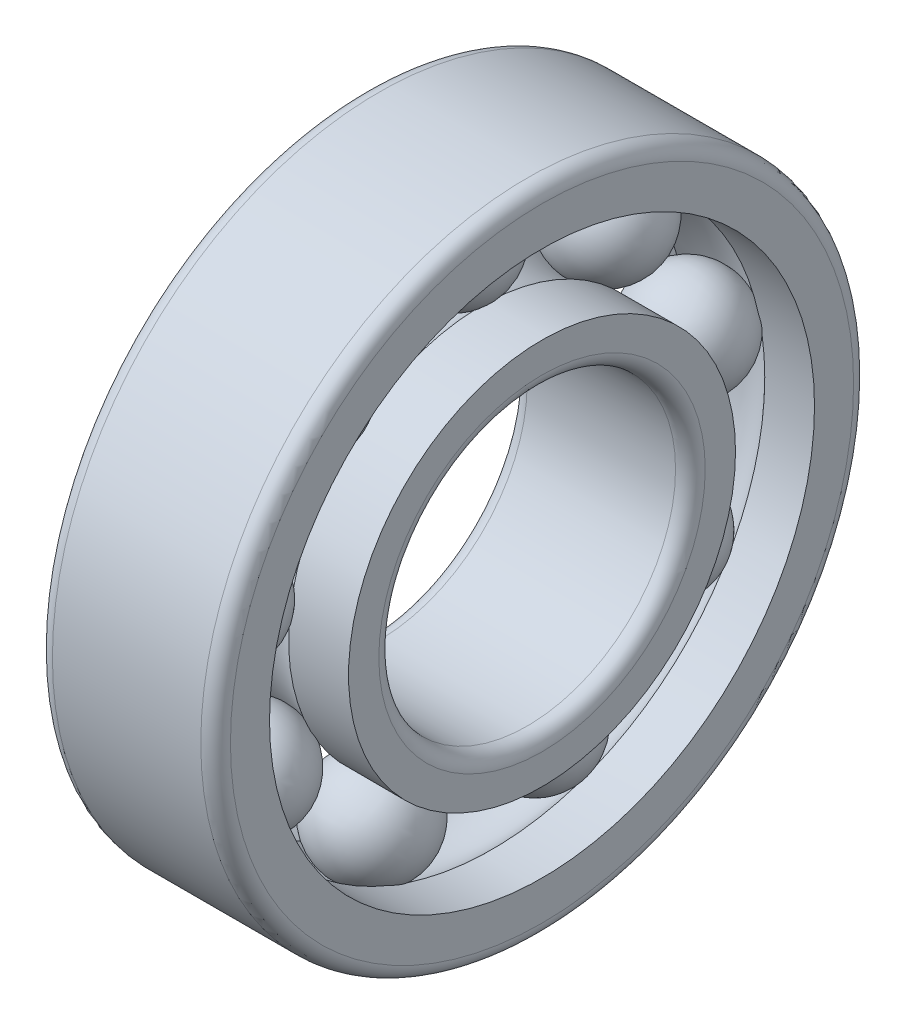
ISO-10303-21;
HEADER;
FILE_DESCRIPTION(('STEP AP214'),'2;1');
FILE_NAME('part.step','',(''),(''),'','','');
FILE_SCHEMA(('AUTOMOTIVE_DESIGN { 1 0 10303 214 1 1 1 1 }'));
ENDSEC;
DATA;
#1=APPLICATION_CONTEXT('core data for automotive mechanical design processes');
#2=APPLICATION_PROTOCOL_DEFINITION('international standard','automotive_design',2000,#1);
#3=PRODUCT_CONTEXT('',#1,'mechanical');
#4=PRODUCT('Part','Part','',(#3));
#5=PRODUCT_RELATED_PRODUCT_CATEGORY('part','',(#4));
#6=PRODUCT_DEFINITION_FORMATION('','',#4);
#7=PRODUCT_DEFINITION_CONTEXT('part definition',#1,'design');
#8=PRODUCT_DEFINITION('design','',#6,#7);
#9=PRODUCT_DEFINITION_SHAPE('','',#8);
#10=(LENGTH_UNIT() NAMED_UNIT(*) SI_UNIT(.MILLI.,.METRE.));
#11=(NAMED_UNIT(*) PLANE_ANGLE_UNIT() SI_UNIT($,.RADIAN.));
#12=(NAMED_UNIT(*) SI_UNIT($,.STERADIAN.) SOLID_ANGLE_UNIT());
#13=UNCERTAINTY_MEASURE_WITH_UNIT(LENGTH_MEASURE(1.E-05),#10,'distance_accuracy_value','');
#14=(GEOMETRIC_REPRESENTATION_CONTEXT(3) GLOBAL_UNCERTAINTY_ASSIGNED_CONTEXT((#13)) GLOBAL_UNIT_ASSIGNED_CONTEXT((#10,
#11,#12)) REPRESENTATION_CONTEXT('',''));
#15=CARTESIAN_POINT('',(0.,0.,0.));
#16=DIRECTION('',(0.,0.,1.));
#17=DIRECTION('',(1.,0.,0.));
#18=AXIS2_PLACEMENT_3D('',#15,#16,#17);
#19=CARTESIAN_POINT('',(5.,0.,0.));
#20=DIRECTION('',(1.,0.,0.));
#21=DIRECTION('',(0.,0.,-1.));
#22=AXIS2_PLACEMENT_3D('',#19,#20,#21);
#23=CYLINDRICAL_SURFACE('',#22,5.);
#24=CARTESIAN_POINT('',(2.5,0.,0.));
#25=DIRECTION('',(1.,0.,0.));
#26=DIRECTION('',(0.,0.,-1.));
#27=AXIS2_PLACEMENT_3D('',#24,#25,#26);
#28=CIRCLE('',#27,5.);
#29=CARTESIAN_POINT('',(2.5,0.,-5.));
#30=VERTEX_POINT('',#29);
#31=EDGE_CURVE('E1072',#30,#30,#28,.F.);
#32=ORIENTED_EDGE('',*,*,#31,.F.);
#33=EDGE_LOOP('',(#32));
#34=FACE_BOUND('',#33,.T.);
#35=CARTESIAN_POINT('',(-2.50000000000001,0.,0.));
#36=DIRECTION('',(1.,0.,0.));
#37=DIRECTION('',(0.,0.,-1.));
#38=AXIS2_PLACEMENT_3D('',#35,#36,#37);
#39=CIRCLE('',#38,5.);
#40=CARTESIAN_POINT('',(-2.50000000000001,0.,-5.));
#41=VERTEX_POINT('',#40);
#42=EDGE_CURVE('E1093',#41,#41,#39,.T.);
#43=ORIENTED_EDGE('',*,*,#42,.F.);
#44=EDGE_LOOP('',(#43));
#45=FACE_BOUND('',#44,.T.);
#46=ADVANCED_FACE('F14',(#34,#45),#23,.F.);
#47=CARTESIAN_POINT('',(-2.5,0.,0.));
#48=DIRECTION('',(1.,0.,0.));
#49=DIRECTION('',(0.,0.,-1.));
#50=AXIS2_PLACEMENT_3D('',#47,#48,#49);
#51=TOROIDAL_SURFACE('',#50,5.50000000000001,0.500000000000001);
#52=ORIENTED_EDGE('',*,*,#42,.T.);
#53=EDGE_LOOP('',(#52));
#54=FACE_BOUND('',#53,.T.);
#55=CARTESIAN_POINT('',(-3.,0.,0.));
#56=DIRECTION('',(-1.,0.,0.));
#57=DIRECTION('',(0.,0.,-1.));
#58=AXIS2_PLACEMENT_3D('',#55,#56,#57);
#59=CIRCLE('',#58,5.50000000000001);
#60=CARTESIAN_POINT('',(-3.00000000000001,0.,5.50000000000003));
#61=VERTEX_POINT('',#60);
#62=CARTESIAN_POINT('',(-3.,0.,-5.50000000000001));
#63=VERTEX_POINT('',#62);
#64=EDGE_CURVE('E558',#61,#63,#59,.F.);
#65=ORIENTED_EDGE('',*,*,#64,.F.);
#66=CARTESIAN_POINT('',(-3.,0.,0.));
#67=DIRECTION('',(-1.,0.,0.));
#68=DIRECTION('',(0.,0.,1.));
#69=AXIS2_PLACEMENT_3D('',#66,#67,#68);
#70=CIRCLE('',#69,5.50000000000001);
#71=EDGE_CURVE('E512',#63,#61,#70,.F.);
#72=ORIENTED_EDGE('',*,*,#71,.F.);
#73=EDGE_LOOP('',(#65,#72));
#74=FACE_BOUND('',#73,.T.);
#75=ADVANCED_FACE('F1032',(#54,#74),#51,.T.);
#76=CARTESIAN_POINT('',(2.5,0.,0.));
#77=DIRECTION('',(1.,0.,0.));
#78=DIRECTION('',(0.,0.,-1.));
#79=AXIS2_PLACEMENT_3D('',#76,#77,#78);
#80=TOROIDAL_SURFACE('',#79,5.50000000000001,0.500000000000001);
#81=CARTESIAN_POINT('',(3.,0.,0.));
#82=DIRECTION('',(1.,0.,0.));
#83=DIRECTION('',(0.,0.,-1.));
#84=AXIS2_PLACEMENT_3D('',#81,#82,#83);
#85=CIRCLE('',#84,5.50000000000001);
#86=CARTESIAN_POINT('',(3.,0.,5.50000000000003));
#87=VERTEX_POINT('',#86);
#88=CARTESIAN_POINT('',(3.,0.,-5.50000000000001));
#89=VERTEX_POINT('',#88);
#90=EDGE_CURVE('E571',#87,#89,#85,.F.);
#91=ORIENTED_EDGE('',*,*,#90,.F.);
#92=CARTESIAN_POINT('',(3.,0.,0.));
#93=DIRECTION('',(1.,0.,0.));
#94=DIRECTION('',(0.,0.,1.));
#95=AXIS2_PLACEMENT_3D('',#92,#93,#94);
#96=CIRCLE('',#95,5.50000000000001);
#97=EDGE_CURVE('E1130',#89,#87,#96,.F.);
#98=ORIENTED_EDGE('',*,*,#97,.F.);
#99=EDGE_LOOP('',(#91,#98));
#100=FACE_BOUND('',#99,.T.);
#101=ORIENTED_EDGE('',*,*,#31,.T.);
#102=EDGE_LOOP('',(#101));
#103=FACE_BOUND('',#102,.T.);
#104=ADVANCED_FACE('F1021',(#100,#103),#80,.T.);
#105=CARTESIAN_POINT('',(0.,0.,0.));
#106=DIRECTION('',(1.,0.,0.));
#107=DIRECTION('',(0.,0.,-1.));
#108=AXIS2_PLACEMENT_3D('',#105,#106,#107);
#109=TOROIDAL_SURFACE('',#108,8.00000000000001,1.77514792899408);
#110=CARTESIAN_POINT('',(-0.981249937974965,0.865581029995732,6.46300465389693));
#111=CARTESIAN_POINT('',(-0.939611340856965,0.86134823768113,6.43570679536));
#112=CARTESIAN_POINT('',(-0.896830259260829,0.857388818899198,6.41016020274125));
#113=CARTESIAN_POINT('',(-0.809235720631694,0.850037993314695,6.36271491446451));
#114=CARTESIAN_POINT('',(-0.764421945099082,0.846646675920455,6.34081679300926));
#115=CARTESIAN_POINT('',(-0.627618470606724,0.837378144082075,6.28095121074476));
#116=CARTESIAN_POINT('',(-0.53300118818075,0.832379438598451,6.24863887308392));
#117=CARTESIAN_POINT('',(-0.365110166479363,0.825868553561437,6.20653968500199));
#118=CARTESIAN_POINT('',(-0.292746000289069,0.823785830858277,6.19306788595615));
#119=CARTESIAN_POINT('',(-0.146939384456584,0.82100517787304,6.17508001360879));
#120=CARTESIAN_POINT('',(-0.0734976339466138,0.820306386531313,6.1705583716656));
#121=CARTESIAN_POINT('',(0.120774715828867,0.820309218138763,6.1705772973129));
#122=CARTESIAN_POINT('',(0.241700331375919,0.82220078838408,6.18281799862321));
#123=CARTESIAN_POINT('',(0.456403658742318,0.828994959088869,6.22675681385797));
#124=CARTESIAN_POINT('',(0.551055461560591,0.833273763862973,6.25442333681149));
#125=CARTESIAN_POINT('',(0.70203787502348,0.842245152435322,6.31238972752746));
#126=CARTESIAN_POINT('',(0.760113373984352,0.846259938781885,6.33832184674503));
#127=CARTESIAN_POINT('',(0.873175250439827,0.855227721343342,6.39621553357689));
#128=CARTESIAN_POINT('',(0.928158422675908,0.860181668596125,6.42818321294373));
#129=CARTESIAN_POINT('',(0.981249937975,0.865581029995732,6.46300465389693));
#130=B_SPLINE_CURVE_WITH_KNOTS('',3,(#110,#111,#112,#113,#114,#115,#116,#117,#118,#119,#120,
#121,#122,#123,#124,#125,#126,#127,#128,#129),.UNSPECIFIED.,.F.,.F.,(4,2,2,2,2,2,2,2,2,4),(0.,
0.149805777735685,0.299635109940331,0.598350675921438,0.818732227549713,1.03897661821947,
1.40089240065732,1.69565719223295,1.8864940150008,2.0775251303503),.UNSPECIFIED.);
#131=CARTESIAN_POINT('',(-0.981249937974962,0.865581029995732,6.46300465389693));
#132=VERTEX_POINT('',#131);
#133=CARTESIAN_POINT('',(0.981249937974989,0.865581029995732,6.46300465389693));
#134=VERTEX_POINT('',#133);
#135=EDGE_CURVE('E1061',#132,#134,#130,.T.);
#136=ORIENTED_EDGE('',*,*,#135,.F.);
#137=CARTESIAN_POINT('',(-0.981249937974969,0.,0.));
#138=DIRECTION('',(1.,0.,0.));
#139=DIRECTION('',(0.,0.,-1.));
#140=AXIS2_PLACEMENT_3D('',#137,#138,#139);
#141=CIRCLE('',#140,6.5207100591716);
#142=CARTESIAN_POINT('',(-0.981249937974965,-3.02385788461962,5.77719163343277));
#143=VERTEX_POINT('',#142);
#144=EDGE_CURVE('E431',#143,#132,#141,.F.);
#145=ORIENTED_EDGE('',*,*,#144,.F.);
#146=CARTESIAN_POINT('',(0.981249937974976,-3.02385788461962,5.77719163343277));
#147=CARTESIAN_POINT('',(0.939611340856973,-3.01054394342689,5.75298773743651));
#148=CARTESIAN_POINT('',(0.896830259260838,-2.9980858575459,5.73033599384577));
#149=CARTESIAN_POINT('',(0.809235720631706,-2.97495109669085,5.68826613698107));
#150=CARTESIAN_POINT('',(0.764421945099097,-2.96427470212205,5.66884853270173));
#151=CARTESIAN_POINT('',(0.627618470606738,-2.93508989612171,5.61576331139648));
#152=CARTESIAN_POINT('',(0.533001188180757,-2.9193411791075,5.58710930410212));
#153=CARTESIAN_POINT('',(0.365110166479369,-2.89882417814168,5.54977586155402));
#154=CARTESIAN_POINT('',(0.292746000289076,-2.8922594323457,5.53782884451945));
#155=CARTESIAN_POINT('',(0.146939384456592,-2.88349425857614,5.52187681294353));
#156=CARTESIAN_POINT('',(0.0734976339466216,-2.88129111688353,5.51786686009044));
#157=CARTESIAN_POINT('',(-0.120774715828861,-2.88130025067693,5.51788367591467));
#158=CARTESIAN_POINT('',(-0.241700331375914,-2.88726431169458,5.52873921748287));
#159=CARTESIAN_POINT('',(-0.456403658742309,-2.90867670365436,5.56770445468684));
#160=CARTESIAN_POINT('',(-0.551055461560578,-2.92215997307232,5.59223904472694));
#161=CARTESIAN_POINT('',(-0.702037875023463,-2.95041599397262,5.64364123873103));
#162=CARTESIAN_POINT('',(-0.760113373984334,-2.96305796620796,5.66663632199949));
#163=CARTESIAN_POINT('',(-0.873175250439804,-2.99128573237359,5.71797143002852));
#164=CARTESIAN_POINT('',(-0.928158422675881,-3.00687451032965,5.74631687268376));
#165=CARTESIAN_POINT('',(-0.981249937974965,-3.02385788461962,5.77719163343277));
#166=B_SPLINE_CURVE_WITH_KNOTS('',3,(#146,#147,#148,#149,#150,#151,#152,#153,#154,#155,#156,
#157,#158,#159,#160,#161,#162,#163,#164,#165),.UNSPECIFIED.,.F.,.F.,(4,2,2,2,2,2,2,2,2,4),(0.,
0.149805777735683,0.299635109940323,0.598350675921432,0.818732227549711,1.03897661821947,
1.40089240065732,1.69565719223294,1.88649401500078,2.07752513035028),.UNSPECIFIED.);
#167=CARTESIAN_POINT('',(0.981249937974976,-3.02385788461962,5.77719163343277));
#168=VERTEX_POINT('',#167);
#169=EDGE_CURVE('E1067',#168,#143,#166,.T.);
#170=ORIENTED_EDGE('',*,*,#169,.F.);
#171=CARTESIAN_POINT('',(0.981249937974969,0.,0.));
#172=DIRECTION('',(1.,0.,0.));
#173=DIRECTION('',(0.,0.,-1.));
#174=AXIS2_PLACEMENT_3D('',#171,#172,#173);
#175=CIRCLE('',#174,6.5207100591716);
#176=EDGE_CURVE('E1169',#134,#168,#175,.T.);
#177=ORIENTED_EDGE('',*,*,#176,.F.);
#178=EDGE_LOOP('',(#136,#145,#170,#177));
#179=FACE_BOUND('',#178,.T.);
#180=ADVANCED_FACE('F1031',(#179),#109,.F.);
#181=CARTESIAN_POINT('',(0.,0.,0.));
#182=DIRECTION('',(1.,0.,0.));
#183=DIRECTION('',(0.,0.,-1.));
#184=AXIS2_PLACEMENT_3D('',#181,#182,#183);
#185=TOROIDAL_SURFACE('',#184,8.00000000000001,1.77514792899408);
#186=CARTESIAN_POINT('',(-0.981249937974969,-3.4912657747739,5.50733356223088));
#187=CARTESIAN_POINT('',(-0.939611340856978,-3.47696155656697,5.48370140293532));
#188=CARTESIAN_POINT('',(-0.896830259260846,-3.46357361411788,5.46158651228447));
#189=CARTESIAN_POINT('',(-0.809235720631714,-3.43870742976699,5.42051629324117));
#190=CARTESIAN_POINT('',(-0.7644219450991,-3.42722948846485,5.4015614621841));
#191=CARTESIAN_POINT('',(-0.627618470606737,-3.39584874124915,5.34974406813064));
#192=CARTESIAN_POINT('',(-0.533001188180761,-3.37890800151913,5.3217782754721));
#193=CARTESIAN_POINT('',(-0.36511016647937,-3.35683479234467,5.28534331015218));
#194=CARTESIAN_POINT('',(-0.292746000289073,-3.34977074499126,5.27368456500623));
#195=CARTESIAN_POINT('',(-0.146939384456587,-3.34033846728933,5.25811768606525));
#196=CARTESIAN_POINT('',(-0.0734976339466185,-3.3379673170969,5.25420473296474));
#197=CARTESIAN_POINT('',(0.120774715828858,-3.33797731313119,5.25422105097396));
#198=CARTESIAN_POINT('',(0.241700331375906,-3.34439645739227,5.2648138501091));
#199=CARTESIAN_POINT('',(0.456403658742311,-3.36743514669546,5.30284014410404));
#200=CARTESIAN_POINT('',(0.551055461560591,-3.38194109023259,5.3267842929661));
#201=CARTESIAN_POINT('',(0.702037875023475,-3.41232868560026,5.37695582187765));
#202=CARTESIAN_POINT('',(0.760113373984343,-3.42592202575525,5.39940163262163));
#203=CARTESIAN_POINT('',(0.873175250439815,-3.45626565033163,5.44951514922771));
#204=CARTESIAN_POINT('',(0.928158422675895,-3.47301913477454,5.47718814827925));
#205=CARTESIAN_POINT('',(0.981249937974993,-3.4912657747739,5.50733356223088));
#206=B_SPLINE_CURVE_WITH_KNOTS('',3,(#186,#187,#188,#189,#190,#191,#192,#193,#194,#195,#196,
#197,#198,#199,#200,#201,#202,#203,#204,#205),.UNSPECIFIED.,.F.,.F.,(4,2,2,2,2,2,2,2,2,4),(0.,
0.149805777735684,0.299635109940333,0.598350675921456,0.818732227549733,1.03897661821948,
1.40089240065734,1.69565719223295,1.88649401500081,2.07752513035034),.UNSPECIFIED.);
#207=CARTESIAN_POINT('',(-0.981249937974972,-3.4912657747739,5.50733356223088));
#208=VERTEX_POINT('',#207);
#209=CARTESIAN_POINT('',(0.981249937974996,-3.4912657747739,5.50733356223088));
#210=VERTEX_POINT('',#209);
#211=EDGE_CURVE('E1050',#208,#210,#206,.T.);
#212=ORIENTED_EDGE('',*,*,#211,.F.);
#213=CARTESIAN_POINT('',(-0.981249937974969,0.,0.));
#214=DIRECTION('',(1.,0.,0.));
#215=DIRECTION('',(0.,0.,-1.));
#216=AXIS2_PLACEMENT_3D('',#213,#214,#215);
#217=CIRCLE('',#216,6.5207100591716);
#218=CARTESIAN_POINT('',(-0.981249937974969,-6.02991673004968,2.48188716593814));
#219=VERTEX_POINT('',#218);
#220=EDGE_CURVE('E432',#219,#208,#217,.F.);
#221=ORIENTED_EDGE('',*,*,#220,.F.);
#222=CARTESIAN_POINT('',(0.981249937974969,-6.02991673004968,2.48188716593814));
#223=CARTESIAN_POINT('',(0.939611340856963,-6.00415969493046,2.47190394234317));
#224=CARTESIAN_POINT('',(0.896830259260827,-5.98005598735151,2.46255960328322));
#225=CARTESIAN_POINT('',(0.809235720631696,-5.9352917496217,2.44520296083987));
#226=CARTESIAN_POINT('',(0.764421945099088,-5.91463176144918,2.43719086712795));
#227=CARTESIAN_POINT('',(0.627618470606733,-5.85815238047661,2.41528486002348));
#228=CARTESIAN_POINT('',(0.533001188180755,-5.82766972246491,2.40345769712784));
#229=CARTESIAN_POINT('',(0.365110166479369,-5.78795531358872,2.3880466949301));
#230=CARTESIAN_POINT('',(0.292746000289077,-5.77524703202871,2.38311448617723));
#231=CARTESIAN_POINT('',(0.146939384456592,-5.75827875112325,2.37652866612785));
#232=CARTESIAN_POINT('',(0.0734976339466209,-5.75401349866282,2.37487301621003));
#233=CARTESIAN_POINT('',(-0.12077471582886,-5.75403130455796,2.37488002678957));
#234=CARTESIAN_POINT('',(-0.241700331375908,-5.76557784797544,2.37936222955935));
#235=CARTESIAN_POINT('',(-0.456403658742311,-5.8070270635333,2.39544771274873));
#236=CARTESIAN_POINT('',(-0.551055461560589,-5.83312637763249,2.40557542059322));
#237=CARTESIAN_POINT('',(-0.702037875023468,-5.88781243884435,2.4267891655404));
#238=CARTESIAN_POINT('',(-0.760113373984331,-5.912277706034,2.43627831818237));
#239=CARTESIAN_POINT('',(-0.873175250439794,-5.96689900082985,2.45745883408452));
#240=CARTESIAN_POINT('',(-0.928158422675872,-5.99706079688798,2.469152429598));
#241=CARTESIAN_POINT('',(-0.981249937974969,-6.02991673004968,2.48188716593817));
#242=B_SPLINE_CURVE_WITH_KNOTS('',3,(#222,#223,#224,#225,#226,#227,#228,#229,#230,#231,#232,
#233,#234,#235,#236,#237,#238,#239,#240,#241),.UNSPECIFIED.,.F.,.F.,(4,2,2,2,2,2,2,2,2,4),(0.,
0.149805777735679,0.299635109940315,0.598350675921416,0.818732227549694,1.03897661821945,
1.40089240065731,1.69565719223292,1.88649401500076,2.07752513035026),.UNSPECIFIED.);
#243=CARTESIAN_POINT('',(0.981249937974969,-6.02991673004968,2.48188716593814));
#244=VERTEX_POINT('',#243);
#245=EDGE_CURVE('E1056',#244,#219,#242,.T.);
#246=ORIENTED_EDGE('',*,*,#245,.F.);
#247=CARTESIAN_POINT('',(0.981249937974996,0.,0.));
#248=DIRECTION('',(1.,0.,0.));
#249=DIRECTION('',(0.,0.,-1.));
#250=AXIS2_PLACEMENT_3D('',#247,#248,#249);
#251=CIRCLE('',#250,6.5207100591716);
#252=EDGE_CURVE('E1167',#210,#244,#251,.T.);
#253=ORIENTED_EDGE('',*,*,#252,.F.);
#254=EDGE_LOOP('',(#212,#221,#246,#253));
#255=FACE_BOUND('',#254,.T.);
#256=ADVANCED_FACE('F1044',(#255),#185,.F.);
#257=CARTESIAN_POINT('',(0.,0.,0.));
#258=DIRECTION('',(1.,0.,0.));
#259=DIRECTION('',(0.,0.,-1.));
#260=AXIS2_PLACEMENT_3D('',#257,#258,#259);
#261=TOROIDAL_SURFACE('',#260,8.00000000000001,1.77514792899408);
#262=CARTESIAN_POINT('',(-0.981249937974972,-6.21451052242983,1.97471988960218));
#263=CARTESIAN_POINT('',(-0.939611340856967,-6.18836239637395,1.96581117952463));
#264=CARTESIAN_POINT('',(-0.896830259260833,-6.16389145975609,1.95747579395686));
#265=CARTESIAN_POINT('',(-0.809235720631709,-6.11844342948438,1.94199785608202));
#266=CARTESIAN_POINT('',(-0.764421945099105,-6.09746688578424,1.93485549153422));
#267=CARTESIAN_POINT('',(-0.627618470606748,-6.04012025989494,1.91533222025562));
#268=CARTESIAN_POINT('',(-0.53300118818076,-6.00916683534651,1.9047984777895));
#269=CARTESIAN_POINT('',(-0.365110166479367,-5.96883783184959,1.89107606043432));
#270=CARTESIAN_POINT('',(-0.292746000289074,-5.95593236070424,1.88668562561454));
#271=CARTESIAN_POINT('',(-0.146939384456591,-5.93870061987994,1.880823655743));
#272=CARTESIAN_POINT('',(-0.07349763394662,-5.93436901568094,1.87935030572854));
#273=CARTESIAN_POINT('',(0.12077471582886,-5.93438716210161,1.87935638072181));
#274=CARTESIAN_POINT('',(0.241700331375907,-5.94611343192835,1.88334478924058));
#275=CARTESIAN_POINT('',(0.456403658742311,-5.98820492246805,1.89766563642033));
#276=CARTESIAN_POINT('',(0.55105546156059,-6.0147081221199,1.90668367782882));
#277=CARTESIAN_POINT('',(0.702037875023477,-6.07023600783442,1.92558452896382));
#278=CARTESIAN_POINT('',(0.760113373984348,-6.09507699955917,1.93404138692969));
#279=CARTESIAN_POINT('',(0.873175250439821,-6.1505339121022,1.95292606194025));
#280=CARTESIAN_POINT('',(0.928158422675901,-6.18115568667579,1.96335587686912));
#281=CARTESIAN_POINT('',(0.981249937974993,-6.21451052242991,1.97471988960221));
#282=B_SPLINE_CURVE_WITH_KNOTS('',3,(#262,#263,#264,#265,#266,#267,#268,#269,#270,#271,#272,
#273,#274,#275,#276,#277,#278,#279,#280,#281),.UNSPECIFIED.,.F.,.F.,(4,2,2,2,2,2,2,2,2,4),(0.,
0.149805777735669,0.299635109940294,0.59835067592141,0.818732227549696,1.03897661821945,
1.40089240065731,1.69565719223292,1.88649401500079,2.07752513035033),.UNSPECIFIED.);
#283=CARTESIAN_POINT('',(-0.981249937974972,-6.21451052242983,1.97471988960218));
#284=VERTEX_POINT('',#283);
#285=CARTESIAN_POINT('',(0.981249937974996,-6.21451052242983,1.97471988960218));
#286=VERTEX_POINT('',#285);
#287=EDGE_CURVE('E283',#284,#286,#282,.T.);
#288=ORIENTED_EDGE('',*,*,#287,.F.);
#289=CARTESIAN_POINT('',(-0.981249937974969,0.,0.));
#290=DIRECTION('',(1.,0.,0.));
#291=DIRECTION('',(0.,0.,-1.));
#292=AXIS2_PLACEMENT_3D('',#289,#290,#291);
#293=CIRCLE('',#292,6.5207100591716);
#294=CARTESIAN_POINT('',(-0.981249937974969,-6.21451052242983,-1.97471988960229));
#295=VERTEX_POINT('',#294);
#296=EDGE_CURVE('E292',#295,#284,#293,.F.);
#297=ORIENTED_EDGE('',*,*,#296,.F.);
#298=CARTESIAN_POINT('',(0.981249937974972,-6.21451052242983,-1.97471988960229));
#299=CARTESIAN_POINT('',(0.939611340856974,-6.18836239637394,-1.96581117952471));
#300=CARTESIAN_POINT('',(0.89683025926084,-6.16389145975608,-1.95747579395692));
#301=CARTESIAN_POINT('',(0.809235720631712,-6.11844342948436,-1.94199785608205));
#302=CARTESIAN_POINT('',(0.764421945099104,-6.09746688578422,-1.93485549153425));
#303=CARTESIAN_POINT('',(0.627618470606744,-6.04012025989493,-1.91533222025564));
#304=CARTESIAN_POINT('',(0.533001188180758,-6.00916683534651,-1.9047984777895));
#305=CARTESIAN_POINT('',(0.365110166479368,-5.96883783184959,-1.89107606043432));
#306=CARTESIAN_POINT('',(0.292746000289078,-5.95593236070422,-1.88668562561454));
#307=CARTESIAN_POINT('',(0.146939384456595,-5.93870061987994,-1.88082365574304));
#308=CARTESIAN_POINT('',(0.073497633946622,-5.93436901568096,-1.87935030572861));
#309=CARTESIAN_POINT('',(-0.120774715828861,-5.93438716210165,-1.87935638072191));
#310=CARTESIAN_POINT('',(-0.241700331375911,-5.94611343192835,-1.88334478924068));
#311=CARTESIAN_POINT('',(-0.45640365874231,-5.98820492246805,-1.8976656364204));
#312=CARTESIAN_POINT('',(-0.551055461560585,-6.01470812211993,-1.90668367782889));
#313=CARTESIAN_POINT('',(-0.70203787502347,-6.07023600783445,-1.92558452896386));
#314=CARTESIAN_POINT('',(-0.76011337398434,-6.09507699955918,-1.93404138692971));
#315=CARTESIAN_POINT('',(-0.873175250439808,-6.15053391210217,-1.95292606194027));
#316=CARTESIAN_POINT('',(-0.928158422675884,-6.18115568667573,-1.96335587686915));
#317=CARTESIAN_POINT('',(-0.981249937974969,-6.21451052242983,-1.97471988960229));
#318=B_SPLINE_CURVE_WITH_KNOTS('',3,(#298,#299,#300,#301,#302,#303,#304,#305,#306,#307,#308,
#309,#310,#311,#312,#313,#314,#315,#316,#317),.UNSPECIFIED.,.F.,.F.,(4,2,2,2,2,2,2,2,2,4),(0.,
0.149805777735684,0.299635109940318,0.598350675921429,0.81873222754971,1.03897661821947,
1.40089240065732,1.69565719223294,1.88649401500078,2.07752513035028),.UNSPECIFIED.);
#319=CARTESIAN_POINT('',(0.981249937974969,-6.21451052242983,-1.97471988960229));
#320=VERTEX_POINT('',#319);
#321=EDGE_CURVE('E1153',#320,#295,#318,.T.);
#322=ORIENTED_EDGE('',*,*,#321,.F.);
#323=CARTESIAN_POINT('',(0.981249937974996,0.,0.));
#324=DIRECTION('',(1.,0.,0.));
#325=DIRECTION('',(0.,0.,-1.));
#326=AXIS2_PLACEMENT_3D('',#323,#324,#325);
#327=CIRCLE('',#326,6.5207100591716);
#328=EDGE_CURVE('E1165',#286,#320,#327,.T.);
#329=ORIENTED_EDGE('',*,*,#328,.F.);
#330=EDGE_LOOP('',(#288,#297,#322,#329));
#331=FACE_BOUND('',#330,.T.);
#332=ADVANCED_FACE('F534',(#331),#261,.F.);
#333=CARTESIAN_POINT('',(0.,0.,0.));
#334=DIRECTION('',(1.,0.,0.));
#335=DIRECTION('',(0.,0.,-1.));
#336=AXIS2_PLACEMENT_3D('',#333,#334,#335);
#337=TOROIDAL_SURFACE('',#336,8.00000000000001,1.77514792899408);
#338=CARTESIAN_POINT('',(-0.981249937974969,-6.02991673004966,-2.48188716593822));
#339=CARTESIAN_POINT('',(-0.939611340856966,-6.00415969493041,-2.47190394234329));
#340=CARTESIAN_POINT('',(-0.896830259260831,-5.98005598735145,-2.46255960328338));
#341=CARTESIAN_POINT('',(-0.809235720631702,-5.93529174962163,-2.44520296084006));
#342=CARTESIAN_POINT('',(-0.764421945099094,-5.91463176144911,-2.43719086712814));
#343=CARTESIAN_POINT('',(-0.627618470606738,-5.85815238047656,-2.41528486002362));
#344=CARTESIAN_POINT('',(-0.533001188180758,-5.82766972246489,-2.40345769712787));
#345=CARTESIAN_POINT('',(-0.365110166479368,-5.78795531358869,-2.38804669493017));
#346=CARTESIAN_POINT('',(-0.292746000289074,-5.77524703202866,-2.3831144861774));
#347=CARTESIAN_POINT('',(-0.14693938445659,-5.75827875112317,-2.37652866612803));
#348=CARTESIAN_POINT('',(-0.0734976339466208,-5.75401349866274,-2.37487301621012));
#349=CARTESIAN_POINT('',(0.120774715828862,-5.75403130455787,-2.37488002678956));
#350=CARTESIAN_POINT('',(0.241700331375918,-5.76557784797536,-2.37936222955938));
#351=CARTESIAN_POINT('',(0.456403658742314,-5.80702706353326,-2.39544771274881));
#352=CARTESIAN_POINT('',(0.551055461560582,-5.8331263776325,-2.40557542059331));
#353=CARTESIAN_POINT('',(0.702037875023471,-5.88781243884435,-2.42678916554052));
#354=CARTESIAN_POINT('',(0.760113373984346,-5.91227770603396,-2.43627831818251));
#355=CARTESIAN_POINT('',(0.873175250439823,-5.96689900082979,-2.45745883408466));
#356=CARTESIAN_POINT('',(0.928158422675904,-5.99706079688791,-2.46915242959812));
#357=CARTESIAN_POINT('',(0.981249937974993,-6.02991673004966,-2.48188716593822));
#358=B_SPLINE_CURVE_WITH_KNOTS('',3,(#338,#339,#340,#341,#342,#343,#344,#345,#346,#347,#348,
#349,#350,#351,#352,#353,#354,#355,#356,#357),.UNSPECIFIED.,.F.,.F.,(4,2,2,2,2,2,2,2,2,4),(0.,
0.149805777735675,0.29963510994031,0.598350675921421,0.818732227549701,1.03897661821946,
1.40089240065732,1.69565719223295,1.88649401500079,2.07752513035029),.UNSPECIFIED.);
#359=CARTESIAN_POINT('',(-0.981249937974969,-6.02991673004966,-2.48188716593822));
#360=VERTEX_POINT('',#359);
#361=CARTESIAN_POINT('',(0.981249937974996,-6.02991673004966,-2.48188716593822));
#362=VERTEX_POINT('',#361);
#363=EDGE_CURVE('E282',#360,#362,#358,.T.);
#364=ORIENTED_EDGE('',*,*,#363,.F.);
#365=CARTESIAN_POINT('',(-0.981249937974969,0.,0.));
#366=DIRECTION('',(1.,0.,0.));
#367=DIRECTION('',(0.,0.,-1.));
#368=AXIS2_PLACEMENT_3D('',#365,#366,#367);
#369=CIRCLE('',#368,6.5207100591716);
#370=CARTESIAN_POINT('',(-0.981249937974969,-3.49126577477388,-5.50733356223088));
#371=VERTEX_POINT('',#370);
#372=EDGE_CURVE('E286',#371,#360,#369,.F.);
#373=ORIENTED_EDGE('',*,*,#372,.F.);
#374=CARTESIAN_POINT('',(0.981249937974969,-3.49126577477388,-5.50733356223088));
#375=CARTESIAN_POINT('',(0.939611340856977,-3.47696155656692,-5.48370140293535));
#376=CARTESIAN_POINT('',(0.896830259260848,-3.46357361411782,-5.46158651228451));
#377=CARTESIAN_POINT('',(0.809235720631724,-3.43870742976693,-5.42051629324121));
#378=CARTESIAN_POINT('',(0.764421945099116,-3.4272294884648,-5.40156146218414));
#379=CARTESIAN_POINT('',(0.627618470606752,-3.39584874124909,-5.34974406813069));
#380=CARTESIAN_POINT('',(0.533001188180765,-3.37890800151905,-5.32177827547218));
#381=CARTESIAN_POINT('',(0.365110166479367,-3.35683479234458,-5.28534331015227));
#382=CARTESIAN_POINT('',(0.29274600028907,-3.3497707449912,-5.27368456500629));
#383=CARTESIAN_POINT('',(0.146939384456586,-3.34033846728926,-5.25811768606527));
#384=CARTESIAN_POINT('',(0.0734976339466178,-3.33796731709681,-5.25420473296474));
#385=CARTESIAN_POINT('',(-0.120774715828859,-3.33797731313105,-5.25422105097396));
#386=CARTESIAN_POINT('',(-0.241700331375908,-3.34439645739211,-5.26481385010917));
#387=CARTESIAN_POINT('',(-0.456403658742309,-3.36743514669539,-5.30284014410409));
#388=CARTESIAN_POINT('',(-0.551055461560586,-3.38194109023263,-5.32678429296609));
#389=CARTESIAN_POINT('',(-0.702037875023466,-3.41232868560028,-5.37695582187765));
#390=CARTESIAN_POINT('',(-0.760113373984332,-3.42592202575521,-5.39940163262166));
#391=CARTESIAN_POINT('',(-0.873175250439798,-3.45626565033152,-5.44951514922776));
#392=CARTESIAN_POINT('',(-0.928158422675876,-3.47301913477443,-5.47718814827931));
#393=CARTESIAN_POINT('',(-0.981249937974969,-3.49126577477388,-5.50733356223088));
#394=B_SPLINE_CURVE_WITH_KNOTS('',3,(#374,#375,#376,#377,#378,#379,#380,#381,#382,#383,#384,
#385,#386,#387,#388,#389,#390,#391,#392,#393),.UNSPECIFIED.,.F.,.F.,(4,2,2,2,2,2,2,2,2,4),(0.,
0.149805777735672,0.299635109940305,0.598350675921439,0.818732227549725,1.03897661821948,
1.40089240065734,1.69565719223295,1.8864940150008,2.07752513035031),.UNSPECIFIED.);
#395=CARTESIAN_POINT('',(0.981249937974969,-3.49126577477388,-5.50733356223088));
#396=VERTEX_POINT('',#395);
#397=EDGE_CURVE('E271',#396,#371,#394,.T.);
#398=ORIENTED_EDGE('',*,*,#397,.F.);
#399=CARTESIAN_POINT('',(0.981249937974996,0.,0.));
#400=DIRECTION('',(1.,0.,0.));
#401=DIRECTION('',(0.,0.,-1.));
#402=AXIS2_PLACEMENT_3D('',#399,#400,#401);
#403=CIRCLE('',#402,6.5207100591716);
#404=EDGE_CURVE('E425',#362,#396,#403,.T.);
#405=ORIENTED_EDGE('',*,*,#404,.F.);
#406=EDGE_LOOP('',(#364,#373,#398,#405));
#407=FACE_BOUND('',#406,.T.);
#408=ADVANCED_FACE('F287',(#407),#337,.F.);
#409=CARTESIAN_POINT('',(-3.,5.50000000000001,0.));
#410=DIRECTION('',(-1.,0.,0.));
#411=DIRECTION('',(0.,0.,1.));
#412=AXIS2_PLACEMENT_3D('',#409,#410,#411);
#413=PLANE('',#412);
#414=CARTESIAN_POINT('',(-3.00000000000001,0.,0.));
#415=DIRECTION('',(1.,0.,0.));
#416=DIRECTION('',(0.,0.,-1.));
#417=AXIS2_PLACEMENT_3D('',#414,#415,#416);
#418=CIRCLE('',#417,6.5207100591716);
#419=CARTESIAN_POINT('',(-3.00000000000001,0.,-6.5207100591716));
#420=VERTEX_POINT('',#419);
#421=EDGE_CURVE('E422',#420,#420,#418,.T.);
#422=ORIENTED_EDGE('',*,*,#421,.F.);
#423=EDGE_LOOP('',(#422));
#424=FACE_BOUND('',#423,.T.);
#425=ORIENTED_EDGE('',*,*,#71,.T.);
#426=ORIENTED_EDGE('',*,*,#64,.T.);
#427=EDGE_LOOP('',(#425,#426));
#428=FACE_BOUND('',#427,.T.);
#429=ADVANCED_FACE('F533',(#424,#428),#413,.T.);
#430=CARTESIAN_POINT('',(3.,6.52071005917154,0.));
#431=DIRECTION('',(1.,0.,0.));
#432=DIRECTION('',(0.,0.,-1.));
#433=AXIS2_PLACEMENT_3D('',#430,#431,#432);
#434=PLANE('',#433);
#435=ORIENTED_EDGE('',*,*,#90,.T.);
#436=ORIENTED_EDGE('',*,*,#97,.T.);
#437=EDGE_LOOP('',(#435,#436));
#438=FACE_BOUND('',#437,.T.);
#439=CARTESIAN_POINT('',(3.,0.,0.));
#440=DIRECTION('',(1.,0.,0.));
#441=DIRECTION('',(0.,0.,-1.));
#442=AXIS2_PLACEMENT_3D('',#439,#440,#441);
#443=CIRCLE('',#442,6.5207100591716);
#444=CARTESIAN_POINT('',(3.,0.,-6.5207100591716));
#445=VERTEX_POINT('',#444);
#446=EDGE_CURVE('E458',#445,#445,#443,.F.);
#447=ORIENTED_EDGE('',*,*,#446,.F.);
#448=EDGE_LOOP('',(#447));
#449=FACE_BOUND('',#448,.T.);
#450=ADVANCED_FACE('F576',(#438,#449),#434,.T.);
#451=CARTESIAN_POINT('',(0.,0.,0.));
#452=DIRECTION('',(1.,0.,0.));
#453=DIRECTION('',(0.,0.,-1.));
#454=AXIS2_PLACEMENT_3D('',#451,#452,#453);
#455=TOROIDAL_SURFACE('',#454,8.00000000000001,1.77514792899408);
#456=CARTESIAN_POINT('',(-0.981249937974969,1.39709767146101,-6.36928392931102));
#457=CARTESIAN_POINT('',(-0.939611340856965,1.39173877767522,-6.34218463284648));
#458=CARTESIAN_POINT('',(-0.896830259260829,1.38672196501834,-6.31682448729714));
#459=CARTESIAN_POINT('',(-0.809235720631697,1.37740223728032,-6.26972636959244));
#460=CARTESIAN_POINT('',(-0.764421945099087,1.37309943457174,-6.24798896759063));
#461=CARTESIAN_POINT('',(-0.627618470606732,1.36133377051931,-6.18856369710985));
#462=CARTESIAN_POINT('',(-0.533001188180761,1.35497954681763,-6.15649037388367));
#463=CARTESIAN_POINT('',(-0.365110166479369,1.3466990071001,-6.11470322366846));
#464=CARTESIAN_POINT('',(-0.292746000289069,1.34404849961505,-6.10133154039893));
#465=CARTESIAN_POINT('',(-0.146939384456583,1.34050924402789,-6.08347743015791));
#466=CARTESIAN_POINT('',(-0.0734976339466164,1.33961940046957,-6.07898947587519));
#467=CARTESIAN_POINT('',(0.120774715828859,1.33962321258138,-6.07900822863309));
#468=CARTESIAN_POINT('',(0.241700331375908,1.3420322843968,-6.09115768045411));
#469=CARTESIAN_POINT('',(0.456403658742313,1.35067581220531,-6.13477040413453));
#470=CARTESIAN_POINT('',(0.551055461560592,1.35611755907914,-6.16223186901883));
#471=CARTESIAN_POINT('',(0.702037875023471,1.36751288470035,-6.21977085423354));
#472=CARTESIAN_POINT('',(0.760113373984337,1.37260952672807,-6.2455122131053));
#473=CARTESIAN_POINT('',(0.873175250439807,1.38398337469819,-6.30298164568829));
#474=CARTESIAN_POINT('',(0.928158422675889,1.39026177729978,-6.3347157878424));
#475=CARTESIAN_POINT('',(0.981249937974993,1.39709767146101,-6.36928392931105));
#476=B_SPLINE_CURVE_WITH_KNOTS('',3,(#456,#457,#458,#459,#460,#461,#462,#463,#464,#465,#466,
#467,#468,#469,#470,#471,#472,#473,#474,#475),.UNSPECIFIED.,.F.,.F.,(4,2,2,2,2,2,2,2,2,4),(0.,
0.149805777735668,0.299635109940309,0.598350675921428,0.818732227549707,1.03897661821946,
1.40089240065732,1.69565719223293,1.88649401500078,2.0775251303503),.UNSPECIFIED.);
#477=CARTESIAN_POINT('',(-0.981249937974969,1.39709767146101,-6.36928392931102));
#478=VERTEX_POINT('',#477);
#479=CARTESIAN_POINT('',(0.981249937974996,1.39709767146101,-6.36928392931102));
#480=VERTEX_POINT('',#479);
#481=EDGE_CURVE('E618',#478,#480,#476,.T.);
#482=ORIENTED_EDGE('',*,*,#481,.F.);
#483=CARTESIAN_POINT('',(-0.981249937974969,0.,0.));
#484=DIRECTION('',(1.,0.,0.));
#485=DIRECTION('',(0.,0.,-1.));
#486=AXIS2_PLACEMENT_3D('',#483,#484,#485);
#487=CIRCLE('',#486,6.5207100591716);
#488=CARTESIAN_POINT('',(-0.981249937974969,4.8174128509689,-4.39456403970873));
#489=VERTEX_POINT('',#488);
#490=EDGE_CURVE('E478',#489,#478,#487,.F.);
#491=ORIENTED_EDGE('',*,*,#490,.F.);
#492=CARTESIAN_POINT('',(0.981249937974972,4.8174128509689,-4.39456403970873));
#493=CARTESIAN_POINT('',(0.939611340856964,4.79662361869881,-4.37637345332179));
#494=CARTESIAN_POINT('',(0.896830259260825,4.77716949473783,-4.35934869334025));
#495=CARTESIAN_POINT('',(0.809235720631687,4.74104119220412,-4.32772851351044));
#496=CARTESIAN_POINT('',(0.764421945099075,4.72436745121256,-4.31313347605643));
#497=CARTESIAN_POINT('',(0.627618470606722,4.6787864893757,-4.27323147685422));
#498=CARTESIAN_POINT('',(0.533001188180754,4.65418728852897,-4.25169189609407));
#499=CARTESIAN_POINT('',(0.365110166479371,4.62213882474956,-4.22362716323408));
#500=CARTESIAN_POINT('',(0.292746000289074,4.61188386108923,-4.21464591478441));
#501=CARTESIAN_POINT('',(0.14693938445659,4.59819137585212,-4.20265377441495));
#502=CARTESIAN_POINT('',(0.0734976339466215,4.59474961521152,-4.19963917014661));
#503=CARTESIAN_POINT('',(-0.120774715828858,4.59476394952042,-4.19965184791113));
#504=CARTESIAN_POINT('',(-0.241700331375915,4.6040811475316,-4.20781289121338));
#505=CARTESIAN_POINT('',(-0.456403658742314,4.63752911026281,-4.23710476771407));
#506=CARTESIAN_POINT('',(-0.551055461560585,4.65859056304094,-4.2555481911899));
#507=CARTESIAN_POINT('',(-0.702037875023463,4.70272312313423,-4.2941863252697));
#508=CARTESIAN_POINT('',(-0.760113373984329,4.72246747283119,-4.31147082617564));
#509=CARTESIAN_POINT('',(-0.873175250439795,4.76655053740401,-4.35005558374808));
#510=CARTESIAN_POINT('',(-0.928158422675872,4.79089390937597,-4.3713599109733));
#511=CARTESIAN_POINT('',(-0.981249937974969,4.8174128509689,-4.39456403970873));
#512=B_SPLINE_CURVE_WITH_KNOTS('',3,(#492,#493,#494,#495,#496,#497,#498,#499,#500,#501,#502,
#503,#504,#505,#506,#507,#508,#509,#510,#511),.UNSPECIFIED.,.F.,.F.,(4,2,2,2,2,2,2,2,2,4),(0.,
0.149805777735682,0.29963510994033,0.598350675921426,0.818732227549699,1.03897661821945,
1.40089240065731,1.69565719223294,1.88649401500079,2.07752513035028),.UNSPECIFIED.);
#513=CARTESIAN_POINT('',(0.981249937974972,4.8174128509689,-4.39456403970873));
#514=VERTEX_POINT('',#513);
#515=EDGE_CURVE('E513',#514,#489,#512,.T.);
#516=ORIENTED_EDGE('',*,*,#515,.F.);
#517=CARTESIAN_POINT('',(0.981249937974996,0.,0.));
#518=DIRECTION('',(1.,0.,0.));
#519=DIRECTION('',(0.,0.,-1.));
#520=AXIS2_PLACEMENT_3D('',#517,#518,#519);
#521=CIRCLE('',#520,6.5207100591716);
#522=EDGE_CURVE('E457',#480,#514,#521,.T.);
#523=ORIENTED_EDGE('',*,*,#522,.F.);
#524=EDGE_LOOP('',(#482,#491,#516,#523));
#525=FACE_BOUND('',#524,.T.);
#526=ADVANCED_FACE('F584',(#525),#455,.F.);
#527=CARTESIAN_POINT('',(0.,0.,0.));
#528=DIRECTION('',(1.,0.,0.));
#529=DIRECTION('',(0.,0.,-1.));
#530=AXIS2_PLACEMENT_3D('',#527,#528,#529);
#531=TOROIDAL_SURFACE('',#530,8.00000000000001,1.77514792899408);
#532=CARTESIAN_POINT('',(-0.981249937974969,5.16433570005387,-3.98111748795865));
#533=CARTESIAN_POINT('',(-0.939611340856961,5.14281145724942,-3.96380285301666));
#534=CARTESIAN_POINT('',(-0.896830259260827,5.1226671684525,-3.94760059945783));
#535=CARTESIAN_POINT('',(-0.809235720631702,5.08525375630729,-3.91751195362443));
#536=CARTESIAN_POINT('',(-0.764421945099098,5.067985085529,-3.9036259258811));
#537=CARTESIAN_POINT('',(-0.627618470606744,5.02077423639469,-3.86566635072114));
#538=CARTESIAN_POINT('',(-0.533001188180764,4.99529028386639,-3.84518117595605));
#539=CARTESIAN_POINT('',(-0.365110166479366,4.96208676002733,-3.81849299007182));
#540=CARTESIAN_POINT('',(-0.292746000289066,4.9514612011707,-3.80995339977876));
#541=CARTESIAN_POINT('',(-0.146939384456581,4.93727357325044,-3.79855134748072));
#542=CARTESIAN_POINT('',(-0.0734976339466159,4.93370711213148,-3.79568535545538));
#543=CARTESIAN_POINT('',(0.120774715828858,4.93372208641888,-3.7956972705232));
#544=CARTESIAN_POINT('',(0.241700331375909,4.94337705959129,-3.80345576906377));
#545=CARTESIAN_POINT('',(0.456403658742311,4.97803210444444,-3.83130910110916));
#546=CARTESIAN_POINT('',(0.551055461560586,4.99985261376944,-3.84884791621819));
#547=CARTESIAN_POINT('',(0.702037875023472,5.04556728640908,-3.88560056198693));
#548=CARTESIAN_POINT('',(0.760113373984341,5.06601776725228,-3.9020435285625));
#549=CARTESIAN_POINT('',(0.873175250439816,5.11167127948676,-3.93875669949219));
#550=CARTESIAN_POINT('',(0.928158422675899,5.13687912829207,-3.95903078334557));
#551=CARTESIAN_POINT('',(0.981249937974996,5.16433570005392,-3.98111748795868));
#552=B_SPLINE_CURVE_WITH_KNOTS('',3,(#532,#533,#534,#535,#536,#537,#538,#539,#540,#541,#542,
#543,#544,#545,#546,#547,#548,#549,#550,#551),.UNSPECIFIED.,.F.,.F.,(4,2,2,2,2,2,2,2,2,4),(0.,
0.149805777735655,0.299635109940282,0.598350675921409,0.818732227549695,1.03897661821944,
1.40089240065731,1.69565719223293,1.88649401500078,2.0775251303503),.UNSPECIFIED.);
#553=CARTESIAN_POINT('',(-0.981249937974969,5.16433570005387,-3.98111748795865));
#554=VERTEX_POINT('',#553);
#555=CARTESIAN_POINT('',(0.981249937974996,5.16433570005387,-3.98111748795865));
#556=VERTEX_POINT('',#555);
#557=EDGE_CURVE('E609',#554,#556,#552,.T.);
#558=ORIENTED_EDGE('',*,*,#557,.F.);
#559=CARTESIAN_POINT('',(-0.981249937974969,0.,0.));
#560=DIRECTION('',(1.,0.,0.));
#561=DIRECTION('',(0.,0.,-1.));
#562=AXIS2_PLACEMENT_3D('',#559,#560,#561);
#563=CIRCLE('',#562,6.5207100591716);
#564=CARTESIAN_POINT('',(-0.981249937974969,6.51512365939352,-0.269858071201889));
#565=VERTEX_POINT('',#564);
#566=EDGE_CURVE('E474',#565,#554,#563,.F.);
#567=ORIENTED_EDGE('',*,*,#566,.F.);
#568=CARTESIAN_POINT('',(0.981249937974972,6.51512365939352,-0.269858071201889));
#569=CARTESIAN_POINT('',(0.939611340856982,6.48750549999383,-0.269286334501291));
#570=CARTESIAN_POINT('',(0.896830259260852,6.46165947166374,-0.268749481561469));
#571=CARTESIAN_POINT('',(0.809235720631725,6.4136585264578,-0.267749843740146));
#572=CARTESIAN_POINT('',(0.764421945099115,6.39150419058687,-0.267287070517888));
#573=CARTESIAN_POINT('',(0.62761847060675,6.33093863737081,-0.266019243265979));
#574=CARTESIAN_POINT('',(0.533001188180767,6.29824918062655,-0.265331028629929));
#575=CARTESIAN_POINT('',(0.365110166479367,6.25565897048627,-0.264432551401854));
#576=CARTESIAN_POINT('',(0.292746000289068,6.24203017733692,-0.264144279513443));
#577=CARTESIAN_POINT('',(0.146939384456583,6.2238327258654,-0.263759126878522));
#578=CARTESIAN_POINT('',(0.073497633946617,6.21925843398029,-0.263662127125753));
#579=CARTESIAN_POINT('',(-0.120774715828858,6.21927756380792,-0.263662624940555));
#580=CARTESIAN_POINT('',(-0.241700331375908,6.23166076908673,-0.263925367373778));
#581=CARTESIAN_POINT('',(-0.45640365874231,6.27611185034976,-0.264864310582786));
#582=CARTESIAN_POINT('',(-0.551055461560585,6.30410106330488,-0.265454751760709));
#583=CARTESIAN_POINT('',(-0.702037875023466,6.36274467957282,-0.266685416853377));
#584=CARTESIAN_POINT('',(-0.760113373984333,6.38897999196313,-0.267234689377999));
#585=CARTESIAN_POINT('',(-0.8731752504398,6.44755138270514,-0.268456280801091));
#586=CARTESIAN_POINT('',(-0.928158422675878,6.47989364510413,-0.269128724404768));
#587=CARTESIAN_POINT('',(-0.981249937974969,6.51512365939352,-0.269858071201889));
#588=B_SPLINE_CURVE_WITH_KNOTS('',3,(#568,#569,#570,#571,#572,#573,#574,#575,#576,#577,#578,
#579,#580,#581,#582,#583,#584,#585,#586,#587),.UNSPECIFIED.,.F.,.F.,(4,2,2,2,2,2,2,2,2,4),(0.,
0.149805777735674,0.299635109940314,0.598350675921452,0.818732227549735,1.03897661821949,
1.40089240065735,1.69565719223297,1.88649401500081,2.07752513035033),.UNSPECIFIED.);
#589=CARTESIAN_POINT('',(0.981249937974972,6.51512365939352,-0.269858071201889));
#590=VERTEX_POINT('',#589);
#591=EDGE_CURVE('E614',#590,#565,#588,.T.);
#592=ORIENTED_EDGE('',*,*,#591,.F.);
#593=CARTESIAN_POINT('',(0.981249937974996,0.,0.));
#594=DIRECTION('',(1.,0.,0.));
#595=DIRECTION('',(0.,0.,-1.));
#596=AXIS2_PLACEMENT_3D('',#593,#594,#595);
#597=CIRCLE('',#596,6.5207100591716);
#598=EDGE_CURVE('E461',#556,#590,#597,.T.);
#599=ORIENTED_EDGE('',*,*,#598,.F.);
#600=EDGE_LOOP('',(#558,#567,#592,#599));
#601=FACE_BOUND('',#600,.T.);
#602=ADVANCED_FACE('F601',(#601),#531,.F.);
#603=CARTESIAN_POINT('',(0.,0.,0.));
#604=DIRECTION('',(1.,0.,0.));
#605=DIRECTION('',(0.,0.,-1.));
#606=AXIS2_PLACEMENT_3D('',#603,#604,#605);
#607=TOROIDAL_SURFACE('',#606,8.00000000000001,1.77514792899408);
#608=CARTESIAN_POINT('',(-0.981249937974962,6.51512365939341,0.269858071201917));
#609=CARTESIAN_POINT('',(-0.939611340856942,6.48750549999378,0.269286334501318));
#610=CARTESIAN_POINT('',(-0.896830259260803,6.46165947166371,0.26874948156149));
#611=CARTESIAN_POINT('',(-0.809235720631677,6.41365852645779,0.267749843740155));
#612=CARTESIAN_POINT('',(-0.764421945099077,6.39150419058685,0.267287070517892));
#613=CARTESIAN_POINT('',(-0.627618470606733,6.33093863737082,0.266019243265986));
#614=CARTESIAN_POINT('',(-0.533001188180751,6.29824918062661,0.265331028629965));
#615=CARTESIAN_POINT('',(-0.365110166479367,6.25565897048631,0.264432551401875));
#616=CARTESIAN_POINT('',(-0.292746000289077,6.24203017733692,0.264144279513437));
#617=CARTESIAN_POINT('',(-0.146939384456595,6.2238327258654,0.263759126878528));
#618=CARTESIAN_POINT('',(-0.0734976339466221,6.21925843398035,0.263662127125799));
#619=CARTESIAN_POINT('',(0.120774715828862,6.21927756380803,0.263662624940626));
#620=CARTESIAN_POINT('',(0.241700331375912,6.23166076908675,0.263925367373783));
#621=CARTESIAN_POINT('',(0.456403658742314,6.27611185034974,0.264864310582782));
#622=CARTESIAN_POINT('',(0.55105546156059,6.30410106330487,0.265454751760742));
#623=CARTESIAN_POINT('',(0.702037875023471,6.36274467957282,0.266685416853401));
#624=CARTESIAN_POINT('',(0.760113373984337,6.38897999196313,0.267234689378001));
#625=CARTESIAN_POINT('',(0.873175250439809,6.44755138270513,0.268456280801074));
#626=CARTESIAN_POINT('',(0.928158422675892,6.47989364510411,0.269128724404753));
#627=CARTESIAN_POINT('',(0.981249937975,6.51512365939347,0.269858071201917));
#628=B_SPLINE_CURVE_WITH_KNOTS('',3,(#608,#609,#610,#611,#612,#613,#614,#615,#616,#617,#618,
#619,#620,#621,#622,#623,#624,#625,#626,#627),.UNSPECIFIED.,.F.,.F.,(4,2,2,2,2,2,2,2,2,4),(0.,
0.149805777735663,0.29963510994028,0.598350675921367,0.818732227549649,1.03897661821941,
1.40089240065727,1.69565719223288,1.88649401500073,2.07752513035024),.UNSPECIFIED.);
#629=CARTESIAN_POINT('',(-0.981249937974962,6.51512365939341,0.269858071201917));
#630=VERTEX_POINT('',#629);
#631=CARTESIAN_POINT('',(0.981249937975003,6.51512365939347,0.269858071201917));
#632=VERTEX_POINT('',#631);
#633=EDGE_CURVE('E1185',#630,#632,#628,.T.);
#634=ORIENTED_EDGE('',*,*,#633,.F.);
#635=CARTESIAN_POINT('',(-0.981249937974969,0.,0.));
#636=DIRECTION('',(1.,0.,0.));
#637=DIRECTION('',(0.,0.,-1.));
#638=AXIS2_PLACEMENT_3D('',#635,#636,#637);
#639=CIRCLE('',#638,6.5207100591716);
#640=CARTESIAN_POINT('',(-0.981249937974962,5.1643357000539,3.98111748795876));
#641=VERTEX_POINT('',#640);
#642=EDGE_CURVE('E415',#641,#630,#639,.F.);
#643=ORIENTED_EDGE('',*,*,#642,.F.);
#644=CARTESIAN_POINT('',(0.981249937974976,5.1643357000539,3.98111748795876));
#645=CARTESIAN_POINT('',(0.939611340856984,5.14281145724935,3.96380285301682));
#646=CARTESIAN_POINT('',(0.896830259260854,5.12266716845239,3.94760059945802));
#647=CARTESIAN_POINT('',(0.809235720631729,5.08525375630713,3.91751195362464));
#648=CARTESIAN_POINT('',(0.764421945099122,5.06798508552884,3.90362592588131));
#649=CARTESIAN_POINT('',(0.627618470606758,5.0207742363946,3.86566635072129));
#650=CARTESIAN_POINT('',(0.533001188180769,4.99529028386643,3.84518117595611));
#651=CARTESIAN_POINT('',(0.365110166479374,4.9620867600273,3.81849299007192));
#652=CARTESIAN_POINT('',(0.292746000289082,4.95146120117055,3.80995339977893));
#653=CARTESIAN_POINT('',(0.146939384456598,4.93727357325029,3.79855134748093));
#654=CARTESIAN_POINT('',(0.0734976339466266,4.93370711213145,3.79568535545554));
#655=CARTESIAN_POINT('',(-0.120774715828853,4.93372208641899,3.7956972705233));
#656=CARTESIAN_POINT('',(-0.241700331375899,4.94337705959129,3.80345576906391));
#657=CARTESIAN_POINT('',(-0.456403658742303,4.97803210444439,3.83130910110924));
#658=CARTESIAN_POINT('',(-0.551055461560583,4.99985261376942,3.84884791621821));
#659=CARTESIAN_POINT('',(-0.702037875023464,5.045567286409,3.88560056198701));
#660=CARTESIAN_POINT('',(-0.76011337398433,5.06601776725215,3.90204352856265));
#661=CARTESIAN_POINT('',(-0.873175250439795,5.1116712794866,3.93875669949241));
#662=CARTESIAN_POINT('',(-0.928158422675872,5.13687912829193,3.95903078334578));
#663=CARTESIAN_POINT('',(-0.981249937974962,5.1643357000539,3.98111748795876));
#664=B_SPLINE_CURVE_WITH_KNOTS('',3,(#644,#645,#646,#647,#648,#649,#650,#651,#652,#653,#654,
#655,#656,#657,#658,#659,#660,#661,#662,#663),.UNSPECIFIED.,.F.,.F.,(4,2,2,2,2,2,2,2,2,4),(0.,
0.14980577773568,0.299635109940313,0.598350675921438,0.818732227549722,1.03897661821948,
1.40089240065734,1.69565719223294,1.88649401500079,2.07752513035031),.UNSPECIFIED.);
#665=CARTESIAN_POINT('',(0.981249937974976,5.1643357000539,3.98111748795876));
#666=VERTEX_POINT('',#665);
#667=EDGE_CURVE('E1188',#666,#641,#664,.T.);
#668=ORIENTED_EDGE('',*,*,#667,.F.);
#669=CARTESIAN_POINT('',(0.981249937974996,0.,0.));
#670=DIRECTION('',(1.,0.,0.));
#671=DIRECTION('',(0.,0.,-1.));
#672=AXIS2_PLACEMENT_3D('',#669,#670,#671);
#673=CIRCLE('',#672,6.5207100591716);
#674=EDGE_CURVE('E464',#632,#666,#673,.T.);
#675=ORIENTED_EDGE('',*,*,#674,.F.);
#676=EDGE_LOOP('',(#634,#643,#668,#675));
#677=FACE_BOUND('',#676,.T.);
#678=ADVANCED_FACE('F604',(#677),#607,.F.);
#679=CARTESIAN_POINT('',(0.,0.,0.));
#680=DIRECTION('',(1.,0.,0.));
#681=DIRECTION('',(0.,0.,-1.));
#682=AXIS2_PLACEMENT_3D('',#679,#680,#681);
#683=TOROIDAL_SURFACE('',#682,8.00000000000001,1.77514792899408);
#684=CARTESIAN_POINT('',(-0.981249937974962,4.81741285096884,4.39456403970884));
#685=CARTESIAN_POINT('',(-0.939611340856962,4.79662361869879,4.37637345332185));
#686=CARTESIAN_POINT('',(-0.89683025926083,4.77716949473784,4.35934869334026));
#687=CARTESIAN_POINT('',(-0.809235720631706,4.74104119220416,4.3277285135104));
#688=CARTESIAN_POINT('',(-0.764421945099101,4.72436745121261,4.31313347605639));
#689=CARTESIAN_POINT('',(-0.627618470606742,4.6787864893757,4.27323147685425));
#690=CARTESIAN_POINT('',(-0.533001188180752,4.65418728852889,4.25169189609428));
#691=CARTESIAN_POINT('',(-0.36511016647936,4.62213882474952,4.22362716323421));
#692=CARTESIAN_POINT('',(-0.292746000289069,4.61188386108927,4.21464591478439));
#693=CARTESIAN_POINT('',(-0.146939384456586,4.59819137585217,4.20265377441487));
#694=CARTESIAN_POINT('',(-0.0734976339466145,4.59474961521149,4.19963917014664));
#695=CARTESIAN_POINT('',(0.120774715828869,4.59476394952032,4.1996518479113));
#696=CARTESIAN_POINT('',(0.24170033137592,4.6040811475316,4.20781289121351));
#697=CARTESIAN_POINT('',(0.45640365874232,4.6375291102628,4.23710476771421));
#698=CARTESIAN_POINT('',(0.551055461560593,4.65859056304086,4.25554819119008));
#699=CARTESIAN_POINT('',(0.702037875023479,4.70272312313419,4.29418632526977));
#700=CARTESIAN_POINT('',(0.76011337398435,4.72246747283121,4.31147082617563));
#701=CARTESIAN_POINT('',(0.873175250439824,4.76655053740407,4.35005558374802));
#702=CARTESIAN_POINT('',(0.928158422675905,4.79089390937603,4.37135991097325));
#703=CARTESIAN_POINT('',(0.981249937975,4.81741285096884,4.39456403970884));
#704=B_SPLINE_CURVE_WITH_KNOTS('',3,(#684,#685,#686,#687,#688,#689,#690,#691,#692,#693,#694,
#695,#696,#697,#698,#699,#700,#701,#702,#703),.UNSPECIFIED.,.F.,.F.,(4,2,2,2,2,2,2,2,2,4),(0.,
0.149805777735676,0.299635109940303,0.598350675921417,0.818732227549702,1.03897661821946,
1.40089240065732,1.69565719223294,1.88649401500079,2.07752513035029),.UNSPECIFIED.);
#705=CARTESIAN_POINT('',(-0.981249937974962,4.81741285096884,4.39456403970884));
#706=VERTEX_POINT('',#705);
#707=CARTESIAN_POINT('',(0.981249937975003,4.81741285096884,4.39456403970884));
#708=VERTEX_POINT('',#707);
#709=EDGE_CURVE('E293',#706,#708,#704,.T.);
#710=ORIENTED_EDGE('',*,*,#709,.F.);
#711=CARTESIAN_POINT('',(-0.981249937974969,0.,0.));
#712=DIRECTION('',(1.,0.,0.));
#713=DIRECTION('',(0.,0.,-1.));
#714=AXIS2_PLACEMENT_3D('',#711,#712,#713);
#715=CIRCLE('',#714,6.5207100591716);
#716=CARTESIAN_POINT('',(-0.981249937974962,1.39709767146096,6.36928392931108));
#717=VERTEX_POINT('',#716);
#718=EDGE_CURVE('E416',#717,#706,#715,.F.);
#719=ORIENTED_EDGE('',*,*,#718,.F.);
#720=CARTESIAN_POINT('',(0.981249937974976,1.39709767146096,6.36928392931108));
#721=CARTESIAN_POINT('',(0.939611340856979,1.39173877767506,6.34218463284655));
#722=CARTESIAN_POINT('',(0.896830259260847,1.38672196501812,6.3168244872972));
#723=CARTESIAN_POINT('',(0.809235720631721,1.37740223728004,6.26972636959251));
#724=CARTESIAN_POINT('',(0.764421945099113,1.37309943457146,6.24798896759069));
#725=CARTESIAN_POINT('',(0.627618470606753,1.36133377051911,6.18856369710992));
#726=CARTESIAN_POINT('',(0.533001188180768,1.35497954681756,6.15649037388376));
#727=CARTESIAN_POINT('',(0.365110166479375,1.34669900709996,6.11470322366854));
#728=CARTESIAN_POINT('',(0.29274600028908,1.34404849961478,6.101331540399));
#729=CARTESIAN_POINT('',(0.146939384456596,1.34050924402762,6.08347743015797));
#730=CARTESIAN_POINT('',(0.0734976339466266,1.33961940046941,6.07898947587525));
#731=CARTESIAN_POINT('',(-0.120774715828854,1.33962321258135,6.07900822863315));
#732=CARTESIAN_POINT('',(-0.241700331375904,1.34203228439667,6.09115768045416));
#733=CARTESIAN_POINT('',(-0.456403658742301,1.35067581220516,6.13477040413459));
#734=CARTESIAN_POINT('',(-0.551055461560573,1.35611755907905,6.16223186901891));
#735=CARTESIAN_POINT('',(-0.70203787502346,1.36751288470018,6.21977085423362));
#736=CARTESIAN_POINT('',(-0.760113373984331,1.37260952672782,6.24551221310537));
#737=CARTESIAN_POINT('',(-0.873175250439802,1.3839833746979,6.30298164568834));
#738=CARTESIAN_POINT('',(-0.928158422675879,1.39026177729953,6.33471578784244));
#739=CARTESIAN_POINT('',(-0.981249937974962,1.39709767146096,6.36928392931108));
#740=B_SPLINE_CURVE_WITH_KNOTS('',3,(#720,#721,#722,#723,#724,#725,#726,#727,#728,#729,#730,
#731,#732,#733,#734,#735,#736,#737,#738,#739),.UNSPECIFIED.,.F.,.F.,(4,2,2,2,2,2,2,2,2,4),(0.,
0.149805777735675,0.299635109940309,0.59835067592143,0.818732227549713,1.03897661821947,
1.40089240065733,1.69565719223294,1.88649401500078,2.07752513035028),.UNSPECIFIED.);
#741=CARTESIAN_POINT('',(0.981249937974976,1.39709767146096,6.36928392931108));
#742=VERTEX_POINT('',#741);
#743=EDGE_CURVE('E1182',#742,#717,#740,.T.);
#744=ORIENTED_EDGE('',*,*,#743,.F.);
#745=CARTESIAN_POINT('',(0.981249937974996,0.,0.));
#746=DIRECTION('',(1.,0.,0.));
#747=DIRECTION('',(0.,0.,-1.));
#748=AXIS2_PLACEMENT_3D('',#745,#746,#747);
#749=CIRCLE('',#748,6.5207100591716);
#750=EDGE_CURVE('E467',#708,#742,#749,.T.);
#751=ORIENTED_EDGE('',*,*,#750,.F.);
#752=EDGE_LOOP('',(#710,#719,#744,#751));
#753=FACE_BOUND('',#752,.T.);
#754=ADVANCED_FACE('F492',(#753),#683,.F.);
#755=CARTESIAN_POINT('',(0.,0.,0.));
#756=DIRECTION('',(1.,0.,0.));
#757=DIRECTION('',(0.,0.,-1.));
#758=AXIS2_PLACEMENT_3D('',#755,#756,#757);
#759=TOROIDAL_SURFACE('',#758,8.00000000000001,1.77514792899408);
#760=CARTESIAN_POINT('',(-0.981249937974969,-3.02385788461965,-5.77719163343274));
#761=CARTESIAN_POINT('',(-0.939611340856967,-3.01054394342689,-5.75298773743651));
#762=CARTESIAN_POINT('',(-0.896830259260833,-2.9980858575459,-5.73033599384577));
#763=CARTESIAN_POINT('',(-0.809235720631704,-2.97495109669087,-5.68826613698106));
#764=CARTESIAN_POINT('',(-0.764421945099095,-2.96427470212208,-5.66884853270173));
#765=CARTESIAN_POINT('',(-0.627618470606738,-2.9350898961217,-5.61576331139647));
#766=CARTESIAN_POINT('',(-0.533001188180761,-2.91934117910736,-5.58710930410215));
#767=CARTESIAN_POINT('',(-0.365110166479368,-2.89882417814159,-5.54977586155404));
#768=CARTESIAN_POINT('',(-0.29274600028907,-2.89225943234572,-5.53782884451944));
#769=CARTESIAN_POINT('',(-0.146939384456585,-2.88349425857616,-5.52187681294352));
#770=CARTESIAN_POINT('',(-0.073497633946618,-2.88129111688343,-5.51786686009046));
#771=CARTESIAN_POINT('',(0.12077471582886,-2.88130025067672,-5.51788367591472));
#772=CARTESIAN_POINT('',(0.241700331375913,-2.88726431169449,-5.52873921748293));
#773=CARTESIAN_POINT('',(0.456403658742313,-2.90867670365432,-5.56770445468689));
#774=CARTESIAN_POINT('',(0.551055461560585,-2.92215997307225,-5.59223904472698));
#775=CARTESIAN_POINT('',(0.702037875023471,-2.95041599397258,-5.64364123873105));
#776=CARTESIAN_POINT('',(0.760113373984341,-2.96305796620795,-5.66663632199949));
#777=CARTESIAN_POINT('',(0.873175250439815,-2.99128573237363,-5.71797143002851));
#778=CARTESIAN_POINT('',(0.928158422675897,-3.00687451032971,-5.74631687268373));
#779=CARTESIAN_POINT('',(0.981249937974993,-3.02385788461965,-5.77719163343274));
#780=B_SPLINE_CURVE_WITH_KNOTS('',3,(#760,#761,#762,#763,#764,#765,#766,#767,#768,#769,#770,
#771,#772,#773,#774,#775,#776,#777,#778,#779),.UNSPECIFIED.,.F.,.F.,(4,2,2,2,2,2,2,2,2,4),(0.,
0.149805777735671,0.299635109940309,0.598350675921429,0.818732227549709,1.03897661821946,
1.40089240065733,1.69565719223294,1.88649401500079,2.07752513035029),.UNSPECIFIED.);
#781=CARTESIAN_POINT('',(-0.981249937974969,-3.02385788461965,-5.77719163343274));
#782=VERTEX_POINT('',#781);
#783=CARTESIAN_POINT('',(0.981249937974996,-3.02385788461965,-5.77719163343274));
#784=VERTEX_POINT('',#783);
#785=EDGE_CURVE('E506',#782,#784,#780,.T.);
#786=ORIENTED_EDGE('',*,*,#785,.F.);
#787=CARTESIAN_POINT('',(-0.981249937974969,0.,0.));
#788=DIRECTION('',(1.,0.,0.));
#789=DIRECTION('',(0.,0.,-1.));
#790=AXIS2_PLACEMENT_3D('',#787,#788,#789);
#791=CIRCLE('',#790,6.5207100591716);
#792=CARTESIAN_POINT('',(-0.981249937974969,0.865581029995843,-6.46300465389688));
#793=VERTEX_POINT('',#792);
#794=EDGE_CURVE('E300',#793,#782,#791,.F.);
#795=ORIENTED_EDGE('',*,*,#794,.F.);
#796=CARTESIAN_POINT('',(0.981249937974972,0.865581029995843,-6.46300465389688));
#797=CARTESIAN_POINT('',(0.939611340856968,0.861348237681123,-6.43570679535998));
#798=CARTESIAN_POINT('',(0.896830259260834,0.857388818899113,-6.41016020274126));
#799=CARTESIAN_POINT('',(0.809235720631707,0.85003799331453,-6.36271491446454));
#800=CARTESIAN_POINT('',(0.7644219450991,0.846646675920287,-6.34081679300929));
#801=CARTESIAN_POINT('',(0.627618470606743,0.837378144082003,-6.28095121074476));
#802=CARTESIAN_POINT('',(0.533001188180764,0.832379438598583,-6.24863887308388));
#803=CARTESIAN_POINT('',(0.365110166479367,0.825868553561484,-6.20653968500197));
#804=CARTESIAN_POINT('',(0.292746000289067,0.823785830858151,-6.19306788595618));
#805=CARTESIAN_POINT('',(0.146939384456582,0.821005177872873,-6.17508001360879));
#806=CARTESIAN_POINT('',(0.073497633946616,0.820306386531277,-6.17055837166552));
#807=CARTESIAN_POINT('',(-0.120774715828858,0.820309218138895,-6.17057729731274));
#808=CARTESIAN_POINT('',(-0.241700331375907,0.822200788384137,-6.18281799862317));
#809=CARTESIAN_POINT('',(-0.45640365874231,0.828994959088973,-6.22675681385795));
#810=CARTESIAN_POINT('',(-0.551055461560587,0.833273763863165,-6.25442333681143));
#811=CARTESIAN_POINT('',(-0.702037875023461,0.842245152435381,-6.31238972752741));
#812=CARTESIAN_POINT('',(-0.760113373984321,0.84625993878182,-6.33832184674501));
#813=CARTESIAN_POINT('',(-0.873175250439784,0.85522772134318,-6.3962155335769));
#814=CARTESIAN_POINT('',(-0.928158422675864,0.860181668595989,-6.42818321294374));
#815=CARTESIAN_POINT('',(-0.981249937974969,0.865581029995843,-6.46300465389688));
#816=B_SPLINE_CURVE_WITH_KNOTS('',3,(#796,#797,#798,#799,#800,#801,#802,#803,#804,#805,#806,
#807,#808,#809,#810,#811,#812,#813,#814,#815),.UNSPECIFIED.,.F.,.F.,(4,2,2,2,2,2,2,2,2,4),(0.,
0.149805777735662,0.299635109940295,0.598350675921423,0.818732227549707,1.03897661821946,
1.40089240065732,1.69565719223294,1.88649401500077,2.07752513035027),.UNSPECIFIED.);
#817=CARTESIAN_POINT('',(0.981249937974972,0.865581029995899,-6.46300465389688));
#818=VERTEX_POINT('',#817);
#819=EDGE_CURVE('E499',#818,#793,#816,.T.);
#820=ORIENTED_EDGE('',*,*,#819,.F.);
#821=CARTESIAN_POINT('',(0.981249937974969,0.,0.));
#822=DIRECTION('',(1.,0.,0.));
#823=DIRECTION('',(0.,0.,-1.));
#824=AXIS2_PLACEMENT_3D('',#821,#822,#823);
#825=CIRCLE('',#824,6.5207100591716);
#826=EDGE_CURVE('E454',#784,#818,#825,.T.);
#827=ORIENTED_EDGE('',*,*,#826,.F.);
#828=EDGE_LOOP('',(#786,#795,#820,#827));
#829=FACE_BOUND('',#828,.T.);
#830=ADVANCED_FACE('F489',(#829),#759,.F.);
#831=CARTESIAN_POINT('',(5.,0.,0.));
#832=DIRECTION('',(1.,0.,0.));
#833=DIRECTION('',(0.,0.,-1.));
#834=AXIS2_PLACEMENT_3D('',#831,#832,#833);
#835=CYLINDRICAL_SURFACE('',#834,6.5207100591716);
#836=ORIENTED_EDGE('',*,*,#144,.T.);
#837=CARTESIAN_POINT('',(-0.981249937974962,1.39709767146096,6.36928392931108));
#838=CARTESIAN_POINT('',(-0.988671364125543,1.37561623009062,6.37399644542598));
#839=CARTESIAN_POINT('',(-0.995198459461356,1.35382396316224,6.37866194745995));
#840=CARTESIAN_POINT('',(-1.00641074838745,1.30974151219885,6.38785902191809));
#841=CARTESIAN_POINT('',(-1.01109580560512,1.28745129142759,6.39239058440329));
#842=CARTESIAN_POINT('',(-1.02210293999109,1.2212490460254,6.40548125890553));
#843=CARTESIAN_POINT('',(-1.02578449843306,1.17682045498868,6.41379732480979));
#844=CARTESIAN_POINT('',(-1.02578449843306,1.08779838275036,6.42949431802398));
#845=CARTESIAN_POINT('',(-1.02210293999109,1.04320490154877,6.43687524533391));
#846=CARTESIAN_POINT('',(-1.01109580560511,0.976517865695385,6.44721653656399));
#847=CARTESIAN_POINT('',(-1.00641074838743,0.954022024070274,6.45058196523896));
#848=CARTESIAN_POINT('',(-0.995198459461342,0.909452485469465,6.45701662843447));
#849=CARTESIAN_POINT('',(-0.988671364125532,0.887378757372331,6.46008588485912));
#850=CARTESIAN_POINT('',(-0.981249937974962,0.865581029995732,6.46300465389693));
#851=B_SPLINE_CURVE_WITH_KNOTS('',3,(#837,#838,#839,#840,#841,#842,#843,#844,#845,#846,#847,
#848,#849,#850),.UNSPECIFIED.,.F.,.F.,(4,2,2,2,2,2,4),(0.,0.0695963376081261,0.139197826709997,
0.27460770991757,0.410017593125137,0.479619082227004,0.549215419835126),.UNSPECIFIED.);
#852=EDGE_CURVE('E484',#717,#132,#851,.T.);
#853=ORIENTED_EDGE('',*,*,#852,.F.);
#854=ORIENTED_EDGE('',*,*,#718,.T.);
#855=CARTESIAN_POINT('',(-0.981249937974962,4.81741285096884,4.39456403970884));
#856=CARTESIAN_POINT('',(-0.988671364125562,4.83223473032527,4.37831682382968));
#857=CARTESIAN_POINT('',(-0.995198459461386,4.84717130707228,4.36177691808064));
#858=CARTESIAN_POINT('',(-1.00641074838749,4.87717743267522,4.32819893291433));
#859=CARTESIAN_POINT('',(-1.01109580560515,4.89224699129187,4.31116081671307));
#860=CARTESIAN_POINT('',(-1.02210293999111,4.93668497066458,4.26037332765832));
#861=CARTESIAN_POINT('',(-1.02578449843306,4.9661011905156,4.22605507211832));
#862=CARTESIAN_POINT('',(-1.02578449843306,5.02420622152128,4.15680819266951));
#863=CARTESIAN_POINT('',(-1.02210293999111,5.05289503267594,4.12187956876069));
#864=CARTESIAN_POINT('',(-1.01109580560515,5.0951943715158,4.06929754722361));
#865=CARTESIAN_POINT('',(-1.00641074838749,5.1093568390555,4.05149829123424));
#866=CARTESIAN_POINT('',(-0.995198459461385,5.13721419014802,4.01611727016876));
#867=CARTESIAN_POINT('',(-0.988671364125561,5.15090910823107,3.99853548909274));
#868=CARTESIAN_POINT('',(-0.981249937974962,5.1643357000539,3.98111748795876));
#869=B_SPLINE_CURVE_WITH_KNOTS('',3,(#855,#856,#857,#858,#859,#860,#861,#862,#863,#864,#865,
#866,#867,#868),.UNSPECIFIED.,.F.,.F.,(4,2,2,2,2,2,4),(0.,0.0695963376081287,0.139197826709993,
0.274607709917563,0.410017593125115,0.479619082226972,0.549215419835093),.UNSPECIFIED.);
#870=EDGE_CURVE('E408',#706,#641,#869,.T.);
#871=ORIENTED_EDGE('',*,*,#870,.T.);
#872=ORIENTED_EDGE('',*,*,#642,.T.);
#873=CARTESIAN_POINT('',(-0.981249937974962,6.51512365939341,0.269858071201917));
#874=CARTESIAN_POINT('',(-0.988671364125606,6.51603436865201,0.247884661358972));
#875=CARTESIAN_POINT('',(-0.995198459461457,6.51684480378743,0.225613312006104));
#876=CARTESIAN_POINT('',(-1.00641074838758,6.51824731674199,0.180603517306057));
#877=CARTESIAN_POINT('',(-1.01109580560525,6.51883937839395,0.157865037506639));
#878=CARTESIAN_POINT('',(-1.02210293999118,6.52023527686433,0.0903953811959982));
#879=CARTESIAN_POINT('',(-1.02578449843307,6.52071005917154,0.0451976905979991));
#880=CARTESIAN_POINT('',(-1.02578449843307,6.52071005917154,-0.045197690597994));
#881=CARTESIAN_POINT('',(-1.02210293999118,6.52023527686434,-0.090395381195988));
#882=CARTESIAN_POINT('',(-1.01109580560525,6.51883937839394,-0.157865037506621));
#883=CARTESIAN_POINT('',(-1.00641074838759,6.51824731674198,-0.180603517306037));
#884=CARTESIAN_POINT('',(-0.995198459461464,6.51684480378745,-0.225613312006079));
#885=CARTESIAN_POINT('',(-0.988671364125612,6.51603436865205,-0.247884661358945));
#886=CARTESIAN_POINT('',(-0.981249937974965,6.51512365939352,-0.269858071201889));
#887=B_SPLINE_CURVE_WITH_KNOTS('',3,(#873,#874,#875,#876,#877,#878,#879,#880,#881,#882,#883,
#884,#885,#886),.UNSPECIFIED.,.F.,.F.,(4,2,2,2,2,2,4),(0.,0.069596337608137,0.139197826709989,
0.274607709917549,0.410017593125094,0.479619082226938,0.549215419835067),.UNSPECIFIED.);
#888=EDGE_CURVE('E417',#630,#565,#887,.T.);
#889=ORIENTED_EDGE('',*,*,#888,.T.);
#890=ORIENTED_EDGE('',*,*,#566,.T.);
#891=CARTESIAN_POINT('',(-0.981249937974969,5.16433570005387,-3.98111748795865));
#892=CARTESIAN_POINT('',(-0.988671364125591,5.15090910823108,-3.99853548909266));
#893=CARTESIAN_POINT('',(-0.995198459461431,5.13721419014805,-4.01611727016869));
#894=CARTESIAN_POINT('',(-1.00641074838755,5.10935683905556,-4.05149829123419));
#895=CARTESIAN_POINT('',(-1.01109580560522,5.09519437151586,-4.06929754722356));
#896=CARTESIAN_POINT('',(-1.02210293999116,5.05289503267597,-4.12187956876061));
#897=CARTESIAN_POINT('',(-1.02578449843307,5.02420622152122,-4.15680819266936));
#898=CARTESIAN_POINT('',(-1.02578449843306,4.96610119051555,-4.22605507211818));
#899=CARTESIAN_POINT('',(-1.02210293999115,4.93668497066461,-4.26037332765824));
#900=CARTESIAN_POINT('',(-1.01109580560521,4.89224699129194,-4.31116081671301));
#901=CARTESIAN_POINT('',(-1.00641074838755,4.87717743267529,-4.32819893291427));
#902=CARTESIAN_POINT('',(-0.995198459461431,4.84717130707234,-4.36177691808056));
#903=CARTESIAN_POINT('',(-0.988671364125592,4.83223473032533,-4.37831682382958));
#904=CARTESIAN_POINT('',(-0.981249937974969,4.8174128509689,-4.39456403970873));
#905=B_SPLINE_CURVE_WITH_KNOTS('',3,(#891,#892,#893,#894,#895,#896,#897,#898,#899,#900,#901,
#902,#903,#904),.UNSPECIFIED.,.F.,.F.,(4,2,2,2,2,2,4),(0.,0.0695963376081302,0.139197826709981,
0.274607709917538,0.410017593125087,0.479619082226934,0.549215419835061),.UNSPECIFIED.);
#906=EDGE_CURVE('E477',#554,#489,#905,.T.);
#907=ORIENTED_EDGE('',*,*,#906,.T.);
#908=ORIENTED_EDGE('',*,*,#490,.T.);
#909=CARTESIAN_POINT('',(-0.981249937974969,0.865581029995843,-6.46300465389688));
#910=CARTESIAN_POINT('',(-0.988671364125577,0.887378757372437,-6.4600858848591));
#911=CARTESIAN_POINT('',(-0.995198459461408,0.90945248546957,-6.45701662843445));
#912=CARTESIAN_POINT('',(-1.00641074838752,0.954022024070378,-6.45058196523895));
#913=CARTESIAN_POINT('',(-1.01109580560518,0.976517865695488,-6.44721653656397));
#914=CARTESIAN_POINT('',(-1.02210293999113,1.04320490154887,-6.4368752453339));
#915=CARTESIAN_POINT('',(-1.02578449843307,1.08779838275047,-6.42949431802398));
#916=CARTESIAN_POINT('',(-1.02578449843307,1.17682045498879,-6.41379732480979));
#917=CARTESIAN_POINT('',(-1.02210293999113,1.22124904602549,-6.40548125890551));
#918=CARTESIAN_POINT('',(-1.01109580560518,1.28745129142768,-6.39239058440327));
#919=CARTESIAN_POINT('',(-1.00641074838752,1.30974151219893,-6.38785902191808));
#920=CARTESIAN_POINT('',(-0.995198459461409,1.35382396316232,-6.37866194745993));
#921=CARTESIAN_POINT('',(-0.988671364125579,1.37561623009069,-6.37399644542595));
#922=CARTESIAN_POINT('',(-0.981249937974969,1.39709767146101,-6.36928392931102));
#923=B_SPLINE_CURVE_WITH_KNOTS('',3,(#909,#910,#911,#912,#913,#914,#915,#916,#917,#918,#919,
#920,#921,#922),.UNSPECIFIED.,.F.,.F.,(4,2,2,2,2,2,4),(0.,0.0695963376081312,0.139197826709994,
0.27460770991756,0.410017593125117,0.479619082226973,0.549215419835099),.UNSPECIFIED.);
#924=EDGE_CURVE('E1135',#793,#478,#923,.T.);
#925=ORIENTED_EDGE('',*,*,#924,.F.);
#926=ORIENTED_EDGE('',*,*,#794,.T.);
#927=CARTESIAN_POINT('',(-0.981249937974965,-3.49126577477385,-5.50733356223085));
#928=CARTESIAN_POINT('',(-0.988671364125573,-3.47269159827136,-5.51910896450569));
#929=CARTESIAN_POINT('',(-0.995198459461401,-3.45380926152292,-5.53094649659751));
#930=CARTESIAN_POINT('',(-1.0064107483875,-3.41553089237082,-5.5546660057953));
#931=CARTESIAN_POINT('',(-1.01109580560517,-3.39613482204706,-5.56654798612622));
#932=CARTESIAN_POINT('',(-1.02210293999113,-3.33840233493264,-5.60149169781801));
#933=CARTESIAN_POINT('',(-1.02578449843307,-3.299497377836,-5.62450171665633));
#934=CARTESIAN_POINT('',(-1.02578449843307,-3.2212126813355,-5.66969940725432));
#935=CARTESIAN_POINT('',(-1.02210293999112,-3.18183294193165,-5.69188707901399));
#936=CARTESIAN_POINT('',(-1.01109580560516,-3.12270455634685,-5.72441302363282));
#937=CARTESIAN_POINT('',(-1.0064107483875,-3.10271642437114,-5.73526952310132));
#938=CARTESIAN_POINT('',(-0.995198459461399,-3.06303554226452,-5.75655980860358));
#939=CARTESIAN_POINT('',(-0.988671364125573,-3.04334277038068,-5.76699362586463));
#940=CARTESIAN_POINT('',(-0.981249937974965,-3.02385788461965,-5.77719163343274));
#941=B_SPLINE_CURVE_WITH_KNOTS('',3,(#927,#928,#929,#930,#931,#932,#933,#934,#935,#936,#937,
#938,#939,#940),.UNSPECIFIED.,.F.,.F.,(4,2,2,2,2,2,4),(0.,0.0695963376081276,0.139197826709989,
0.274607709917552,0.410017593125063,0.479619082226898,0.549215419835),.UNSPECIFIED.);
#942=EDGE_CURVE('E276',#371,#782,#941,.T.);
#943=ORIENTED_EDGE('',*,*,#942,.F.);
#944=ORIENTED_EDGE('',*,*,#372,.T.);
#945=CARTESIAN_POINT('',(-0.981249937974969,-6.21451052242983,-1.97471988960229));
#946=CARTESIAN_POINT('',(-0.98867136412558,-6.20785096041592,-1.99567962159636));
#947=CARTESIAN_POINT('',(-0.995198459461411,-6.20099527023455,-2.01688502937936));
#948=CARTESIAN_POINT('',(-1.00641074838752,-6.1869189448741,-2.0596600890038));
#949=CARTESIAN_POINT('',(-1.01109580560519,-6.1796982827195,-2.08122976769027));
#950=CARTESIAN_POINT('',(-1.02210293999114,-6.15793401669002,-2.14510793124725));
#951=CARTESIAN_POINT('',(-1.02578449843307,-6.1429216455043,-2.18774225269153));
#952=CARTESIAN_POINT('',(-1.02578449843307,-6.11200460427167,-2.27268612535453));
#953=CARTESIAN_POINT('',(-1.02210293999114,-6.09609993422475,-2.31499567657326));
#954=CARTESIAN_POINT('',(-1.01109580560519,-6.07171223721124,-2.37791898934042));
#955=CARTESIAN_POINT('',(-1.00641074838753,-6.06337886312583,-2.39908367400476));
#956=CARTESIAN_POINT('',(-0.995198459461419,-6.04666667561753,-2.44089935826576));
#957=CARTESIAN_POINT('',(-0.988671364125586,-6.03828786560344,-2.46155039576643));
#958=CARTESIAN_POINT('',(-0.981249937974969,-6.02991673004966,-2.48188716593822));
#959=B_SPLINE_CURVE_WITH_KNOTS('',3,(#945,#946,#947,#948,#949,#950,#951,#952,#953,#954,#955,
#956,#957,#958),.UNSPECIFIED.,.F.,.F.,(4,2,2,2,2,2,4),(0.,0.0695963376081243,0.139197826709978,
0.274607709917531,0.410017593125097,0.479619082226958,0.549215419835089),.UNSPECIFIED.);
#960=EDGE_CURVE('E305',#295,#360,#959,.T.);
#961=ORIENTED_EDGE('',*,*,#960,.F.);
#962=ORIENTED_EDGE('',*,*,#296,.T.);
#963=CARTESIAN_POINT('',(-0.981249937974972,-6.21451052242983,1.97471988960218));
#964=CARTESIAN_POINT('',(-0.988671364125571,-6.20785096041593,1.99567962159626));
#965=CARTESIAN_POINT('',(-0.995198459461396,-6.20099527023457,2.01688502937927));
#966=CARTESIAN_POINT('',(-1.0064107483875,-6.18691894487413,2.05966008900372));
#967=CARTESIAN_POINT('',(-1.01109580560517,-6.17969828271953,2.08122976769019));
#968=CARTESIAN_POINT('',(-1.02210293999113,-6.15793401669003,2.14510793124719));
#969=CARTESIAN_POINT('',(-1.02578449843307,-6.14292164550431,2.18774225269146));
#970=CARTESIAN_POINT('',(-1.02578449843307,-6.11200460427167,2.27268612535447));
#971=CARTESIAN_POINT('',(-1.02210293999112,-6.09609993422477,2.3149956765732));
#972=CARTESIAN_POINT('',(-1.01109580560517,-6.07171223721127,2.37791898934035));
#973=CARTESIAN_POINT('',(-1.0064107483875,-6.06337886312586,2.39908367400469));
#974=CARTESIAN_POINT('',(-0.995198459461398,-6.04666667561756,2.44089935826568));
#975=CARTESIAN_POINT('',(-0.988671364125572,-6.03828786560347,2.46155039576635));
#976=CARTESIAN_POINT('',(-0.981249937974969,-6.02991673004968,2.48188716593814));
#977=B_SPLINE_CURVE_WITH_KNOTS('',3,(#963,#964,#965,#966,#967,#968,#969,#970,#971,#972,#973,
#974,#975,#976),.UNSPECIFIED.,.F.,.F.,(4,2,2,2,2,2,4),(0.,0.0695963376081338,0.139197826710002,
0.274607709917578,0.410017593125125,0.479619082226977,0.549215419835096),.UNSPECIFIED.);
#978=EDGE_CURVE('E433',#284,#219,#977,.T.);
#979=ORIENTED_EDGE('',*,*,#978,.T.);
#980=ORIENTED_EDGE('',*,*,#220,.T.);
#981=CARTESIAN_POINT('',(-0.981249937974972,-3.4912657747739,5.50733356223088));
#982=CARTESIAN_POINT('',(-0.988671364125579,-3.4726915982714,5.5191089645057));
#983=CARTESIAN_POINT('',(-0.995198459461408,-3.45380926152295,5.5309464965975));
#984=CARTESIAN_POINT('',(-1.00641074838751,-3.41553089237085,5.55466600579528));
#985=CARTESIAN_POINT('',(-1.01109580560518,-3.39613482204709,5.56654798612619));
#986=CARTESIAN_POINT('',(-1.02210293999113,-3.33840233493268,5.601491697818));
#987=CARTESIAN_POINT('',(-1.02578449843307,-3.29949737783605,5.62450171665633));
#988=CARTESIAN_POINT('',(-1.02578449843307,-3.22121268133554,5.66969940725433));
#989=CARTESIAN_POINT('',(-1.02210293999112,-3.18183294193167,5.69188707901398));
#990=CARTESIAN_POINT('',(-1.01109580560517,-3.12270455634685,5.72441302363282));
#991=CARTESIAN_POINT('',(-1.0064107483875,-3.10271642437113,5.73526952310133));
#992=CARTESIAN_POINT('',(-0.995198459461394,-3.0630355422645,5.75655980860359));
#993=CARTESIAN_POINT('',(-0.988671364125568,-3.04334277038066,5.76699362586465));
#994=CARTESIAN_POINT('',(-0.981249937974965,-3.02385788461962,5.77719163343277));
#995=B_SPLINE_CURVE_WITH_KNOTS('',3,(#981,#982,#983,#984,#985,#986,#987,#988,#989,#990,#991,
#992,#993,#994),.UNSPECIFIED.,.F.,.F.,(4,2,2,2,2,2,4),(0.,0.0695963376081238,0.13919782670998,
0.274607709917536,0.41001759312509,0.479619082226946,0.549215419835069),.UNSPECIFIED.);
#996=EDGE_CURVE('E426',#208,#143,#995,.T.);
#997=ORIENTED_EDGE('',*,*,#996,.T.);
#998=EDGE_LOOP('',(#836,#853,#854,#871,#872,#889,#890,#907,#908,#925,#926,#943,#944,#961,#962,
#979,#980,#997));
#999=FACE_BOUND('',#998,.T.);
#1000=ORIENTED_EDGE('',*,*,#421,.T.);
#1001=EDGE_LOOP('',(#1000));
#1002=FACE_BOUND('',#1001,.T.);
#1003=ADVANCED_FACE('F297',(#999,#1002),#835,.T.);
#1004=CARTESIAN_POINT('',(5.,0.,0.));
#1005=DIRECTION('',(1.,0.,0.));
#1006=DIRECTION('',(0.,0.,-1.));
#1007=AXIS2_PLACEMENT_3D('',#1004,#1005,#1006);
#1008=CYLINDRICAL_SURFACE('',#1007,6.5207100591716);
#1009=ORIENTED_EDGE('',*,*,#446,.T.);
#1010=EDGE_LOOP('',(#1009));
#1011=FACE_BOUND('',#1010,.T.);
#1012=CARTESIAN_POINT('',(0.981249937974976,0.865581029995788,6.46300465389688));
#1013=CARTESIAN_POINT('',(0.988671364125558,0.887378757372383,6.4600858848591));
#1014=CARTESIAN_POINT('',(0.995198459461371,0.909452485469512,6.45701662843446));
#1015=CARTESIAN_POINT('',(1.00641074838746,0.954022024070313,6.45058196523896));
#1016=CARTESIAN_POINT('',(1.01109580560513,0.976517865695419,6.44721653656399));
#1017=CARTESIAN_POINT('',(1.0221029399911,1.04320490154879,6.4368752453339));
#1018=CARTESIAN_POINT('',(1.02578449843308,1.08779838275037,6.42949431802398));
#1019=CARTESIAN_POINT('',(1.02578449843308,1.17682045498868,6.41379732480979));
#1020=CARTESIAN_POINT('',(1.02210293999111,1.2212490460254,6.40548125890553));
#1021=CARTESIAN_POINT('',(1.01109580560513,1.28745129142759,6.39239058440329));
#1022=CARTESIAN_POINT('',(1.00641074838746,1.30974151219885,6.38785902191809));
#1023=CARTESIAN_POINT('',(0.995198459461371,1.35382396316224,6.37866194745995));
#1024=CARTESIAN_POINT('',(0.988671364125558,1.37561623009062,6.37399644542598));
#1025=CARTESIAN_POINT('',(0.981249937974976,1.39709767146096,6.36928392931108));
#1026=B_SPLINE_CURVE_WITH_KNOTS('',3,(#1012,#1013,#1014,#1015,#1016,#1017,#1018,#1019,#1020,
#1021,#1022,#1023,#1024,#1025),.UNSPECIFIED.,.F.,.F.,(4,2,2,2,2,2,4),(0.,0.0695963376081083,
0.13919782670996,0.274607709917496,0.410017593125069,0.479619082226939,0.549215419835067),.UNSPECIFIED.);
#1027=EDGE_CURVE('E1136',#134,#742,#1026,.T.);
#1028=ORIENTED_EDGE('',*,*,#1027,.F.);
#1029=ORIENTED_EDGE('',*,*,#176,.T.);
#1030=CARTESIAN_POINT('',(0.981249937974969,-3.4912657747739,5.50733356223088));
#1031=CARTESIAN_POINT('',(0.988671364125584,-3.4726915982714,5.51910896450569));
#1032=CARTESIAN_POINT('',(0.995198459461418,-3.45380926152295,5.5309464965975));
#1033=CARTESIAN_POINT('',(1.00641074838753,-3.41553089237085,5.55466600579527));
#1034=CARTESIAN_POINT('',(1.01109580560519,-3.3961348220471,5.56654798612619));
#1035=CARTESIAN_POINT('',(1.02210293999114,-3.33840233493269,5.60149169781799));
#1036=CARTESIAN_POINT('',(1.02578449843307,-3.29949737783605,5.62450171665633));
#1037=CARTESIAN_POINT('',(1.02578449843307,-3.22121268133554,5.66969940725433));
#1038=CARTESIAN_POINT('',(1.02210293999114,-3.18183294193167,5.69188707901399));
#1039=CARTESIAN_POINT('',(1.01109580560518,-3.12270455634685,5.72441302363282));
#1040=CARTESIAN_POINT('',(1.00641074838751,-3.10271642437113,5.73526952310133));
#1041=CARTESIAN_POINT('',(0.995198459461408,-3.0630355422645,5.75655980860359));
#1042=CARTESIAN_POINT('',(0.98867136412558,-3.04334277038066,5.76699362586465));
#1043=CARTESIAN_POINT('',(0.981249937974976,-3.02385788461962,5.77719163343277));
#1044=B_SPLINE_CURVE_WITH_KNOTS('',3,(#1030,#1031,#1032,#1033,#1034,#1035,#1036,#1037,#1038,
#1039,#1040,#1041,#1042,#1043),.UNSPECIFIED.,.F.,.F.,(4,2,2,2,2,2,4),(0.,0.0695963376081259,
0.139197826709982,0.274607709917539,0.410017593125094,0.479619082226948,0.549215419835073),.UNSPECIFIED.);
#1045=EDGE_CURVE('E760',#210,#168,#1044,.T.);
#1046=ORIENTED_EDGE('',*,*,#1045,.F.);
#1047=ORIENTED_EDGE('',*,*,#252,.T.);
#1048=CARTESIAN_POINT('',(0.981249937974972,-6.21451052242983,1.97471988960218));
#1049=CARTESIAN_POINT('',(0.98867136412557,-6.20785096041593,1.99567962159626));
#1050=CARTESIAN_POINT('',(0.995198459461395,-6.20099527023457,2.01688502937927));
#1051=CARTESIAN_POINT('',(1.0064107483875,-6.18691894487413,2.05966008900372));
#1052=CARTESIAN_POINT('',(1.01109580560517,-6.17969828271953,2.08122976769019));
#1053=CARTESIAN_POINT('',(1.02210293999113,-6.15793401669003,2.14510793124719));
#1054=CARTESIAN_POINT('',(1.02578449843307,-6.14292164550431,2.18774225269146));
#1055=CARTESIAN_POINT('',(1.02578449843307,-6.11200460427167,2.27268612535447));
#1056=CARTESIAN_POINT('',(1.02210293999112,-6.09609993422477,2.3149956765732));
#1057=CARTESIAN_POINT('',(1.01109580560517,-6.07171223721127,2.37791898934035));
#1058=CARTESIAN_POINT('',(1.0064107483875,-6.06337886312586,2.39908367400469));
#1059=CARTESIAN_POINT('',(0.995198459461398,-6.04666667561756,2.44089935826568));
#1060=CARTESIAN_POINT('',(0.988671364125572,-6.03828786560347,2.46155039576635));
#1061=CARTESIAN_POINT('',(0.981249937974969,-6.02991673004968,2.48188716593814));
#1062=B_SPLINE_CURVE_WITH_KNOTS('',3,(#1048,#1049,#1050,#1051,#1052,#1053,#1054,#1055,#1056,
#1057,#1058,#1059,#1060,#1061),.UNSPECIFIED.,.F.,.F.,(4,2,2,2,2,2,4),(0.,0.0695963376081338,
0.139197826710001,0.274607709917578,0.410017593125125,0.479619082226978,0.549215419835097),.UNSPECIFIED.);
#1063=EDGE_CURVE('E301',#286,#244,#1062,.T.);
#1064=ORIENTED_EDGE('',*,*,#1063,.F.);
#1065=ORIENTED_EDGE('',*,*,#328,.T.);
#1066=CARTESIAN_POINT('',(0.981249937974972,-6.02991673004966,-2.48188716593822));
#1067=CARTESIAN_POINT('',(0.988671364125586,-6.03828786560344,-2.46155039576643));
#1068=CARTESIAN_POINT('',(0.995198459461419,-6.04666667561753,-2.44089935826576));
#1069=CARTESIAN_POINT('',(1.00641074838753,-6.06337886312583,-2.39908367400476));
#1070=CARTESIAN_POINT('',(1.0110958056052,-6.07171223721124,-2.37791898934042));
#1071=CARTESIAN_POINT('',(1.02210293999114,-6.09609993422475,-2.31499567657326));
#1072=CARTESIAN_POINT('',(1.02578449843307,-6.11200460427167,-2.27268612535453));
#1073=CARTESIAN_POINT('',(1.02578449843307,-6.1429216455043,-2.18774225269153));
#1074=CARTESIAN_POINT('',(1.02210293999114,-6.15793401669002,-2.14510793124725));
#1075=CARTESIAN_POINT('',(1.01109580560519,-6.1796982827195,-2.08122976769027));
#1076=CARTESIAN_POINT('',(1.00641074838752,-6.1869189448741,-2.0596600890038));
#1077=CARTESIAN_POINT('',(0.995198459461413,-6.20099527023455,-2.01688502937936));
#1078=CARTESIAN_POINT('',(0.988671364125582,-6.20785096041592,-1.99567962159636));
#1079=CARTESIAN_POINT('',(0.981249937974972,-6.21451052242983,-1.97471988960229));
#1080=B_SPLINE_CURVE_WITH_KNOTS('',3,(#1066,#1067,#1068,#1069,#1070,#1071,#1072,#1073,#1074,
#1075,#1076,#1077,#1078,#1079),.UNSPECIFIED.,.F.,.F.,(4,2,2,2,2,2,4),(0.,0.0695963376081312,
0.139197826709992,0.274607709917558,0.41001759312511,0.479619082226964,0.549215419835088),.UNSPECIFIED.);
#1081=EDGE_CURVE('E303',#362,#320,#1080,.T.);
#1082=ORIENTED_EDGE('',*,*,#1081,.F.);
#1083=ORIENTED_EDGE('',*,*,#404,.T.);
#1084=CARTESIAN_POINT('',(0.981249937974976,-3.02385788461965,-5.77719163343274));
#1085=CARTESIAN_POINT('',(0.988671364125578,-3.04334277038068,-5.76699362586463));
#1086=CARTESIAN_POINT('',(0.995198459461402,-3.06303554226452,-5.75655980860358));
#1087=CARTESIAN_POINT('',(1.0064107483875,-3.10271642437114,-5.73526952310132));
#1088=CARTESIAN_POINT('',(1.01109580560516,-3.12270455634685,-5.72441302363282));
#1089=CARTESIAN_POINT('',(1.02210293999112,-3.18183294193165,-5.69188707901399));
#1090=CARTESIAN_POINT('',(1.02578449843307,-3.2212126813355,-5.66969940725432));
#1091=CARTESIAN_POINT('',(1.02578449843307,-3.299497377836,-5.62450171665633));
#1092=CARTESIAN_POINT('',(1.02210293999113,-3.33840233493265,-5.60149169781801));
#1093=CARTESIAN_POINT('',(1.01109580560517,-3.39613482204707,-5.56654798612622));
#1094=CARTESIAN_POINT('',(1.0064107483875,-3.41553089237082,-5.5546660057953));
#1095=CARTESIAN_POINT('',(0.995198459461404,-3.45380926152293,-5.53094649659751));
#1096=CARTESIAN_POINT('',(0.988671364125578,-3.47269159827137,-5.5191089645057));
#1097=CARTESIAN_POINT('',(0.981249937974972,-3.49126577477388,-5.50733356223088));
#1098=B_SPLINE_CURVE_WITH_KNOTS('',3,(#1084,#1085,#1086,#1087,#1088,#1089,#1090,#1091,#1092,
#1093,#1094,#1095,#1096,#1097),.UNSPECIFIED.,.F.,.F.,(4,2,2,2,2,2,4),(0.,0.0695963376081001,
0.139197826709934,0.274607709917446,0.410017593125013,0.479619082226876,0.549215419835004),.UNSPECIFIED.);
#1099=EDGE_CURVE('E278',#784,#396,#1098,.T.);
#1100=ORIENTED_EDGE('',*,*,#1099,.F.);
#1101=ORIENTED_EDGE('',*,*,#826,.T.);
#1102=CARTESIAN_POINT('',(0.981249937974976,1.39709767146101,-6.36928392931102));
#1103=CARTESIAN_POINT('',(0.988671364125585,1.37561623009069,-6.37399644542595));
#1104=CARTESIAN_POINT('',(0.995198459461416,1.35382396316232,-6.37866194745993));
#1105=CARTESIAN_POINT('',(1.00641074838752,1.30974151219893,-6.38785902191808));
#1106=CARTESIAN_POINT('',(1.01109580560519,1.28745129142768,-6.39239058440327));
#1107=CARTESIAN_POINT('',(1.02210293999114,1.22124904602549,-6.40548125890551));
#1108=CARTESIAN_POINT('',(1.02578449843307,1.17682045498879,-6.41379732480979));
#1109=CARTESIAN_POINT('',(1.02578449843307,1.08779838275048,-6.42949431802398));
#1110=CARTESIAN_POINT('',(1.02210293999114,1.04320490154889,-6.4368752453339));
#1111=CARTESIAN_POINT('',(1.0110958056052,0.976517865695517,-6.44721653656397));
#1112=CARTESIAN_POINT('',(1.00641074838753,0.954022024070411,-6.45058196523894));
#1113=CARTESIAN_POINT('',(0.995198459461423,0.909452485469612,-6.45701662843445));
#1114=CARTESIAN_POINT('',(0.988671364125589,0.887378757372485,-6.46008588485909));
#1115=CARTESIAN_POINT('',(0.981249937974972,0.865581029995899,-6.46300465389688));
#1116=B_SPLINE_CURVE_WITH_KNOTS('',3,(#1102,#1103,#1104,#1105,#1106,#1107,#1108,#1109,#1110,
#1111,#1112,#1113,#1114,#1115),.UNSPECIFIED.,.F.,.F.,(4,2,2,2,2,2,4),(0.,0.0695963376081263,
0.139197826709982,0.274607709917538,0.410017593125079,0.479619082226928,0.549215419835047),.UNSPECIFIED.);
#1117=EDGE_CURVE('E753',#480,#818,#1116,.T.);
#1118=ORIENTED_EDGE('',*,*,#1117,.F.);
#1119=ORIENTED_EDGE('',*,*,#522,.T.);
#1120=CARTESIAN_POINT('',(0.981249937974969,5.16433570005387,-3.98111748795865));
#1121=CARTESIAN_POINT('',(0.988671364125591,5.15090910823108,-3.99853548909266));
#1122=CARTESIAN_POINT('',(0.995198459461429,5.13721419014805,-4.01611727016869));
#1123=CARTESIAN_POINT('',(1.00641074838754,5.10935683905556,-4.05149829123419));
#1124=CARTESIAN_POINT('',(1.01109580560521,5.09519437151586,-4.06929754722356));
#1125=CARTESIAN_POINT('',(1.02210293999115,5.05289503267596,-4.12187956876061));
#1126=CARTESIAN_POINT('',(1.02578449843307,5.02420622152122,-4.15680819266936));
#1127=CARTESIAN_POINT('',(1.02578449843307,4.96610119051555,-4.22605507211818));
#1128=CARTESIAN_POINT('',(1.02210293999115,4.93668497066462,-4.26037332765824));
#1129=CARTESIAN_POINT('',(1.01109580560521,4.89224699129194,-4.311160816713));
#1130=CARTESIAN_POINT('',(1.00641074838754,4.8771774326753,-4.32819893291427));
#1131=CARTESIAN_POINT('',(0.995198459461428,4.84717130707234,-4.36177691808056));
#1132=CARTESIAN_POINT('',(0.988671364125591,4.83223473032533,-4.37831682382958));
#1133=CARTESIAN_POINT('',(0.981249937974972,4.8174128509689,-4.39456403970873));
#1134=B_SPLINE_CURVE_WITH_KNOTS('',3,(#1120,#1121,#1122,#1123,#1124,#1125,#1126,#1127,#1128,
#1129,#1130,#1131,#1132,#1133),.UNSPECIFIED.,.F.,.F.,(4,2,2,2,2,2,4),(0.,0.0695963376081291,
0.139197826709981,0.274607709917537,0.410017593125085,0.479619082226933,0.549215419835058),.UNSPECIFIED.);
#1135=EDGE_CURVE('E734',#556,#514,#1134,.T.);
#1136=ORIENTED_EDGE('',*,*,#1135,.F.);
#1137=ORIENTED_EDGE('',*,*,#598,.T.);
#1138=CARTESIAN_POINT('',(0.981249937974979,6.51512365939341,0.269858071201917));
#1139=CARTESIAN_POINT('',(0.988671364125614,6.51603436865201,0.24788466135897));
#1140=CARTESIAN_POINT('',(0.995198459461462,6.51684480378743,0.225613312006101));
#1141=CARTESIAN_POINT('',(1.00641074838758,6.51824731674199,0.180603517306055));
#1142=CARTESIAN_POINT('',(1.01109580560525,6.51883937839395,0.157865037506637));
#1143=CARTESIAN_POINT('',(1.02210293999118,6.52023527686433,0.0903953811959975));
#1144=CARTESIAN_POINT('',(1.02578449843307,6.52071005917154,0.0451976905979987));
#1145=CARTESIAN_POINT('',(1.02578449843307,6.52071005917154,-0.0451976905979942));
#1146=CARTESIAN_POINT('',(1.02210293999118,6.52023527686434,-0.0903953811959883));
#1147=CARTESIAN_POINT('',(1.01109580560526,6.51883937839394,-0.157865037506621));
#1148=CARTESIAN_POINT('',(1.00641074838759,6.51824731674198,-0.180603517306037));
#1149=CARTESIAN_POINT('',(0.995198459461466,6.51684480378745,-0.225613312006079));
#1150=CARTESIAN_POINT('',(0.988671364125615,6.51603436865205,-0.247884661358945));
#1151=CARTESIAN_POINT('',(0.981249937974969,6.51512365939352,-0.269858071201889));
#1152=B_SPLINE_CURVE_WITH_KNOTS('',3,(#1138,#1139,#1140,#1141,#1142,#1143,#1144,#1145,#1146,
#1147,#1148,#1149,#1150,#1151),.UNSPECIFIED.,.F.,.F.,(4,2,2,2,2,2,4),(0.,0.0695963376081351,
0.139197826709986,0.274607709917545,0.41001759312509,0.479619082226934,0.549215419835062),.UNSPECIFIED.);
#1153=EDGE_CURVE('E742',#632,#590,#1152,.T.);
#1154=ORIENTED_EDGE('',*,*,#1153,.F.);
#1155=ORIENTED_EDGE('',*,*,#674,.T.);
#1156=CARTESIAN_POINT('',(0.981249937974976,4.81741285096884,4.39456403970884));
#1157=CARTESIAN_POINT('',(0.988671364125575,4.83223473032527,4.37831682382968));
#1158=CARTESIAN_POINT('',(0.9951984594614,4.84717130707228,4.36177691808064));
#1159=CARTESIAN_POINT('',(1.0064107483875,4.87717743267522,4.32819893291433));
#1160=CARTESIAN_POINT('',(1.01109580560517,4.89224699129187,4.31116081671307));
#1161=CARTESIAN_POINT('',(1.02210293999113,4.93668497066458,4.26037332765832));
#1162=CARTESIAN_POINT('',(1.02578449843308,4.9661011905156,4.22605507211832));
#1163=CARTESIAN_POINT('',(1.02578449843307,5.02420622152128,4.15680819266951));
#1164=CARTESIAN_POINT('',(1.02210293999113,5.05289503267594,4.12187956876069));
#1165=CARTESIAN_POINT('',(1.01109580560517,5.0951943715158,4.06929754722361));
#1166=CARTESIAN_POINT('',(1.0064107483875,5.1093568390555,4.05149829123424));
#1167=CARTESIAN_POINT('',(0.995198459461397,5.13721419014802,4.01611727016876));
#1168=CARTESIAN_POINT('',(0.988671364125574,5.15090910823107,3.99853548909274));
#1169=CARTESIAN_POINT('',(0.981249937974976,5.1643357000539,3.98111748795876));
#1170=B_SPLINE_CURVE_WITH_KNOTS('',3,(#1156,#1157,#1158,#1159,#1160,#1161,#1162,#1163,#1164,
#1165,#1166,#1167,#1168,#1169),.UNSPECIFIED.,.F.,.F.,(4,2,2,2,2,2,4),(0.,0.0695963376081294,
0.139197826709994,0.274607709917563,0.410017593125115,0.479619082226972,0.549215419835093),.UNSPECIFIED.);
#1171=EDGE_CURVE('E402',#708,#666,#1170,.T.);
#1172=ORIENTED_EDGE('',*,*,#1171,.F.);
#1173=ORIENTED_EDGE('',*,*,#750,.T.);
#1174=EDGE_LOOP('',(#1028,#1029,#1046,#1047,#1064,#1065,#1082,#1083,#1100,#1101,#1118,#1119,
#1136,#1137,#1154,#1155,#1172,#1173));
#1175=FACE_BOUND('',#1174,.T.);
#1176=ADVANCED_FACE('F747',(#1011,#1175),#1008,.T.);
#1177=CARTESIAN_POINT('',(0.,-7.51754096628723,-2.73616114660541));
#1178=DIRECTION('',(0.,-0.939692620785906,-0.342020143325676));
#1179=DIRECTION('',(1.,0.,0.));
#1180=AXIS2_PLACEMENT_3D('',#1177,#1178,#1179);
#1181=SPHERICAL_SURFACE('',#1180,1.80014792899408);
#1182=ORIENTED_EDGE('',*,*,#363,.T.);
#1183=ORIENTED_EDGE('',*,*,#1081,.T.);
#1184=ORIENTED_EDGE('',*,*,#321,.T.);
#1185=ORIENTED_EDGE('',*,*,#960,.T.);
#1186=EDGE_LOOP('',(#1182,#1183,#1184,#1185));
#1187=FACE_BOUND('',#1186,.T.);
#1188=CARTESIAN_POINT('',(-1.32311714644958,-8.73389283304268,-2.83805186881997));
#1189=CARTESIAN_POINT('',(-1.28982135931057,-8.76909523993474,-2.85017351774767));
#1190=CARTESIAN_POINT('',(-1.25496983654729,-8.80295117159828,-2.8618336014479));
#1191=CARTESIAN_POINT('',(-1.18237749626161,-8.86776590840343,-2.88415932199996));
#1192=CARTESIAN_POINT('',(-1.14463681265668,-8.89872484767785,-2.89482500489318));
#1193=CARTESIAN_POINT('',(-1.02755402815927,-8.98684580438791,-2.92518760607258));
#1194=CARTESIAN_POINT('',(-0.944226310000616,-9.03938372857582,-2.94329545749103));
#1195=CARTESIAN_POINT('',(-0.769436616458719,-9.13048144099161,-2.97469903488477));
#1196=CARTESIAN_POINT('',(-0.677971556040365,-9.16903589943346,-2.98799292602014));
#1197=CARTESIAN_POINT('',(-0.48945617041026,-9.23109438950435,-3.00939348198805));
#1198=CARTESIAN_POINT('',(-0.39240454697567,-9.25459490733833,-3.01749893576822));
#1199=CARTESIAN_POINT('',(-0.19546622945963,-9.28586577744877,-3.028284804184));
#1200=CARTESIAN_POINT('',(-0.0955779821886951,-9.29362733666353,-3.03096218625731));
#1201=CARTESIAN_POINT('',(0.10405750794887,-9.29316088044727,-3.03080128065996));
#1202=CARTESIAN_POINT('',(0.203804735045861,-9.28495708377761,-3.02797134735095));
#1203=CARTESIAN_POINT('',(0.350504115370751,-9.26101636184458,-3.01971382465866));
#1204=CARTESIAN_POINT('',(0.398613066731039,-9.25119778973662,-3.01632732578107));
#1205=CARTESIAN_POINT('',(0.493808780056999,-9.22782240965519,-3.00826548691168));
#1206=CARTESIAN_POINT('',(0.540895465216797,-9.21426532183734,-3.00359005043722));
#1207=CARTESIAN_POINT('',(0.681402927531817,-9.16768181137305,-2.98752600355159));
#1208=CARTESIAN_POINT('',(0.772780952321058,-9.12895348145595,-2.97417222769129));
#1209=CARTESIAN_POINT('',(0.947430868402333,-9.03749040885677,-2.94264286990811));
#1210=CARTESIAN_POINT('',(1.03069565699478,-8.98474354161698,-2.92446311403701));
#1211=CARTESIAN_POINT('',(1.14717487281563,-8.89667668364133,-2.8941193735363));
#1212=CARTESIAN_POINT('',(1.1844195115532,-8.8660190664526,-2.88355756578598));
#1213=CARTESIAN_POINT('',(1.25598076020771,-8.80196902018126,-2.8614953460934));
#1214=CARTESIAN_POINT('',(1.29030530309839,-8.76858451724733,-2.84999765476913));
#1215=CARTESIAN_POINT('',(1.32311714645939,-8.73389283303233,-2.83805186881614));
#1216=B_SPLINE_CURVE_WITH_KNOTS('',3,(#1188,#1189,#1190,#1191,#1192,#1193,#1194,#1195,#1196,
#1197,#1198,#1199,#1200,#1201,#1202,#1203,#1204,#1205,#1206,#1207,#1208,#1209,#1210,#1211,#1212,
#1213,#1214,#1215),.UNSPECIFIED.,.F.,.F.,(4,2,2,2,2,2,2,2,2,2,2,2,2,4),(0.,0.149750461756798,
0.299493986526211,0.598426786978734,0.897473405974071,1.19658980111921,1.49587326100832,
1.79470307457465,1.9422094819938,2.08972693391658,2.38863983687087,2.68781211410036,
2.83580915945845,2.98339037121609),.UNSPECIFIED.);
#1217=CARTESIAN_POINT('',(-1.32311714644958,-8.73389283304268,-2.83805186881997));
#1218=VERTEX_POINT('',#1217);
#1219=CARTESIAN_POINT('',(1.32311714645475,-8.73389283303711,-2.83805186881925));
#1220=VERTEX_POINT('',#1219);
#1221=EDGE_CURVE('E1247',#1218,#1220,#1216,.T.);
#1222=ORIENTED_EDGE('',*,*,#1221,.T.);
#1223=CARTESIAN_POINT('',(1.32311714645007,-8.73389283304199,-2.83805186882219));
#1224=CARTESIAN_POINT('',(1.33427961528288,-8.71754839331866,-2.88837261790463));
#1225=CARTESIAN_POINT('',(1.34264938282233,-8.70057568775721,-2.93910338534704));
#1226=CARTESIAN_POINT('',(1.35371598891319,-8.6657426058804,-3.0402510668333));
#1227=CARTESIAN_POINT('',(1.35647387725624,-8.64789396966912,-3.09066534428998));
#1228=CARTESIAN_POINT('',(1.35647387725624,-8.61131250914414,-3.19117208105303));
#1229=CARTESIAN_POINT('',(1.35371598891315,-8.59257968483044,-3.24126454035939));
#1230=CARTESIAN_POINT('',(1.34264938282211,-8.55424689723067,-3.34113843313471));
#1231=CARTESIAN_POINT('',(1.33427961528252,-8.53463963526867,-3.39091030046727));
#1232=CARTESIAN_POINT('',(1.32311714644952,-8.51481464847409,-3.43996423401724));
#1233=B_SPLINE_CURVE_WITH_KNOTS('',3,(#1223,#1224,#1225,#1226,#1227,#1228,#1229,#1230,#1231,
#1232),.UNSPECIFIED.,.F.,.F.,(4,2,2,2,4),(0.,0.162136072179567,0.322498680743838,
0.482861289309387,0.64499736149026),.UNSPECIFIED.);
#1234=CARTESIAN_POINT('',(1.32311714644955,-8.51481464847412,-3.43996423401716));
#1235=VERTEX_POINT('',#1234);
#1236=EDGE_CURVE('E716',#1220,#1235,#1233,.T.);
#1237=ORIENTED_EDGE('',*,*,#1236,.T.);
#1238=CARTESIAN_POINT('',(1.32311714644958,-8.51481464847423,-3.43996423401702));
#1239=CARTESIAN_POINT('',(1.28982135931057,-8.54957290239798,-3.45330618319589));
#1240=CARTESIAN_POINT('',(1.25496983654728,-8.58300300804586,-3.46613621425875));
#1241=CARTESIAN_POINT('',(1.18237749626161,-8.64700467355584,-3.49069582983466));
#1242=CARTESIAN_POINT('',(1.14463681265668,-8.67757636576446,-3.50242546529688));
#1243=CARTESIAN_POINT('',(1.02755402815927,-8.76459763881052,-3.53580942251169));
#1244=CARTESIAN_POINT('',(0.944226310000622,-8.81648352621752,-3.55570873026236));
#1245=CARTESIAN_POINT('',(0.769436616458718,-8.90645425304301,-3.5902086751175));
#1246=CARTESIAN_POINT('',(0.677971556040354,-8.94453383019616,-3.60480729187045));
#1247=CARTESIAN_POINT('',(0.48945617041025,-9.0058294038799,-3.62830394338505));
#1248=CARTESIAN_POINT('',(0.392404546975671,-9.02904193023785,-3.63720064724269));
#1249=CARTESIAN_POINT('',(0.195466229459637,-9.05992982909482,-3.64903872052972));
#1250=CARTESIAN_POINT('',(0.0955779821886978,-9.0675965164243,-3.65197676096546));
#1251=CARTESIAN_POINT('',(-0.104057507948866,-9.06713576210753,-3.65180018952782));
#1252=CARTESIAN_POINT('',(-0.203804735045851,-9.059032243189,-3.64869474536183));
#1253=CARTESIAN_POINT('',(-0.350504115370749,-9.03538475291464,-3.63963157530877));
#1254=CARTESIAN_POINT('',(-0.398613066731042,-9.02568649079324,-3.63591452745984));
#1255=CARTESIAN_POINT('',(-0.493808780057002,-9.00259786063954,-3.62706484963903));
#1256=CARTESIAN_POINT('',(-0.540895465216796,-8.98920721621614,-3.62193211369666));
#1257=CARTESIAN_POINT('',(-0.68140292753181,-8.94319640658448,-3.60429458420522));
#1258=CARTESIAN_POINT('',(-0.772780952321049,-8.90494514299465,-3.58963007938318));
#1259=CARTESIAN_POINT('',(-0.947430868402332,-8.81461368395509,-3.55499163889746));
#1260=CARTESIAN_POINT('',(-1.03069565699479,-8.76252151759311,-3.53501310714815));
#1261=CARTESIAN_POINT('',(-1.14717487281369,-8.67555380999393,-3.501649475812));
#1262=CARTESIAN_POINT('',(-1.18441951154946,-8.64527971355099,-3.49003395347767));
#1263=CARTESIAN_POINT('',(-1.25598076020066,-8.58203321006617,-3.46576401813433));
#1264=CARTESIAN_POINT('',(-1.29030530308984,-8.54906862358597,-3.45311261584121));
#1265=CARTESIAN_POINT('',(-1.32311714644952,-8.51481464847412,-3.43996423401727));
#1266=B_SPLINE_CURVE_WITH_KNOTS('',3,(#1238,#1239,#1240,#1241,#1242,#1243,#1244,#1245,#1246,
#1247,#1248,#1249,#1250,#1251,#1252,#1253,#1254,#1255,#1256,#1257,#1258,#1259,#1260,#1261,#1262,
#1263,#1264,#1265),.UNSPECIFIED.,.F.,.F.,(4,2,2,2,2,2,2,2,2,2,2,2,2,4),(0.,0.149750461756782,
0.299493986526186,0.598426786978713,0.897473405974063,1.1965898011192,1.4958732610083,
1.79470307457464,1.94220948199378,2.08972693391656,2.38863983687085,2.68781211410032,
2.835809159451,2.98339037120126),.UNSPECIFIED.);
#1267=CARTESIAN_POINT('',(-1.32311714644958,-8.51481464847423,-3.43996423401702));
#1268=VERTEX_POINT('',#1267);
#1269=EDGE_CURVE('E657',#1235,#1268,#1266,.T.);
#1270=ORIENTED_EDGE('',*,*,#1269,.T.);
#1271=CARTESIAN_POINT('',(-1.32311714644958,-8.51481464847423,-3.43996423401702));
#1272=CARTESIAN_POINT('',(-1.33427961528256,-8.53463963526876,-3.39091030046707));
#1273=CARTESIAN_POINT('',(-1.34264938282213,-8.55424689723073,-3.34113843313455));
#1274=CARTESIAN_POINT('',(-1.35371598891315,-8.59257968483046,-3.24126454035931));
#1275=CARTESIAN_POINT('',(-1.35647387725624,-8.61131250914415,-3.19117208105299));
#1276=CARTESIAN_POINT('',(-1.35647387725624,-8.64789396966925,-3.09066534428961));
#1277=CARTESIAN_POINT('',(-1.35371598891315,-8.66574260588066,-3.04025106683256));
#1278=CARTESIAN_POINT('',(-1.34264938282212,-8.70057568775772,-2.93910338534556));
#1279=CARTESIAN_POINT('',(-1.33427961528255,-8.71754839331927,-2.88837261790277));
#1280=CARTESIAN_POINT('',(-1.32311714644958,-8.73389283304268,-2.83805186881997));
#1281=B_SPLINE_CURVE_WITH_KNOTS('',3,(#1271,#1272,#1273,#1274,#1275,#1276,#1277,#1278,#1279,
#1280),.UNSPECIFIED.,.F.,.F.,(4,2,2,2,4),(0.,0.162136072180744,0.32249868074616,
0.482861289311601,0.644997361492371),.UNSPECIFIED.);
#1282=EDGE_CURVE('E772',#1268,#1218,#1281,.T.);
#1283=ORIENTED_EDGE('',*,*,#1282,.T.);
#1284=EDGE_LOOP('',(#1222,#1237,#1270,#1283));
#1285=FACE_BOUND('',#1284,.T.);
#1286=ADVANCED_FACE('F442',(#1187,#1285),#1181,.T.);
#1287=CARTESIAN_POINT('',(0.,-7.51754096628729,2.7361611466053));
#1288=DIRECTION('',(0.,-0.93969262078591,0.342020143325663));
#1289=DIRECTION('',(1.,0.,0.));
#1290=AXIS2_PLACEMENT_3D('',#1287,#1288,#1289);
#1291=SPHERICAL_SURFACE('',#1290,1.80014792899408);
#1292=ORIENTED_EDGE('',*,*,#1063,.T.);
#1293=ORIENTED_EDGE('',*,*,#245,.T.);
#1294=ORIENTED_EDGE('',*,*,#978,.F.);
#1295=ORIENTED_EDGE('',*,*,#287,.T.);
#1296=EDGE_LOOP('',(#1292,#1293,#1294,#1295));
#1297=FACE_BOUND('',#1296,.T.);
#1298=CARTESIAN_POINT('',(-1.32311714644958,-8.51481464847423,3.43996423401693));
#1299=CARTESIAN_POINT('',(-1.28982135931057,-8.54957290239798,3.45330618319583));
#1300=CARTESIAN_POINT('',(-1.25496983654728,-8.58300300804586,3.46613621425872));
#1301=CARTESIAN_POINT('',(-1.1823774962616,-8.64700467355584,3.49069582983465));
#1302=CARTESIAN_POINT('',(-1.14463681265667,-8.67757636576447,3.50242546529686));
#1303=CARTESIAN_POINT('',(-1.02755402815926,-8.76459763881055,3.53580942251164));
#1304=CARTESIAN_POINT('',(-0.94422631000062,-8.81648352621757,3.55570873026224));
#1305=CARTESIAN_POINT('',(-0.769436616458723,-8.90645425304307,3.59020867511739));
#1306=CARTESIAN_POINT('',(-0.677971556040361,-8.94453383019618,3.60480729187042));
#1307=CARTESIAN_POINT('',(-0.489456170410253,-9.00582940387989,3.628303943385));
#1308=CARTESIAN_POINT('',(-0.392404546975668,-9.02904193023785,3.63720064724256));
#1309=CARTESIAN_POINT('',(-0.19546622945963,-9.05992982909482,3.64903872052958));
#1310=CARTESIAN_POINT('',(-0.0955779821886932,-9.0675965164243,3.65197676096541));
#1311=CARTESIAN_POINT('',(0.10405750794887,-9.06713576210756,3.6518001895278));
#1312=CARTESIAN_POINT('',(0.203804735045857,-9.05903224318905,3.64869474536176));
#1313=CARTESIAN_POINT('',(0.350504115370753,-9.03538475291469,3.63963157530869));
#1314=CARTESIAN_POINT('',(0.398613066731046,-9.02568649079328,3.63591452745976));
#1315=CARTESIAN_POINT('',(0.493808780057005,-9.00259786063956,3.62706484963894));
#1316=CARTESIAN_POINT('',(0.540895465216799,-8.98920721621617,3.62193211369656));
#1317=CARTESIAN_POINT('',(0.681402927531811,-8.94319640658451,3.60429458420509));
#1318=CARTESIAN_POINT('',(0.772780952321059,-8.9049451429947,3.58963007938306));
#1319=CARTESIAN_POINT('',(0.94743086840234,-8.81461368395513,3.55499163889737));
#1320=CARTESIAN_POINT('',(1.03069565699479,-8.76252151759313,3.53501310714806));
#1321=CARTESIAN_POINT('',(1.14717487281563,-8.67555380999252,3.50164947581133));
#1322=CARTESIAN_POINT('',(1.18441951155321,-8.64527971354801,3.49003395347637));
#1323=CARTESIAN_POINT('',(1.25598076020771,-8.58203321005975,3.4657640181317));
#1324=CARTESIAN_POINT('',(1.29030530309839,-8.54906862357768,3.45311261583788));
#1325=CARTESIAN_POINT('',(1.3231171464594,-8.51481464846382,3.43996423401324));
#1326=B_SPLINE_CURVE_WITH_KNOTS('',3,(#1298,#1299,#1300,#1301,#1302,#1303,#1304,#1305,#1306,
#1307,#1308,#1309,#1310,#1311,#1312,#1313,#1314,#1315,#1316,#1317,#1318,#1319,#1320,#1321,#1322,
#1323,#1324,#1325),.UNSPECIFIED.,.F.,.F.,(4,2,2,2,2,2,2,2,2,2,2,2,2,4),(0.,0.149750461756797,
0.299493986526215,0.59842678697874,0.897473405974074,1.19658980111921,1.49587326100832,
1.79470307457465,1.9422094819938,2.08972693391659,2.38863983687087,2.68781211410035,
2.83580915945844,2.98339037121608),.UNSPECIFIED.);
#1327=CARTESIAN_POINT('',(-1.32311714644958,-8.51481464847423,3.43996423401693));
#1328=VERTEX_POINT('',#1327);
#1329=CARTESIAN_POINT('',(1.32311714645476,-8.51481464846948,3.43996423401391));
#1330=VERTEX_POINT('',#1329);
#1331=EDGE_CURVE('E1237',#1328,#1330,#1326,.T.);
#1332=ORIENTED_EDGE('',*,*,#1331,.T.);
#1333=CARTESIAN_POINT('',(1.32311714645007,-8.51481464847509,3.43996423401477));
#1334=CARTESIAN_POINT('',(1.33427961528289,-8.53463963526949,3.39091030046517));
#1335=CARTESIAN_POINT('',(1.34264938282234,-8.55424689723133,3.341138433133));
#1336=CARTESIAN_POINT('',(1.3537159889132,-8.59257968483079,3.24126454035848));
#1337=CARTESIAN_POINT('',(1.35647387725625,-8.61131250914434,3.19117208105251));
#1338=CARTESIAN_POINT('',(1.35647387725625,-8.64789396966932,3.09066534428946));
#1339=CARTESIAN_POINT('',(1.35371598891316,-8.66574260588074,3.04025106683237));
#1340=CARTESIAN_POINT('',(1.34264938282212,-8.7005756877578,2.93910338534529));
#1341=CARTESIAN_POINT('',(1.33427961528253,-8.71754839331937,2.88837261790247));
#1342=CARTESIAN_POINT('',(1.32311714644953,-8.73389283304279,2.83805186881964));
#1343=B_SPLINE_CURVE_WITH_KNOTS('',3,(#1333,#1334,#1335,#1336,#1337,#1338,#1339,#1340,#1341,
#1342),.UNSPECIFIED.,.F.,.F.,(4,2,2,2,4),(0.,0.162136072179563,0.322498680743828,
0.482861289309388,0.644997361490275),.UNSPECIFIED.);
#1344=CARTESIAN_POINT('',(1.32311714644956,-8.73389283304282,2.8380518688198));
#1345=VERTEX_POINT('',#1344);
#1346=EDGE_CURVE('E709',#1330,#1345,#1343,.T.);
#1347=ORIENTED_EDGE('',*,*,#1346,.T.);
#1348=CARTESIAN_POINT('',(1.32311714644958,-8.73389283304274,2.83805186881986));
#1349=CARTESIAN_POINT('',(1.28982135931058,-8.7690952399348,2.85017351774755));
#1350=CARTESIAN_POINT('',(1.25496983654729,-8.80295117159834,2.86183360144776));
#1351=CARTESIAN_POINT('',(1.18237749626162,-8.86776590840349,2.88415932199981));
#1352=CARTESIAN_POINT('',(1.14463681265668,-8.89872484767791,2.89482500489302));
#1353=CARTESIAN_POINT('',(1.02755402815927,-8.98684580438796,2.92518760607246));
#1354=CARTESIAN_POINT('',(0.94422631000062,-9.03938372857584,2.94329545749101));
#1355=CARTESIAN_POINT('',(0.769436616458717,-9.13048144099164,2.97469903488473));
#1356=CARTESIAN_POINT('',(0.677971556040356,-9.16903589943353,2.98799292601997));
#1357=CARTESIAN_POINT('',(0.489456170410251,-9.23109438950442,3.00939348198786));
#1358=CARTESIAN_POINT('',(0.392404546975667,-9.25459490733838,3.01749893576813));
#1359=CARTESIAN_POINT('',(0.195466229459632,-9.28586577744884,3.02828480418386));
#1360=CARTESIAN_POINT('',(0.0955779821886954,-9.29362733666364,3.03096218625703));
#1361=CARTESIAN_POINT('',(-0.104057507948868,-9.29316088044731,3.03080128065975));
#1362=CARTESIAN_POINT('',(-0.203804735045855,-9.28495708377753,3.02797134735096));
#1363=CARTESIAN_POINT('',(-0.35050411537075,-9.26101636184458,3.01971382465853));
#1364=CARTESIAN_POINT('',(-0.398613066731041,-9.25119778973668,3.01632732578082));
#1365=CARTESIAN_POINT('',(-0.493808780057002,-9.22782240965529,3.00826548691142));
#1366=CARTESIAN_POINT('',(-0.540895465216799,-9.2142653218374,3.00359005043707));
#1367=CARTESIAN_POINT('',(-0.681402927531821,-9.16768181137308,2.98752600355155));
#1368=CARTESIAN_POINT('',(-0.772780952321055,-9.12895348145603,2.97417222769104));
#1369=CARTESIAN_POINT('',(-0.94743086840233,-9.03749040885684,2.94264286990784));
#1370=CARTESIAN_POINT('',(-1.03069565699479,-8.98474354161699,2.92446311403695));
#1371=CARTESIAN_POINT('',(-1.1471748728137,-8.89667668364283,2.89411937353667));
#1372=CARTESIAN_POINT('',(-1.18441951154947,-8.86601906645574,2.88355756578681));
#1373=CARTESIAN_POINT('',(-1.25598076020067,-8.80196902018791,2.86149534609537));
#1374=CARTESIAN_POINT('',(-1.29030530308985,-8.76858451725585,2.84999765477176));
#1375=CARTESIAN_POINT('',(-1.32311714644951,-8.73389283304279,2.83805186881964));
#1376=B_SPLINE_CURVE_WITH_KNOTS('',3,(#1348,#1349,#1350,#1351,#1352,#1353,#1354,#1355,#1356,
#1357,#1358,#1359,#1360,#1361,#1362,#1363,#1364,#1365,#1366,#1367,#1368,#1369,#1370,#1371,#1372,
#1373,#1374,#1375),.UNSPECIFIED.,.F.,.F.,(4,2,2,2,2,2,2,2,2,2,2,2,2,4),(0.,0.149750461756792,
0.299493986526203,0.598426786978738,0.89747340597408,1.19658980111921,1.49587326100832,
1.79470307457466,1.94220948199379,2.08972693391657,2.38863983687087,2.68781211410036,
2.83580915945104,2.98339037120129),.UNSPECIFIED.);
#1377=CARTESIAN_POINT('',(-1.32311714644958,-8.73389283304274,2.83805186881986));
#1378=VERTEX_POINT('',#1377);
#1379=EDGE_CURVE('E1251',#1345,#1378,#1376,.T.);
#1380=ORIENTED_EDGE('',*,*,#1379,.T.);
#1381=CARTESIAN_POINT('',(-1.32311714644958,-8.73389283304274,2.83805186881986));
#1382=CARTESIAN_POINT('',(-1.33427961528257,-8.71754839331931,2.88837261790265));
#1383=CARTESIAN_POINT('',(-1.34264938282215,-8.70057568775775,2.93910338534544));
#1384=CARTESIAN_POINT('',(-1.35371598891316,-8.66574260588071,3.04025106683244));
#1385=CARTESIAN_POINT('',(-1.35647387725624,-8.64789396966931,3.0906653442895));
#1386=CARTESIAN_POINT('',(-1.35647387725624,-8.61131250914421,3.19117208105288));
#1387=CARTESIAN_POINT('',(-1.35371598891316,-8.59257968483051,3.24126454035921));
#1388=CARTESIAN_POINT('',(-1.34264938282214,-8.55424689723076,3.34113843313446));
#1389=CARTESIAN_POINT('',(-1.33427961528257,-8.53463963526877,3.39091030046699));
#1390=CARTESIAN_POINT('',(-1.32311714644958,-8.51481464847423,3.43996423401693));
#1391=B_SPLINE_CURVE_WITH_KNOTS('',3,(#1381,#1382,#1383,#1384,#1385,#1386,#1387,#1388,#1389,
#1390),.UNSPECIFIED.,.F.,.F.,(4,2,2,2,4),(0.,0.16213607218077,0.322498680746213,
0.482861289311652,0.644997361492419),.UNSPECIFIED.);
#1392=EDGE_CURVE('E780',#1378,#1328,#1391,.T.);
#1393=ORIENTED_EDGE('',*,*,#1392,.T.);
#1394=EDGE_LOOP('',(#1332,#1347,#1380,#1393));
#1395=FACE_BOUND('',#1394,.T.);
#1396=ADVANCED_FACE('F438',(#1297,#1395),#1291,.T.);
#1397=CARTESIAN_POINT('',(0.,-4.00000000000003,6.92820323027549));
#1398=DIRECTION('',(0.,-0.500000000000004,0.866025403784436));
#1399=DIRECTION('',(1.,0.,0.));
#1400=AXIS2_PLACEMENT_3D('',#1397,#1398,#1399);
#1401=SPHERICAL_SURFACE('',#1400,1.80014792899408);
#1402=ORIENTED_EDGE('',*,*,#1045,.T.);
#1403=ORIENTED_EDGE('',*,*,#169,.T.);
#1404=ORIENTED_EDGE('',*,*,#996,.F.);
#1405=ORIENTED_EDGE('',*,*,#211,.T.);
#1406=EDGE_LOOP('',(#1402,#1403,#1404,#1405));
#1407=FACE_BOUND('',#1406,.T.);
#1408=CARTESIAN_POINT('',(-1.32311714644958,-4.31156005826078,8.10838284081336));
#1409=CARTESIAN_POINT('',(-1.28982135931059,-4.32961038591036,8.14094554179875));
#1410=CARTESIAN_POINT('',(-1.25496983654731,-4.3469723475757,8.17226237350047));
#1411=CARTESIAN_POINT('',(-1.18237749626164,-4.38021385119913,8.23221560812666));
#1412=CARTESIAN_POINT('',(-1.14463681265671,-4.39609346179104,8.26085213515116));
#1413=CARTESIAN_POINT('',(-1.02755402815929,-4.44129683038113,8.34236192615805));
#1414=CARTESIAN_POINT('',(-0.944226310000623,-4.46825269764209,8.39095728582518));
#1415=CARTESIAN_POINT('',(-0.769436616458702,-4.51499813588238,8.47521784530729));
#1416=CARTESIAN_POINT('',(-0.677971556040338,-4.53478497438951,8.51087811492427));
#1417=CARTESIAN_POINT('',(-0.489456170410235,-4.56663675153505,8.56827762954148));
#1418=CARTESIAN_POINT('',(-0.392404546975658,-4.57869988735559,8.59001362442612));
#1419=CARTESIAN_POINT('',(-0.195466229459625,-4.59475202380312,8.61893647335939));
#1420=CARTESIAN_POINT('',(-0.0955779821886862,-4.59873651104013,8.62611519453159));
#1421=CARTESIAN_POINT('',(0.104057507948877,-4.59849705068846,8.625683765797));
#1422=CARTESIAN_POINT('',(0.20380473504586,-4.5942855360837,8.6180960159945));
#1423=CARTESIAN_POINT('',(0.350504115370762,-4.5819962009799,8.5959529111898));
#1424=CARTESIAN_POINT('',(0.398613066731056,-4.57695617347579,8.5868715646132));
#1425=CARTESIAN_POINT('',(0.493808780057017,-4.56495771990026,8.56525123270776));
#1426=CARTESIAN_POINT('',(0.540895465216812,-4.55799915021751,8.55271198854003));
#1427=CARTESIAN_POINT('',(0.681402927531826,-4.53409001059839,8.50962567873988));
#1428=CARTESIAN_POINT('',(0.772780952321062,-4.51421400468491,8.47380457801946));
#1429=CARTESIAN_POINT('',(0.947430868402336,-4.46728125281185,8.38920605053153));
#1430=CARTESIAN_POINT('',(1.03069565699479,-4.44021829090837,8.34041740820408));
#1431=CARTESIAN_POINT('',(1.14717487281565,-4.39504289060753,8.25895761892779));
#1432=CARTESIAN_POINT('',(1.18441951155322,-4.37931790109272,8.23059979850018));
#1433=CARTESIAN_POINT('',(1.25598076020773,-4.34646868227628,8.17135388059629));
#1434=CARTESIAN_POINT('',(1.2903053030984,-4.32934850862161,8.14047311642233));
#1435=CARTESIAN_POINT('',(1.32311714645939,-4.3115600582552,8.10838284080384));
#1436=B_SPLINE_CURVE_WITH_KNOTS('',3,(#1408,#1409,#1410,#1411,#1412,#1413,#1414,#1415,#1416,
#1417,#1418,#1419,#1420,#1421,#1422,#1423,#1424,#1425,#1426,#1427,#1428,#1429,#1430,#1431,#1432,
#1433,#1434,#1435),.UNSPECIFIED.,.F.,.F.,(4,2,2,2,2,2,2,2,2,2,2,2,2,4),(0.,0.149750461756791,
0.299493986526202,0.598426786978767,0.897473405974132,1.19658980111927,1.49587326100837,
1.79470307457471,1.94220948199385,2.08972693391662,2.3886398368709,2.68781211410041,
2.83580915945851,2.98339037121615),.UNSPECIFIED.);
#1437=CARTESIAN_POINT('',(-1.32311714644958,-4.31156005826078,8.10838284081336));
#1438=VERTEX_POINT('',#1437);
#1439=CARTESIAN_POINT('',(1.32311714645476,-4.31156005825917,8.108382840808));
#1440=VERTEX_POINT('',#1439);
#1441=EDGE_CURVE('E1226',#1438,#1440,#1436,.T.);
#1442=ORIENTED_EDGE('',*,*,#1441,.T.);
#1443=CARTESIAN_POINT('',(1.32311714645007,-4.31156005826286,8.10838284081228));
#1444=CARTESIAN_POINT('',(1.33427961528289,-4.3582781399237,8.08354860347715));
#1445=CARTESIAN_POINT('',(1.34264938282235,-4.40529091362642,8.05802444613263));
#1446=CARTESIAN_POINT('',(1.3537159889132,-4.49885323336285,8.00615644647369));
#1447=CARTESIAN_POINT('',(1.35647387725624,-4.54540222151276,7.97982462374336));
#1448=CARTESIAN_POINT('',(1.35647387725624,-4.63802973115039,7.92634610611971));
#1449=CARTESIAN_POINT('',(1.35371598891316,-4.6841082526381,7.89919941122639));
#1450=CARTESIAN_POINT('',(1.34264938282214,-4.77580841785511,7.84410606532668));
#1451=CARTESIAN_POINT('',(1.33427961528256,-4.82141937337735,7.8161538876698));
#1452=CARTESIAN_POINT('',(1.32311714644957,-4.86628549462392,7.78811196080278));
#1453=B_SPLINE_CURVE_WITH_KNOTS('',3,(#1443,#1444,#1445,#1446,#1447,#1448,#1449,#1450,#1451,
#1452),.UNSPECIFIED.,.F.,.F.,(4,2,2,2,4),(0.,0.162136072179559,0.322498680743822,
0.482861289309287,0.644997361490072),.UNSPECIFIED.);
#1454=CARTESIAN_POINT('',(1.32311714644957,-4.86628549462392,7.78811196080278));
#1455=VERTEX_POINT('',#1454);
#1456=EDGE_CURVE('E702',#1440,#1455,#1453,.T.);
#1457=ORIENTED_EDGE('',*,*,#1456,.T.);
#1458=CARTESIAN_POINT('',(1.32311714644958,-4.86628549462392,7.78811196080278));
#1459=CARTESIAN_POINT('',(1.28982135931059,-4.88546045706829,7.82002535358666));
#1460=CARTESIAN_POINT('',(1.2549698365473,-4.90390064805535,7.85071966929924));
#1461=CARTESIAN_POINT('',(1.18237749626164,-4.93920092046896,7.90948427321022));
#1462=CARTESIAN_POINT('',(1.14463681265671,-4.95606107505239,7.93755468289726));
#1463=CARTESIAN_POINT('',(1.02755402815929,-5.00404894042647,8.01745684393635));
#1464=CARTESIAN_POINT('',(0.944226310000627,-5.03265582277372,8.06509898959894));
#1465=CARTESIAN_POINT('',(0.769436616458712,-5.08225488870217,8.14771200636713));
#1466=CARTESIAN_POINT('',(0.677971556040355,-5.10324416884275,8.18267804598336));
#1467=CARTESIAN_POINT('',(0.489456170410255,-5.1370277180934,8.23896225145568));
#1468=CARTESIAN_POINT('',(0.392404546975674,-5.14982007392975,8.26027723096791));
#1469=CARTESIAN_POINT('',(0.195466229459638,-5.166841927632,8.28864021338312));
#1470=CARTESIAN_POINT('',(0.0955779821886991,-5.1710666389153,8.2956802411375));
#1471=CARTESIAN_POINT('',(-0.104057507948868,-5.17081274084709,8.29525714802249));
#1472=CARTESIAN_POINT('',(-0.203804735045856,-5.16634731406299,8.28781599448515));
#1473=CARTESIAN_POINT('',(-0.350504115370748,-5.15331549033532,8.26610156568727));
#1474=CARTESIAN_POINT('',(-0.398613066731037,-5.14797082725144,8.25719610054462));
#1475=CARTESIAN_POINT('',(-0.493808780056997,-5.13524629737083,8.23599496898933));
#1476=CARTESIAN_POINT('',(-0.540895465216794,-5.12786627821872,8.22369904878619));
#1477=CARTESIAN_POINT('',(-0.681402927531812,-5.10250700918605,8.1814499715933));
#1478=CARTESIAN_POINT('',(-0.772780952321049,-5.08142302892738,8.14632629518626));
#1479=CARTESIAN_POINT('',(-0.947430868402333,-5.03162493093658,8.06338207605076));
#1480=CARTESIAN_POINT('',(-1.0306956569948,-5.00290420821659,8.015550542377));
#1481=CARTESIAN_POINT('',(-1.1471748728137,-4.95494566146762,7.93569760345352));
#1482=CARTESIAN_POINT('',(-1.18441951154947,-4.93824956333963,7.90790045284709));
#1483=CARTESIAN_POINT('',(-1.25598076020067,-4.90336570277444,7.84982923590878));
#1484=CARTESIAN_POINT('',(-1.29030530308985,-4.88518226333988,7.81956234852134));
#1485=CARTESIAN_POINT('',(-1.32311714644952,-4.86628549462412,7.78811196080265));
#1486=B_SPLINE_CURVE_WITH_KNOTS('',3,(#1458,#1459,#1460,#1461,#1462,#1463,#1464,#1465,#1466,
#1467,#1468,#1469,#1470,#1471,#1472,#1473,#1474,#1475,#1476,#1477,#1478,#1479,#1480,#1481,#1482,
#1483,#1484,#1485),.UNSPECIFIED.,.F.,.F.,(4,2,2,2,2,2,2,2,2,2,2,2,2,4),(0.,0.149750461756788,
0.299493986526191,0.598426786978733,0.897473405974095,1.19658980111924,1.49587326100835,
1.79470307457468,1.94220948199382,2.08972693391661,2.3886398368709,2.68781211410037,
2.83580915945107,2.98339037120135),.UNSPECIFIED.);
#1487=CARTESIAN_POINT('',(-1.32311714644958,-4.86628549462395,7.78811196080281));
#1488=VERTEX_POINT('',#1487);
#1489=EDGE_CURVE('E1242',#1455,#1488,#1486,.T.);
#1490=ORIENTED_EDGE('',*,*,#1489,.T.);
#1491=CARTESIAN_POINT('',(-1.32311714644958,-4.8662854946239,7.78811196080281));
#1492=CARTESIAN_POINT('',(-1.33427961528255,-4.82141937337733,7.81615388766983));
#1493=CARTESIAN_POINT('',(-1.34264938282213,-4.77580841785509,7.8441060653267));
#1494=CARTESIAN_POINT('',(-1.35371598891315,-4.68410825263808,7.8991994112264));
#1495=CARTESIAN_POINT('',(-1.35647387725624,-4.63802973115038,7.92634610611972));
#1496=CARTESIAN_POINT('',(-1.35647387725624,-4.54540222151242,7.97982462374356));
#1497=CARTESIAN_POINT('',(-1.35371598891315,-4.49885323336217,8.00615644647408));
#1498=CARTESIAN_POINT('',(-1.34264938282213,-4.40529091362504,8.05802444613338));
#1499=CARTESIAN_POINT('',(-1.33427961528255,-4.35827813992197,8.08354860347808));
#1500=CARTESIAN_POINT('',(-1.32311714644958,-4.31156005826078,8.10838284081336));
#1501=B_SPLINE_CURVE_WITH_KNOTS('',3,(#1491,#1492,#1493,#1494,#1495,#1496,#1497,#1498,#1499,
#1500),.UNSPECIFIED.,.F.,.F.,(4,2,2,2,4),(0.,0.162136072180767,0.322498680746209,
0.482861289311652,0.644997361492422),.UNSPECIFIED.);
#1502=EDGE_CURVE('E788',#1488,#1438,#1501,.T.);
#1503=ORIENTED_EDGE('',*,*,#1502,.T.);
#1504=EDGE_LOOP('',(#1442,#1457,#1490,#1503));
#1505=FACE_BOUND('',#1504,.T.);
#1506=ADVANCED_FACE('F330',(#1407,#1505),#1401,.T.);
#1507=CARTESIAN_POINT('',(0.,-4.,-6.92820323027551));
#1508=DIRECTION('',(0.,-0.499999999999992,-0.866025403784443));
#1509=DIRECTION('',(1.,0.,0.));
#1510=AXIS2_PLACEMENT_3D('',#1507,#1508,#1509);
#1511=SPHERICAL_SURFACE('',#1510,1.80014792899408);
#1512=CARTESIAN_POINT('',(-1.32311714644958,-4.86628549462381,-7.78811196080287));
#1513=CARTESIAN_POINT('',(-1.28982135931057,-4.88546045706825,-7.82002535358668));
#1514=CARTESIAN_POINT('',(-1.25496983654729,-4.90390064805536,-7.85071966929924));
#1515=CARTESIAN_POINT('',(-1.18237749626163,-4.93920092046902,-7.90948427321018));
#1516=CARTESIAN_POINT('',(-1.1446368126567,-4.95606107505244,-7.93755468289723));
#1517=CARTESIAN_POINT('',(-1.02755402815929,-5.00404894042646,-8.01745684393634));
#1518=CARTESIAN_POINT('',(-0.944226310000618,-5.0326558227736,-8.06509898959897));
#1519=CARTESIAN_POINT('',(-0.76943661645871,-5.08225488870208,-8.14771200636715));
#1520=CARTESIAN_POINT('',(-0.677971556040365,-5.1032441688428,-8.18267804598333));
#1521=CARTESIAN_POINT('',(-0.489456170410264,-5.1370277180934,-8.23896225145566));
#1522=CARTESIAN_POINT('',(-0.39240454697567,-5.14982007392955,-8.26027723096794));
#1523=CARTESIAN_POINT('',(-0.195466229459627,-5.16684192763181,-8.28864021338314));
#1524=CARTESIAN_POINT('',(-0.0955779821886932,-5.17106663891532,-8.29568024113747));
#1525=CARTESIAN_POINT('',(0.10405750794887,-5.1708127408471,-8.2952571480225));
#1526=CARTESIAN_POINT('',(0.203804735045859,-5.16634731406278,-8.28781599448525));
#1527=CARTESIAN_POINT('',(0.350504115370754,-5.15331549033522,-8.26610156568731));
#1528=CARTESIAN_POINT('',(0.398613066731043,-5.14797082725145,-8.25719610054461));
#1529=CARTESIAN_POINT('',(0.493808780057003,-5.13524629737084,-8.23599496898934));
#1530=CARTESIAN_POINT('',(0.5408954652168,-5.12786627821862,-8.22369904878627));
#1531=CARTESIAN_POINT('',(0.681402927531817,-5.10250700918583,-8.18144997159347));
#1532=CARTESIAN_POINT('',(0.772780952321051,-5.08142302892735,-8.1463262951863));
#1533=CARTESIAN_POINT('',(0.947430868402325,-5.03162493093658,-8.06338207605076));
#1534=CARTESIAN_POINT('',(1.03069565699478,-5.00290420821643,-8.01555054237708));
#1535=CARTESIAN_POINT('',(1.14717487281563,-4.9549456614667,-7.93569760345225));
#1536=CARTESIAN_POINT('',(1.1844195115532,-4.93824956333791,-7.90790045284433));
#1537=CARTESIAN_POINT('',(1.25598076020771,-4.90336570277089,-7.84982923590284));
#1538=CARTESIAN_POINT('',(1.29030530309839,-4.88518226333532,-7.81956234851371));
#1539=CARTESIAN_POINT('',(1.32311714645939,-4.86628549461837,-7.78811196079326));
#1540=B_SPLINE_CURVE_WITH_KNOTS('',3,(#1512,#1513,#1514,#1515,#1516,#1517,#1518,#1519,#1520,
#1521,#1522,#1523,#1524,#1525,#1526,#1527,#1528,#1529,#1530,#1531,#1532,#1533,#1534,#1535,#1536,
#1537,#1538,#1539),.UNSPECIFIED.,.F.,.F.,(4,2,2,2,2,2,2,2,2,2,2,2,2,4),(0.,0.149750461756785,
0.29949398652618,0.598426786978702,0.897473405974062,1.19658980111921,1.49587326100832,
1.79470307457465,1.94220948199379,2.08972693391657,2.38863983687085,2.68781211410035,
2.83580915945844,2.98339037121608),.UNSPECIFIED.);
#1541=CARTESIAN_POINT('',(-1.32311714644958,-4.86628549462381,-7.78811196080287));
#1542=VERTEX_POINT('',#1541);
#1543=CARTESIAN_POINT('',(1.32311714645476,-4.86628549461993,-7.78811196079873));
#1544=VERTEX_POINT('',#1543);
#1545=EDGE_CURVE('E651',#1542,#1544,#1540,.T.);
#1546=ORIENTED_EDGE('',*,*,#1545,.T.);
#1547=CARTESIAN_POINT('',(1.32311714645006,-4.86628549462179,-7.78811196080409));
#1548=CARTESIAN_POINT('',(1.3342796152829,-4.82141937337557,-7.81615388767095));
#1549=CARTESIAN_POINT('',(1.34264938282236,-4.77580841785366,-7.8441060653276));
#1550=CARTESIAN_POINT('',(1.35371598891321,-4.68410825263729,-7.89919941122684));
#1551=CARTESIAN_POINT('',(1.35647387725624,-4.6380297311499,-7.92634610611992));
#1552=CARTESIAN_POINT('',(1.35647387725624,-4.54540222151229,-7.97982462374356));
#1553=CARTESIAN_POINT('',(1.35371598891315,-4.49885323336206,-8.00615644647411));
#1554=CARTESIAN_POINT('',(1.34264938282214,-4.40529091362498,-8.05802444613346));
#1555=CARTESIAN_POINT('',(1.33427961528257,-4.35827813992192,-8.08354860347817));
#1556=CARTESIAN_POINT('',(1.32311714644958,-4.31156005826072,-8.10838284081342));
#1557=B_SPLINE_CURVE_WITH_KNOTS('',3,(#1547,#1548,#1549,#1550,#1551,#1552,#1553,#1554,#1555,
#1556),.UNSPECIFIED.,.F.,.F.,(4,2,2,2,4),(0.,0.162136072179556,0.322498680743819,
0.482861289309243,0.644997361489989),.UNSPECIFIED.);
#1558=CARTESIAN_POINT('',(1.32311714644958,-4.31156005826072,-8.10838284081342));
#1559=VERTEX_POINT('',#1558);
#1560=EDGE_CURVE('E694',#1544,#1559,#1557,.T.);
#1561=ORIENTED_EDGE('',*,*,#1560,.T.);
#1562=CARTESIAN_POINT('',(1.32311714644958,-4.31156005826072,-8.10838284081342));
#1563=CARTESIAN_POINT('',(1.28982135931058,-4.32961038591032,-8.1409455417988));
#1564=CARTESIAN_POINT('',(1.2549698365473,-4.34697234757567,-8.17226237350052));
#1565=CARTESIAN_POINT('',(1.18237749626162,-4.38021385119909,-8.23221560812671));
#1566=CARTESIAN_POINT('',(1.14463681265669,-4.396093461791,-8.26085213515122));
#1567=CARTESIAN_POINT('',(1.02755402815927,-4.44129683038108,-8.34236192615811));
#1568=CARTESIAN_POINT('',(0.94422631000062,-4.46825269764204,-8.39095728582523));
#1569=CARTESIAN_POINT('',(0.769436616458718,-4.51499813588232,-8.47521784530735));
#1570=CARTESIAN_POINT('',(0.677971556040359,-4.53478497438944,-8.51087811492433));
#1571=CARTESIAN_POINT('',(0.489456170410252,-4.56663675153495,-8.5682776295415));
#1572=CARTESIAN_POINT('',(0.392404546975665,-4.57869988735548,-8.59001362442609));
#1573=CARTESIAN_POINT('',(0.195466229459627,-4.59475202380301,-8.61893647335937));
#1574=CARTESIAN_POINT('',(0.0955779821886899,-4.59873651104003,-8.62611519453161));
#1575=CARTESIAN_POINT('',(-0.104057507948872,-4.59849705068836,-8.62568376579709));
#1576=CARTESIAN_POINT('',(-0.203804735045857,-4.59428553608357,-8.61809601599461));
#1577=CARTESIAN_POINT('',(-0.350504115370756,-4.58199620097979,-8.59595291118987));
#1578=CARTESIAN_POINT('',(-0.39861306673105,-4.5769561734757,-8.58687156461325));
#1579=CARTESIAN_POINT('',(-0.493808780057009,-4.56495771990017,-8.56525123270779));
#1580=CARTESIAN_POINT('',(-0.540895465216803,-4.55799915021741,-8.55271198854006));
#1581=CARTESIAN_POINT('',(-0.681402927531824,-4.53409001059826,-8.5096256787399));
#1582=CARTESIAN_POINT('',(-0.772780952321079,-4.51421400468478,-8.47380457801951));
#1583=CARTESIAN_POINT('',(-0.947430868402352,-4.46728125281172,-8.38920605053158));
#1584=CARTESIAN_POINT('',(-1.03069565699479,-4.44021829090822,-8.3404174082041));
#1585=CARTESIAN_POINT('',(-1.14717487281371,-4.39504289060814,-8.25895761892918));
#1586=CARTESIAN_POINT('',(-1.18441951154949,-4.37931790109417,-8.23059979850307));
#1587=CARTESIAN_POINT('',(-1.2559807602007,-4.34646868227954,-8.17135388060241));
#1588=CARTESIAN_POINT('',(-1.29030530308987,-4.32934850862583,-8.1404731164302));
#1589=CARTESIAN_POINT('',(-1.32311714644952,-4.31156005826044,-8.10838284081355));
#1590=B_SPLINE_CURVE_WITH_KNOTS('',3,(#1562,#1563,#1564,#1565,#1566,#1567,#1568,#1569,#1570,
#1571,#1572,#1573,#1574,#1575,#1576,#1577,#1578,#1579,#1580,#1581,#1582,#1583,#1584,#1585,#1586,
#1587,#1588,#1589),.UNSPECIFIED.,.F.,.F.,(4,2,2,2,2,2,2,2,2,2,2,2,2,4),(0.,0.1497504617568,
0.299493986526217,0.598426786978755,0.897473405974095,1.19658980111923,1.49587326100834,
1.79470307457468,1.94220948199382,2.0897269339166,2.3886398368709,2.6878121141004,
2.83580915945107,2.98339037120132),.UNSPECIFIED.);
#1591=CARTESIAN_POINT('',(-1.32311714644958,-4.31156005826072,-8.10838284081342));
#1592=VERTEX_POINT('',#1591);
#1593=EDGE_CURVE('E1224',#1559,#1592,#1590,.T.);
#1594=ORIENTED_EDGE('',*,*,#1593,.T.);
#1595=CARTESIAN_POINT('',(-1.32311714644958,-4.31156005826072,-8.10838284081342));
#1596=CARTESIAN_POINT('',(-1.33427961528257,-4.35827813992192,-8.08354860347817));
#1597=CARTESIAN_POINT('',(-1.34264938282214,-4.40529091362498,-8.05802444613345));
#1598=CARTESIAN_POINT('',(-1.35371598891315,-4.49885323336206,-8.00615644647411));
#1599=CARTESIAN_POINT('',(-1.35647387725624,-4.54540222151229,-7.97982462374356));
#1600=CARTESIAN_POINT('',(-1.35647387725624,-4.63802973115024,-7.92634610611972));
#1601=CARTESIAN_POINT('',(-1.35371598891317,-4.68410825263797,-7.89919941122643));
#1602=CARTESIAN_POINT('',(-1.34264938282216,-4.77580841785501,-7.84410606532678));
#1603=CARTESIAN_POINT('',(-1.33427961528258,-4.82141937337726,-7.81615388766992));
#1604=CARTESIAN_POINT('',(-1.32311714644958,-4.86628549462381,-7.78811196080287));
#1605=B_SPLINE_CURVE_WITH_KNOTS('',3,(#1595,#1596,#1597,#1598,#1599,#1600,#1601,#1602,#1603,
#1604),.UNSPECIFIED.,.F.,.F.,(4,2,2,2,4),(0.,0.162136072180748,0.32249868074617,
0.482861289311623,0.644997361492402),.UNSPECIFIED.);
#1606=EDGE_CURVE('E806',#1592,#1542,#1605,.T.);
#1607=ORIENTED_EDGE('',*,*,#1606,.T.);
#1608=EDGE_LOOP('',(#1546,#1561,#1594,#1607));
#1609=FACE_BOUND('',#1608,.T.);
#1610=ORIENTED_EDGE('',*,*,#785,.T.);
#1611=ORIENTED_EDGE('',*,*,#1099,.T.);
#1612=ORIENTED_EDGE('',*,*,#397,.T.);
#1613=ORIENTED_EDGE('',*,*,#942,.T.);
#1614=EDGE_LOOP('',(#1610,#1611,#1612,#1613));
#1615=FACE_BOUND('',#1614,.T.);
#1616=ADVANCED_FACE('F274',(#1609,#1615),#1511,.T.);
#1617=CARTESIAN_POINT('',(0.,1.38918542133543,7.8784620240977));
#1618=DIRECTION('',(0.,0.173648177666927,0.984807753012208));
#1619=DIRECTION('',(1.,0.,0.));
#1620=AXIS2_PLACEMENT_3D('',#1617,#1618,#1619);
#1621=SPHERICAL_SURFACE('',#1620,1.80014792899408);
#1622=ORIENTED_EDGE('',*,*,#135,.T.);
#1623=ORIENTED_EDGE('',*,*,#1027,.T.);
#1624=ORIENTED_EDGE('',*,*,#743,.T.);
#1625=ORIENTED_EDGE('',*,*,#852,.T.);
#1626=EDGE_LOOP('',(#1622,#1623,#1624,#1625));
#1627=FACE_BOUND('',#1626,.T.);
#1628=CARTESIAN_POINT('',(-1.32311714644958,1.90912140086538,8.9827990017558));
#1629=CARTESIAN_POINT('',(-1.28982135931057,1.91622494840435,9.01934600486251));
#1630=CARTESIAN_POINT('',(-1.25496983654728,1.92305498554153,9.05449614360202));
#1631=CARTESIAN_POINT('',(-1.18237749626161,1.93612771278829,9.12179021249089));
#1632=CARTESIAN_POINT('',(-1.14463681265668,1.94237043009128,9.15393428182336));
#1633=CARTESIAN_POINT('',(-1.02755402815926,1.96013612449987,9.24543056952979));
#1634=CARTESIAN_POINT('',(-0.944226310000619,1.97072322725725,9.29998367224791));
#1635=CARTESIAN_POINT('',(-0.769436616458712,1.98907578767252,9.3945783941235));
#1636=CARTESIAN_POINT('',(-0.677971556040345,1.99684016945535,9.4346144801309));
#1637=CARTESIAN_POINT('',(-0.489456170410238,2.00933598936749,9.49905898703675));
#1638=CARTESIAN_POINT('',(-0.392404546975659,2.01406671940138,9.52346375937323));
#1639=CARTESIAN_POINT('',(-0.195466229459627,2.02036131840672,9.5559380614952));
#1640=CARTESIAN_POINT('',(-0.0955779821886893,2.02192341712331,9.56399845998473));
#1641=CARTESIAN_POINT('',(0.104057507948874,2.02182953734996,9.56351404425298));
#1642=CARTESIAN_POINT('',(0.20380473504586,2.02017843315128,9.55499438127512));
#1643=CARTESIAN_POINT('',(0.350504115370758,2.01535929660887,9.53013234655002));
#1644=CARTESIAN_POINT('',(0.39861306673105,2.01338280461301,9.51993596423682));
#1645=CARTESIAN_POINT('',(0.493808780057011,2.00867687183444,9.49566137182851));
#1646=CARTESIAN_POINT('',(0.540895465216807,2.00594737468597,9.48158287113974));
#1647=CARTESIAN_POINT('',(0.681402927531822,1.99656749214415,9.43320834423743));
#1648=CARTESIAN_POINT('',(0.772780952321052,1.98876803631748,9.39299173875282));
#1649=CARTESIAN_POINT('',(0.947430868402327,1.97034172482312,9.29801771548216));
#1650=CARTESIAN_POINT('',(1.03069565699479,1.95971242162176,9.24324771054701));
#1651=CARTESIAN_POINT('',(1.14717487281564,1.94195744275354,9.15180770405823));
#1652=CARTESIAN_POINT('',(1.18441951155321,1.93577542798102,9.1199765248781));
#1653=CARTESIAN_POINT('',(1.25598076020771,1.92285684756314,9.05347644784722));
#1654=CARTESIAN_POINT('',(1.29030530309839,1.91612188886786,9.01881577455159));
#1655=CARTESIAN_POINT('',(1.32311714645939,1.90912140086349,8.9827990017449));
#1656=B_SPLINE_CURVE_WITH_KNOTS('',3,(#1628,#1629,#1630,#1631,#1632,#1633,#1634,#1635,#1636,
#1637,#1638,#1639,#1640,#1641,#1642,#1643,#1644,#1645,#1646,#1647,#1648,#1649,#1650,#1651,#1652,
#1653,#1654,#1655),.UNSPECIFIED.,.F.,.F.,(4,2,2,2,2,2,2,2,2,2,2,2,2,4),(0.,0.149750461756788,
0.299493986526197,0.598426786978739,0.897473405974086,1.19658980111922,1.49587326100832,
1.79470307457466,1.9422094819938,2.08972693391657,2.38863983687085,2.68781211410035,
2.83580915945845,2.98339037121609),.UNSPECIFIED.);
#1657=CARTESIAN_POINT('',(-1.32311714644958,1.90912140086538,8.9827990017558));
#1658=VERTEX_POINT('',#1657);
#1659=CARTESIAN_POINT('',(1.32311714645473,1.9091214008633,8.98279900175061));
#1660=VERTEX_POINT('',#1659);
#1661=EDGE_CURVE('E839',#1658,#1660,#1656,.T.);
#1662=ORIENTED_EDGE('',*,*,#1661,.T.);
#1663=CARTESIAN_POINT('',(1.32311714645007,1.90912140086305,8.98279900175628));
#1664=CARTESIAN_POINT('',(1.33427961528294,1.85737013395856,8.99380467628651));
#1665=CARTESIAN_POINT('',(1.34264938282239,1.80494964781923,9.00447126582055));
#1666=CARTESIAN_POINT('',(1.35371598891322,1.69993664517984,9.02487877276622));
#1667=CARTESIAN_POINT('',(1.35647387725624,1.64735228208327,9.03462853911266));
#1668=CARTESIAN_POINT('',(1.35647387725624,1.54202016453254,9.053201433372));
#1669=CARTESIAN_POINT('',(1.35371598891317,1.48927241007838,9.06202456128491));
#1670=CARTESIAN_POINT('',(1.34264938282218,1.38361268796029,9.07876433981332));
#1671=CARTESIAN_POINT('',(1.33427961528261,1.33070535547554,9.08666988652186));
#1672=CARTESIAN_POINT('',(1.32311714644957,1.27831090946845,9.09402791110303));
#1673=B_SPLINE_CURVE_WITH_KNOTS('',3,(#1663,#1664,#1665,#1666,#1667,#1668,#1669,#1670,#1671,
#1672),.UNSPECIFIED.,.F.,.F.,(4,2,2,2,4),(0.,0.162136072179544,0.322498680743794,
0.482861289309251,0.644997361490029),.UNSPECIFIED.);
#1674=CARTESIAN_POINT('',(1.32311714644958,1.27831090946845,9.09402791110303));
#1675=VERTEX_POINT('',#1674);
#1676=EDGE_CURVE('E687',#1660,#1675,#1673,.T.);
#1677=ORIENTED_EDGE('',*,*,#1676,.T.);
#1678=CARTESIAN_POINT('',(1.32311714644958,1.27831090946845,9.09402791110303));
#1679=CARTESIAN_POINT('',(1.28982135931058,1.28413556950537,9.13080041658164));
#1680=CARTESIAN_POINT('',(1.25496983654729,1.28973948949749,9.16616675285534));
#1681=CARTESIAN_POINT('',(1.18237749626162,1.30047107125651,9.23387362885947));
#1682=CARTESIAN_POINT('',(1.1446368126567,1.30559875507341,9.26621430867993));
#1683=CARTESIAN_POINT('',(1.02755402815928,1.32019803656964,9.35826892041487));
#1684=CARTESIAN_POINT('',(0.944226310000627,1.3289076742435,9.41315307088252));
#1685=CARTESIAN_POINT('',(0.769436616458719,1.34401520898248,9.50831997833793));
#1686=CARTESIAN_POINT('',(0.677971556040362,1.35041222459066,9.54859716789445));
#1687=CARTESIAN_POINT('',(0.48945617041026,1.36071131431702,9.61342901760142));
#1688=CARTESIAN_POINT('',(0.392404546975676,1.36461280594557,9.6379800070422));
#1689=CARTESIAN_POINT('',(0.19546622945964,1.36980468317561,9.67064874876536));
#1690=CARTESIAN_POINT('',(0.0955779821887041,1.37109360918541,9.67875731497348));
#1691=CARTESIAN_POINT('',(-0.104057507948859,1.37101614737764,9.67827000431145));
#1692=CARTESIAN_POINT('',(-0.203804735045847,1.36965378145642,9.66969942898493));
#1693=CARTESIAN_POINT('',(-0.350504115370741,1.36567897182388,9.64468851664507));
#1694=CARTESIAN_POINT('',(-0.398613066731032,1.36404889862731,9.63443105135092));
#1695=CARTESIAN_POINT('',(-0.493808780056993,1.36016862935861,9.61001087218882));
#1696=CARTESIAN_POINT('',(-0.540895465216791,1.35791838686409,9.59584786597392));
#1697=CARTESIAN_POINT('',(-0.681402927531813,1.35018753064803,9.54718257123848));
#1698=CARTESIAN_POINT('',(-0.772780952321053,1.34376173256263,9.50672375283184));
#1699=CARTESIAN_POINT('',(-0.94743086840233,1.32859377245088,9.41117519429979));
#1700=CARTESIAN_POINT('',(-1.03069565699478,1.31984960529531,9.35607278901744));
#1701=CARTESIAN_POINT('',(-1.14717487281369,1.30525950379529,9.26407472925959));
#1702=CARTESIAN_POINT('',(-1.18441951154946,1.30018179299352,9.23204883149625));
#1703=CARTESIAN_POINT('',(-1.25598076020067,1.28957692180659,9.1651407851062));
#1704=CARTESIAN_POINT('',(-1.29030530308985,1.28405106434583,9.13026691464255));
#1705=CARTESIAN_POINT('',(-1.32311714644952,1.27831090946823,9.09402791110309));
#1706=B_SPLINE_CURVE_WITH_KNOTS('',3,(#1678,#1679,#1680,#1681,#1682,#1683,#1684,#1685,#1686,
#1687,#1688,#1689,#1690,#1691,#1692,#1693,#1694,#1695,#1696,#1697,#1698,#1699,#1700,#1701,#1702,
#1703,#1704,#1705),.UNSPECIFIED.,.F.,.F.,(4,2,2,2,2,2,2,2,2,2,2,2,2,4),(0.,0.149750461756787,
0.299493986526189,0.598426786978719,0.897473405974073,1.19658980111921,1.49587326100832,
1.79470307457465,1.94220948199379,2.08972693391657,2.38863983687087,2.68781211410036,
2.83580915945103,2.98339037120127),.UNSPECIFIED.);
#1707=CARTESIAN_POINT('',(-1.32311714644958,1.27831090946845,9.09402791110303));
#1708=VERTEX_POINT('',#1707);
#1709=EDGE_CURVE('E797',#1675,#1708,#1706,.T.);
#1710=ORIENTED_EDGE('',*,*,#1709,.T.);
#1711=CARTESIAN_POINT('',(-1.32311714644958,1.27831090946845,9.09402791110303));
#1712=CARTESIAN_POINT('',(-1.33427961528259,1.33070535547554,9.08666988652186));
#1713=CARTESIAN_POINT('',(-1.34264938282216,1.38361268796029,9.07876433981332));
#1714=CARTESIAN_POINT('',(-1.35371598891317,1.48927241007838,9.06202456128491));
#1715=CARTESIAN_POINT('',(-1.35647387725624,1.54202016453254,9.053201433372));
#1716=CARTESIAN_POINT('',(-1.35647387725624,1.64735228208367,9.03462853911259));
#1717=CARTESIAN_POINT('',(-1.35371598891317,1.69993664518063,9.02487877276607));
#1718=CARTESIAN_POINT('',(-1.34264938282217,1.80494964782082,9.00447126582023));
#1719=CARTESIAN_POINT('',(-1.33427961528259,1.85737013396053,8.99380467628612));
#1720=CARTESIAN_POINT('',(-1.32311714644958,1.90912140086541,8.9827990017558));
#1721=B_SPLINE_CURVE_WITH_KNOTS('',3,(#1711,#1712,#1713,#1714,#1715,#1716,#1717,#1718,#1719,
#1720),.UNSPECIFIED.,.F.,.F.,(4,2,2,2,4),(0.,0.162136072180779,0.322498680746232,
0.482861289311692,0.644997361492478),.UNSPECIFIED.);
#1722=EDGE_CURVE('E1205',#1708,#1658,#1721,.T.);
#1723=ORIENTED_EDGE('',*,*,#1722,.T.);
#1724=EDGE_LOOP('',(#1662,#1677,#1710,#1723));
#1725=FACE_BOUND('',#1724,.T.);
#1726=ADVANCED_FACE('F329',(#1627,#1725),#1621,.T.);
#1727=CARTESIAN_POINT('',(0.,6.12835554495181,5.14230087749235));
#1728=DIRECTION('',(0.,0.766044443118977,0.64278760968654));
#1729=DIRECTION('',(1.,0.,0.));
#1730=AXIS2_PLACEMENT_3D('',#1727,#1728,#1729);
#1731=SPHERICAL_SURFACE('',#1730,1.80014792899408);
#1732=ORIENTED_EDGE('',*,*,#709,.T.);
#1733=ORIENTED_EDGE('',*,*,#1171,.T.);
#1734=ORIENTED_EDGE('',*,*,#667,.T.);
#1735=ORIENTED_EDGE('',*,*,#870,.F.);
#1736=EDGE_LOOP('',(#1732,#1733,#1734,#1735));
#1737=FACE_BOUND('',#1736,.T.);
#1738=CARTESIAN_POINT('',(-1.32311714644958,7.23650373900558,5.65406367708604));
#1739=CARTESIAN_POINT('',(-1.28982135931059,7.26543733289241,5.67749423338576));
#1740=CARTESIAN_POINT('',(-1.25496983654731,7.29326351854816,5.70003053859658));
#1741=CARTESIAN_POINT('',(-1.18237749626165,7.34653360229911,5.74317779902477));
#1742=CARTESIAN_POINT('',(-1.14463681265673,7.37197761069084,5.76378884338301));
#1743=CARTESIAN_POINT('',(-1.0275540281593,7.4443996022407,5.82245949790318));
#1744=CARTESIAN_POINT('',(-0.944226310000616,7.48757585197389,5.85744434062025));
#1745=CARTESIAN_POINT('',(-0.769436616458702,7.56243904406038,5.9181113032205));
#1746=CARTESIAN_POINT('',(-0.677971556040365,7.59412160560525,5.94378987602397));
#1747=CARTESIAN_POINT('',(-0.489456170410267,7.64511808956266,5.98512507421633));
#1748=CARTESIAN_POINT('',(-0.392404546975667,7.66442912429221,6.00077935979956));
#1749=CARTESIAN_POINT('',(-0.195466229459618,7.69012514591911,6.0216100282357));
#1750=CARTESIAN_POINT('',(-0.0955779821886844,7.69650290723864,6.02678055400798));
#1751=CARTESIAN_POINT('',(0.104057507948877,7.6961196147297,6.0264698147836));
#1752=CARTESIAN_POINT('',(0.203804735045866,7.6893784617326,6.02100468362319));
#1753=CARTESIAN_POINT('',(0.350504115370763,7.66970578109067,6.00505694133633));
#1754=CARTESIAN_POINT('',(0.398613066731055,7.66163759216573,5.99851652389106));
#1755=CARTESIAN_POINT('',(0.493808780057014,7.64242923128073,5.98294602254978));
#1756=CARTESIAN_POINT('',(0.540895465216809,7.63128882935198,5.97391575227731));
#1757=CARTESIAN_POINT('',(0.681402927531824,7.59300887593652,5.94288798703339));
#1758=CARTESIAN_POINT('',(0.772780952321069,7.56118341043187,5.91709367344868));
#1759=CARTESIAN_POINT('',(0.947430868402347,7.486019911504,5.85618355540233));
#1760=CARTESIAN_POINT('',(1.0306956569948,7.44267191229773,5.82105968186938));
#1761=CARTESIAN_POINT('',(1.14717487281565,7.37029430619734,5.7624252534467));
#1762=CARTESIAN_POINT('',(1.18441951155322,7.34509792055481,5.74201487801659));
#1763=CARTESIAN_POINT('',(1.25598076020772,7.29245628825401,5.69937676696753));
#1764=CARTESIAN_POINT('',(1.2903053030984,7.26501755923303,5.67715429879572));
#1765=CARTESIAN_POINT('',(1.32311714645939,7.23650373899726,5.65406367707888));
#1766=B_SPLINE_CURVE_WITH_KNOTS('',3,(#1738,#1739,#1740,#1741,#1742,#1743,#1744,#1745,#1746,
#1747,#1748,#1749,#1750,#1751,#1752,#1753,#1754,#1755,#1756,#1757,#1758,#1759,#1760,#1761,#1762,
#1763,#1764,#1765),.UNSPECIFIED.,.F.,.F.,(4,2,2,2,2,2,2,2,2,2,2,2,2,4),(0.,0.149750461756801,
0.299493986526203,0.598426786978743,0.897473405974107,1.19658980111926,1.49587326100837,
1.7947030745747,1.94220948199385,2.08972693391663,2.38863983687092,2.68781211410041,
2.8358091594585,2.98339037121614),.UNSPECIFIED.);
#1767=CARTESIAN_POINT('',(-1.32311714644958,7.23650373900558,5.65406367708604));
#1768=VERTEX_POINT('',#1767);
#1769=CARTESIAN_POINT('',(1.32311714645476,7.23650373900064,5.65406367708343));
#1770=VERTEX_POINT('',#1769);
#1771=EDGE_CURVE('E360',#1768,#1770,#1766,.T.);
#1772=ORIENTED_EDGE('',*,*,#1771,.T.);
#1773=CARTESIAN_POINT('',(1.32311714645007,7.2365037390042,5.65406367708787));
#1774=CARTESIAN_POINT('',(1.33427961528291,7.20393427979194,5.69575958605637));
#1775=CARTESIAN_POINT('',(1.34264938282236,7.1706342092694,5.73762590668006));
#1776=CARTESIAN_POINT('',(1.35371598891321,7.10330727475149,5.82076002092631));
#1777=CARTESIAN_POINT('',(1.35647387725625,7.06929234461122,5.86202935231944));
#1778=CARTESIAN_POINT('',(1.35647387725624,7.00054168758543,5.94396319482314));
#1779=CARTESIAN_POINT('',(1.35371598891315,6.96580596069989,5.98462770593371));
#1780=CARTESIAN_POINT('',(1.34264938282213,6.89562603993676,6.06536788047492));
#1781=CARTESIAN_POINT('',(1.33427961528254,6.86017825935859,6.10543205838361));
#1782=CARTESIAN_POINT('',(1.32311714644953,6.82477143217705,6.14474713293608));
#1783=B_SPLINE_CURVE_WITH_KNOTS('',3,(#1773,#1774,#1775,#1776,#1777,#1778,#1779,#1780,#1781,
#1782),.UNSPECIFIED.,.F.,.F.,(4,2,2,2,4),(0.,0.162136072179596,0.322498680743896,
0.482861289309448,0.644997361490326),.UNSPECIFIED.);
#1784=CARTESIAN_POINT('',(1.32311714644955,6.82477143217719,6.14474713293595));
#1785=VERTEX_POINT('',#1784);
#1786=EDGE_CURVE('E388',#1770,#1785,#1783,.T.);
#1787=ORIENTED_EDGE('',*,*,#1786,.T.);
#1788=CARTESIAN_POINT('',(1.32311714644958,6.8247714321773,6.14474713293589));
#1789=CARTESIAN_POINT('',(1.28982135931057,6.85287029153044,6.16917248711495));
#1790=CARTESIAN_POINT('',(1.25496983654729,6.87989618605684,6.19266254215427));
#1791=CARTESIAN_POINT('',(1.18237749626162,6.93163819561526,6.23763089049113));
#1792=CARTESIAN_POINT('',(1.14463681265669,6.9563544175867,6.25910927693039));
#1793=CARTESIAN_POINT('',(1.02755402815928,7.0267096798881,6.32024296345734));
#1794=CARTESIAN_POINT('',(0.944226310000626,7.06866050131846,6.35668821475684));
#1795=CARTESIAN_POINT('',(0.769436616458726,7.14140565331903,6.41987935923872));
#1796=CARTESIAN_POINT('',(0.677971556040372,7.17219572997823,6.44662155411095));
#1797=CARTESIAN_POINT('',(0.489456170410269,7.22175840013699,6.48966550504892));
#1798=CARTESIAN_POINT('',(0.392404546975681,7.24052818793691,6.50596482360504));
#1799=CARTESIAN_POINT('',(0.195466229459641,7.26550445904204,6.52765325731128));
#1800=CARTESIAN_POINT('',(0.0955779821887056,7.27170391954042,6.53303627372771));
#1801=CARTESIAN_POINT('',(-0.104057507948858,7.27133134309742,6.53271276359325));
#1802=CARTESIAN_POINT('',(-0.203804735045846,7.26477865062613,6.52702303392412));
#1803=CARTESIAN_POINT('',(-0.35050411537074,7.24565706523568,6.51041852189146));
#1804=CARTESIAN_POINT('',(-0.398613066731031,7.23781498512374,6.50360863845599));
#1805=CARTESIAN_POINT('',(-0.493808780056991,7.2191455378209,6.48739588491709));
#1806=CARTESIAN_POINT('',(-0.540895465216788,7.20831794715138,6.47799282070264));
#1807=CARTESIAN_POINT('',(-0.681402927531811,7.17111431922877,6.44568234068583));
#1808=CARTESIAN_POINT('',(-0.772780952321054,7.14018544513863,6.41881951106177));
#1809=CARTESIAN_POINT('',(-0.947430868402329,7.06714868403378,6.3553748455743));
#1810=CARTESIAN_POINT('',(-1.03069565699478,7.02503111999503,6.31878459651));
#1811=CARTESIAN_POINT('',(-1.1471748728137,6.95471924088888,6.25768833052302));
#1812=CARTESIAN_POINT('',(-1.18441951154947,6.93024363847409,6.23641895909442));
#1813=CARTESIAN_POINT('',(-1.25598076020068,6.87911217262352,6.19198110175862));
#1814=CARTESIAN_POINT('',(-1.29030530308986,6.85246262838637,6.16881811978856));
#1815=CARTESIAN_POINT('',(-1.32311714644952,6.82477143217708,6.14474713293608));
#1816=B_SPLINE_CURVE_WITH_KNOTS('',3,(#1788,#1789,#1790,#1791,#1792,#1793,#1794,#1795,#1796,
#1797,#1798,#1799,#1800,#1801,#1802,#1803,#1804,#1805,#1806,#1807,#1808,#1809,#1810,#1811,#1812,
#1813,#1814,#1815),.UNSPECIFIED.,.F.,.F.,(4,2,2,2,2,2,2,2,2,2,2,2,2,4),(0.,0.149750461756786,
0.299493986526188,0.598426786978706,0.897473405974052,1.19658980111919,1.4958732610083,
1.79470307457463,1.94220948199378,2.08972693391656,2.38863983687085,2.68781211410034,
2.83580915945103,2.98339037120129),.UNSPECIFIED.);
#1817=CARTESIAN_POINT('',(-1.32311714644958,6.8247714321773,6.14474713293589));
#1818=VERTEX_POINT('',#1817);
#1819=EDGE_CURVE('E379',#1785,#1818,#1816,.T.);
#1820=ORIENTED_EDGE('',*,*,#1819,.T.);
#1821=CARTESIAN_POINT('',(-1.32311714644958,6.8247714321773,6.14474713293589));
#1822=CARTESIAN_POINT('',(-1.33427961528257,6.86017825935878,6.10543205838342));
#1823=CARTESIAN_POINT('',(-1.34264938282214,6.8956260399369,6.06536788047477));
#1824=CARTESIAN_POINT('',(-1.35371598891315,6.96580596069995,5.98462770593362));
#1825=CARTESIAN_POINT('',(-1.35647387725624,7.00054168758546,5.9439631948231));
#1826=CARTESIAN_POINT('',(-1.35647387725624,7.06929234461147,5.86202935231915));
#1827=CARTESIAN_POINT('',(-1.35371598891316,7.10330727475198,5.82076002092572));
#1828=CARTESIAN_POINT('',(-1.34264938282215,7.17063420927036,5.73762590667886));
#1829=CARTESIAN_POINT('',(-1.33427961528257,7.20393427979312,5.69575958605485));
#1830=CARTESIAN_POINT('',(-1.32311714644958,7.23650373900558,5.65406367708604));
#1831=B_SPLINE_CURVE_WITH_KNOTS('',3,(#1821,#1822,#1823,#1824,#1825,#1826,#1827,#1828,#1829,
#1830),.UNSPECIFIED.,.F.,.F.,(4,2,2,2,4),(0.,0.16213607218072,0.322498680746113,
0.482861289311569,0.644997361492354),.UNSPECIFIED.);
#1832=EDGE_CURVE('E396',#1818,#1768,#1831,.T.);
#1833=ORIENTED_EDGE('',*,*,#1832,.T.);
#1834=EDGE_LOOP('',(#1772,#1787,#1820,#1833));
#1835=FACE_BOUND('',#1834,.T.);
#1836=ADVANCED_FACE('F349',(#1737,#1835),#1731,.T.);
#1837=CARTESIAN_POINT('',(0.,7.99999999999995,0.));
#1838=DIRECTION('',(0.,1.,0.));
#1839=DIRECTION('',(1.,0.,0.));
#1840=AXIS2_PLACEMENT_3D('',#1837,#1838,#1839);
#1841=SPHERICAL_SURFACE('',#1840,1.80014792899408);
#1842=ORIENTED_EDGE('',*,*,#633,.T.);
#1843=ORIENTED_EDGE('',*,*,#1153,.T.);
#1844=ORIENTED_EDGE('',*,*,#591,.T.);
#1845=ORIENTED_EDGE('',*,*,#888,.F.);
#1846=EDGE_LOOP('',(#1842,#1843,#1844,#1845));
#1847=FACE_BOUND('',#1846,.T.);
#1848=CARTESIAN_POINT('',(-1.32311714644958,9.17784555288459,-0.320270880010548));
#1849=CARTESIAN_POINT('',(-1.28982135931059,9.21507084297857,-0.320920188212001));
#1850=CARTESIAN_POINT('',(-1.2549698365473,9.25087299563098,-0.321542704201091));
#1851=CARTESIAN_POINT('',(-1.18237749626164,9.31941477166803,-0.322731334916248));
#1852=CARTESIAN_POINT('',(-1.14463681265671,9.35215453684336,-0.323297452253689));
#1853=CARTESIAN_POINT('',(-1.02755402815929,9.44534577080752,-0.324905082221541));
#1854=CARTESIAN_POINT('',(-0.944226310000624,9.50090852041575,-0.325858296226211));
#1855=CARTESIAN_POINT('',(-0.769436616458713,9.59725302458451,-0.327505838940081));
#1856=CARTESIAN_POINT('',(-0.677971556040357,9.6380291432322,-0.328200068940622));
#1857=CARTESIAN_POINT('',(-0.489456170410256,9.70366446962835,-0.329315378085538));
#1858=CARTESIAN_POINT('',(-0.392404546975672,9.72851996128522,-0.329736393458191));
#1859=CARTESIAN_POINT('',(-0.195466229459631,9.76159395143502,-0.330296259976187));
#1860=CARTESIAN_POINT('',(-0.0955779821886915,9.76980314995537,-0.330434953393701));
#1861=CARTESIAN_POINT('',(0.104057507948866,9.76930979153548,-0.330426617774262));
#1862=CARTESIAN_POINT('',(0.203804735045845,9.76063285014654,-0.330280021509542));
#1863=CARTESIAN_POINT('',(0.350504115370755,9.73531169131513,-0.32985134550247));
#1864=CARTESIAN_POINT('',(0.398613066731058,9.72492700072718,-0.329675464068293));
#1865=CARTESIAN_POINT('',(0.493808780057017,9.70020401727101,-0.329256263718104));
#1866=CARTESIAN_POINT('',(0.540895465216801,9.68586542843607,-0.329012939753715));
#1867=CARTESIAN_POINT('',(0.681402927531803,9.63659701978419,-0.328175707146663));
#1868=CARTESIAN_POINT('',(0.772780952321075,9.59563703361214,-0.327478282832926));
#1869=CARTESIAN_POINT('',(0.947430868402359,9.49890618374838,-0.325823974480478));
#1870=CARTESIAN_POINT('',(1.03069565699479,9.44312249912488,-0.324866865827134));
#1871=CARTESIAN_POINT('',(1.14717487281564,9.34998855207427,-0.323260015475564));
#1872=CARTESIAN_POINT('',(1.18441951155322,9.31756746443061,-0.322699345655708));
#1873=CARTESIAN_POINT('',(1.25598076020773,9.24983438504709,-0.321524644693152));
#1874=CARTESIAN_POINT('',(1.29030530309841,9.21453077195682,-0.320910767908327));
#1875=CARTESIAN_POINT('',(1.32311714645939,9.17784555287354,-0.320270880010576));
#1876=B_SPLINE_CURVE_WITH_KNOTS('',3,(#1848,#1849,#1850,#1851,#1852,#1853,#1854,#1855,#1856,
#1857,#1858,#1859,#1860,#1861,#1862,#1863,#1864,#1865,#1866,#1867,#1868,#1869,#1870,#1871,#1872,
#1873,#1874,#1875),.UNSPECIFIED.,.F.,.F.,(4,2,2,2,2,2,2,2,2,2,2,2,2,4),(0.,0.149750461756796,
0.299493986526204,0.59842678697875,0.897473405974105,1.19658980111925,1.49587326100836,
1.79470307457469,1.94220948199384,2.08972693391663,2.38863983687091,2.68781211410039,
2.83580915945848,2.98339037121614),.UNSPECIFIED.);
#1877=CARTESIAN_POINT('',(-1.32311714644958,9.17784555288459,-0.320270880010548));
#1878=VERTEX_POINT('',#1877);
#1879=CARTESIAN_POINT('',(1.32311714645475,9.17784555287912,-0.320270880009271));
#1880=VERTEX_POINT('',#1879);
#1881=EDGE_CURVE('E853',#1878,#1880,#1876,.T.);
#1882=ORIENTED_EDGE('',*,*,#1881,.T.);
#1883=CARTESIAN_POINT('',(1.32311714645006,9.17784555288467,-0.320270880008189));
#1884=CARTESIAN_POINT('',(1.33427961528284,9.17969751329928,-0.267394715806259));
#1885=CARTESIAN_POINT('',(1.34264938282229,9.1810993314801,-0.213918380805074));
#1886=CARTESIAN_POINT('',(1.35371598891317,9.18296148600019,-0.106957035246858));
#1887=CARTESIAN_POINT('',(1.35647387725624,9.18343195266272,-0.0534785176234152));
#1888=CARTESIAN_POINT('',(1.35647387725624,9.18343195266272,0.0534785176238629));
#1889=CARTESIAN_POINT('',(1.35371598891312,9.18296148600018,0.106957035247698));
#1890=CARTESIAN_POINT('',(1.34264938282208,9.18109933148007,0.213918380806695));
#1891=CARTESIAN_POINT('',(1.3342796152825,9.17969751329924,0.26739471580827));
#1892=CARTESIAN_POINT('',(1.32311714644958,9.17784555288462,0.320270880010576));
#1893=B_SPLINE_CURVE_WITH_KNOTS('',3,(#1883,#1884,#1885,#1886,#1887,#1888,#1889,#1890,#1891,
#1892),.UNSPECIFIED.,.F.,.F.,(4,2,2,2,4),(0.,0.162136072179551,0.322498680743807,
0.482861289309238,0.644997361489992),.UNSPECIFIED.);
#1894=CARTESIAN_POINT('',(1.32311714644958,9.17784555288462,0.320270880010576));
#1895=VERTEX_POINT('',#1894);
#1896=EDGE_CURVE('E729',#1880,#1895,#1893,.T.);
#1897=ORIENTED_EDGE('',*,*,#1896,.T.);
#1898=CARTESIAN_POINT('',(1.32311714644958,9.17784555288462,0.320270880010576));
#1899=CARTESIAN_POINT('',(1.28982135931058,9.21507084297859,0.320920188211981));
#1900=CARTESIAN_POINT('',(1.2549698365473,9.250872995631,0.321542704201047));
#1901=CARTESIAN_POINT('',(1.18237749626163,9.31941477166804,0.322731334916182));
#1902=CARTESIAN_POINT('',(1.1446368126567,9.35215453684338,0.323297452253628));
#1903=CARTESIAN_POINT('',(1.02755402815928,9.44534577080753,0.324905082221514));
#1904=CARTESIAN_POINT('',(0.94422631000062,9.50090852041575,0.325858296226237));
#1905=CARTESIAN_POINT('',(0.769436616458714,9.59725302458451,0.327505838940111));
#1906=CARTESIAN_POINT('',(0.677971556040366,9.63802914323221,0.328200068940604));
#1907=CARTESIAN_POINT('',(0.489456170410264,9.70366446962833,0.329315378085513));
#1908=CARTESIAN_POINT('',(0.392404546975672,9.72851996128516,0.329736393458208));
#1909=CARTESIAN_POINT('',(0.195466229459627,9.76159395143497,0.330296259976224));
#1910=CARTESIAN_POINT('',(0.0955779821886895,9.76980314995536,0.330434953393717));
#1911=CARTESIAN_POINT('',(-0.104057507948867,9.76930979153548,0.330426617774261));
#1912=CARTESIAN_POINT('',(-0.203804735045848,9.76063285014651,0.330280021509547));
#1913=CARTESIAN_POINT('',(-0.35050411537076,9.7353116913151,0.329851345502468));
#1914=CARTESIAN_POINT('',(-0.398613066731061,9.72492700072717,0.329675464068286));
#1915=CARTESIAN_POINT('',(-0.49380878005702,9.70020401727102,0.329256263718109));
#1916=CARTESIAN_POINT('',(-0.540895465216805,9.68586542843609,0.329012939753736));
#1917=CARTESIAN_POINT('',(-0.681402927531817,9.63659701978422,0.328175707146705));
#1918=CARTESIAN_POINT('',(-0.772780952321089,9.59563703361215,0.327478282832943));
#1919=CARTESIAN_POINT('',(-0.947430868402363,9.49890618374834,0.325823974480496));
#1920=CARTESIAN_POINT('',(-1.03069565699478,9.44312249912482,0.324866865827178));
#1921=CARTESIAN_POINT('',(-1.1471748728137,9.34998855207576,0.323260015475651));
#1922=CARTESIAN_POINT('',(-1.18441951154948,9.31756746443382,0.322699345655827));
#1923=CARTESIAN_POINT('',(-1.2559807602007,9.24983438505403,0.321524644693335));
#1924=CARTESIAN_POINT('',(-1.29030530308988,9.21453077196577,0.320910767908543));
#1925=CARTESIAN_POINT('',(-1.32311714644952,9.17784555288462,0.320270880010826));
#1926=B_SPLINE_CURVE_WITH_KNOTS('',3,(#1898,#1899,#1900,#1901,#1902,#1903,#1904,#1905,#1906,
#1907,#1908,#1909,#1910,#1911,#1912,#1913,#1914,#1915,#1916,#1917,#1918,#1919,#1920,#1921,#1922,
#1923,#1924,#1925),.UNSPECIFIED.,.F.,.F.,(4,2,2,2,2,2,2,2,2,2,2,2,2,4),(0.,0.149750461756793,
0.299493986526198,0.598426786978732,0.89747340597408,1.19658980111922,1.49587326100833,
1.79470307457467,1.94220948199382,2.0897269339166,2.3886398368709,2.68781211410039,
2.83580915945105,2.98339037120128),.UNSPECIFIED.);
#1927=CARTESIAN_POINT('',(-1.32311714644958,9.17784555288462,0.320270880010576));
#1928=VERTEX_POINT('',#1927);
#1929=EDGE_CURVE('E844',#1895,#1928,#1926,.T.);
#1930=ORIENTED_EDGE('',*,*,#1929,.T.);
#1931=CARTESIAN_POINT('',(-1.32311714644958,9.17784555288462,0.320270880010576));
#1932=CARTESIAN_POINT('',(-1.33427961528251,9.17969751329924,0.267394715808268));
#1933=CARTESIAN_POINT('',(-1.34264938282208,9.18109933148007,0.213918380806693));
#1934=CARTESIAN_POINT('',(-1.35371598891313,9.18296148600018,0.106957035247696));
#1935=CARTESIAN_POINT('',(-1.35647387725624,9.18343195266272,0.0534785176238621));
#1936=CARTESIAN_POINT('',(-1.35647387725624,9.18343195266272,-0.0534785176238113));
#1937=CARTESIAN_POINT('',(-1.35371598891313,9.18296148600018,-0.10695703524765));
#1938=CARTESIAN_POINT('',(-1.34264938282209,9.18109933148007,-0.213918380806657));
#1939=CARTESIAN_POINT('',(-1.33427961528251,9.17969751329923,-0.267394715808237));
#1940=CARTESIAN_POINT('',(-1.32311714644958,9.17784555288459,-0.320270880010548));
#1941=B_SPLINE_CURVE_WITH_KNOTS('',3,(#1931,#1932,#1933,#1934,#1935,#1936,#1937,#1938,#1939,
#1940),.UNSPECIFIED.,.F.,.F.,(4,2,2,2,4),(0.,0.162136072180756,0.322498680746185,
0.482861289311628,0.644997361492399),.UNSPECIFIED.);
#1942=EDGE_CURVE('E735',#1928,#1878,#1941,.T.);
#1943=ORIENTED_EDGE('',*,*,#1942,.T.);
#1944=EDGE_LOOP('',(#1882,#1897,#1930,#1943));
#1945=FACE_BOUND('',#1944,.T.);
#1946=ADVANCED_FACE('F353',(#1847,#1945),#1841,.T.);
#1947=CARTESIAN_POINT('',(0.,1.38918542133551,-7.87846202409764));
#1948=DIRECTION('',(0.,0.17364817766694,-0.984807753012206));
#1949=DIRECTION('',(1.,0.,0.));
#1950=AXIS2_PLACEMENT_3D('',#1947,#1948,#1949);
#1951=SPHERICAL_SURFACE('',#1950,1.80014792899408);
#1952=CARTESIAN_POINT('',(-1.32311714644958,1.27831090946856,-9.09402791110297));
#1953=CARTESIAN_POINT('',(-1.28982135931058,1.28413556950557,-9.13080041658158));
#1954=CARTESIAN_POINT('',(-1.2549698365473,1.28973948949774,-9.16616675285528));
#1955=CARTESIAN_POINT('',(-1.18237749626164,1.30047107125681,-9.23387362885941));
#1956=CARTESIAN_POINT('',(-1.14463681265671,1.30559875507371,-9.26621430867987));
#1957=CARTESIAN_POINT('',(-1.02755402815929,1.32019803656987,-9.35826892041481));
#1958=CARTESIAN_POINT('',(-0.944226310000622,1.32890767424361,-9.41315307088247));
#1959=CARTESIAN_POINT('',(-0.769436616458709,1.34401520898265,-9.50831997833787));
#1960=CARTESIAN_POINT('',(-0.677971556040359,1.35041222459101,-9.54859716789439));
#1961=CARTESIAN_POINT('',(-0.489456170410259,1.36071131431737,-9.61342901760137));
#1962=CARTESIAN_POINT('',(-0.39240454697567,1.36461280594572,-9.63798000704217));
#1963=CARTESIAN_POINT('',(-0.195466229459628,1.36980468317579,-9.67064874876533));
#1964=CARTESIAN_POINT('',(-0.0955779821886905,1.3710936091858,-9.67875731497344));
#1965=CARTESIAN_POINT('',(0.10405750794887,1.371016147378,-9.67827000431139));
#1966=CARTESIAN_POINT('',(0.203804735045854,1.36965378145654,-9.66969942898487));
#1967=CARTESIAN_POINT('',(0.350504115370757,1.36567897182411,-9.64468851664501));
#1968=CARTESIAN_POINT('',(0.398613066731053,1.36404889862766,-9.63443105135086));
#1969=CARTESIAN_POINT('',(0.493808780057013,1.36016862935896,-9.61001087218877));
#1970=CARTESIAN_POINT('',(0.540895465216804,1.3579183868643,-9.59584786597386));
#1971=CARTESIAN_POINT('',(0.681402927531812,1.3501875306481,-9.54718257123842));
#1972=CARTESIAN_POINT('',(0.772780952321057,1.34376173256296,-9.50672375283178));
#1973=CARTESIAN_POINT('',(0.947430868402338,1.32859377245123,-9.41117519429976));
#1974=CARTESIAN_POINT('',(1.03069565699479,1.31984960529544,-9.35607278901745));
#1975=CARTESIAN_POINT('',(1.14717487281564,1.30525950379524,-9.26407472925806));
#1976=CARTESIAN_POINT('',(1.18441951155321,1.30018179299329,-9.23204883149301));
#1977=CARTESIAN_POINT('',(1.25598076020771,1.28957692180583,-9.16514078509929));
#1978=CARTESIAN_POINT('',(1.29030530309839,1.28405106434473,-9.13026691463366));
#1979=CARTESIAN_POINT('',(1.32311714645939,1.27831090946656,-9.09402791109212));
#1980=B_SPLINE_CURVE_WITH_KNOTS('',3,(#1952,#1953,#1954,#1955,#1956,#1957,#1958,#1959,#1960,
#1961,#1962,#1963,#1964,#1965,#1966,#1967,#1968,#1969,#1970,#1971,#1972,#1973,#1974,#1975,#1976,
#1977,#1978,#1979),.UNSPECIFIED.,.F.,.F.,(4,2,2,2,2,2,2,2,2,2,2,2,2,4),(0.,0.149750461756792,
0.299493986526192,0.59842678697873,0.897473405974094,1.19658980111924,1.49587326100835,
1.79470307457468,1.94220948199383,2.08972693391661,2.38863983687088,2.68781211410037,
2.83580915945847,2.98339037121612),.UNSPECIFIED.);
#1981=CARTESIAN_POINT('',(-1.32311714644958,1.27831090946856,-9.09402791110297));
#1982=VERTEX_POINT('',#1981);
#1983=CARTESIAN_POINT('',(1.32311714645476,1.27831090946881,-9.09402791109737));
#1984=VERTEX_POINT('',#1983);
#1985=EDGE_CURVE('E1223',#1982,#1984,#1980,.T.);
#1986=ORIENTED_EDGE('',*,*,#1985,.T.);
#1987=CARTESIAN_POINT('',(1.32311714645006,1.27831090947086,-9.09402791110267));
#1988=CARTESIAN_POINT('',(1.33427961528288,1.33070535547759,-9.08666988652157));
#1989=CARTESIAN_POINT('',(1.34264938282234,1.38361268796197,-9.07876433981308));
#1990=CARTESIAN_POINT('',(1.35371598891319,1.48927241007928,-9.06202456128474));
#1991=CARTESIAN_POINT('',(1.35647387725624,1.54202016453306,-9.05320143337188));
#1992=CARTESIAN_POINT('',(1.35647387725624,1.64735228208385,-9.03462853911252));
#1993=CARTESIAN_POINT('',(1.35371598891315,1.69993664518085,-9.02487877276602));
#1994=CARTESIAN_POINT('',(1.34264938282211,1.80494964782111,-9.00447126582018));
#1995=CARTESIAN_POINT('',(1.33427961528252,1.85737013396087,-8.99380467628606));
#1996=CARTESIAN_POINT('',(1.32311714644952,1.90912140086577,-8.98279900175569));
#1997=B_SPLINE_CURVE_WITH_KNOTS('',3,(#1987,#1988,#1989,#1990,#1991,#1992,#1993,#1994,#1995,
#1996),.UNSPECIFIED.,.F.,.F.,(4,2,2,2,4),(0.,0.162136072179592,0.322498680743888,
0.482861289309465,0.644997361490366),.UNSPECIFIED.);
#1998=CARTESIAN_POINT('',(1.32311714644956,1.9091214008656,-8.98279900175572));
#1999=VERTEX_POINT('',#1998);
#2000=EDGE_CURVE('E723',#1984,#1999,#1997,.T.);
#2001=ORIENTED_EDGE('',*,*,#2000,.T.);
#2002=CARTESIAN_POINT('',(1.32311714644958,1.90912140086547,-8.98279900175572));
#2003=CARTESIAN_POINT('',(1.28982135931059,1.91622494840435,-9.01934600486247));
#2004=CARTESIAN_POINT('',(1.25496983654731,1.92305498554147,-9.05449614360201));
#2005=CARTESIAN_POINT('',(1.18237749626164,1.93612771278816,-9.12179021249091));
#2006=CARTESIAN_POINT('',(1.14463681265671,1.94237043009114,-9.15393428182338));
#2007=CARTESIAN_POINT('',(1.02755402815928,1.96013612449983,-9.24543056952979));
#2008=CARTESIAN_POINT('',(0.944226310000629,1.97072322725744,-9.29998367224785));
#2009=CARTESIAN_POINT('',(0.769436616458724,1.98907578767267,-9.39457839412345));
#2010=CARTESIAN_POINT('',(0.677971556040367,1.99684016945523,-9.43461448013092));
#2011=CARTESIAN_POINT('',(0.489456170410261,2.00933598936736,-9.49905898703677));
#2012=CARTESIAN_POINT('',(0.392404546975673,2.0140667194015,-9.52346375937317));
#2013=CARTESIAN_POINT('',(0.195466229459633,2.02036131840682,-9.55593806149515));
#2014=CARTESIAN_POINT('',(0.0955779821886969,2.02192341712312,-9.56399845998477));
#2015=CARTESIAN_POINT('',(-0.104057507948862,2.02182953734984,-9.56351404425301));
#2016=CARTESIAN_POINT('',(-0.203804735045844,2.02017843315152,-9.55499438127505));
#2017=CARTESIAN_POINT('',(-0.350504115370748,2.01535929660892,-9.53013234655));
#2018=CARTESIAN_POINT('',(-0.398613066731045,2.01338280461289,-9.51993596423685));
#2019=CARTESIAN_POINT('',(-0.493808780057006,2.00867687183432,-9.49566137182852));
#2020=CARTESIAN_POINT('',(-0.540895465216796,2.00594737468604,-9.48158287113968));
#2021=CARTESIAN_POINT('',(-0.681402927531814,1.99656749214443,-9.43320834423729));
#2022=CARTESIAN_POINT('',(-0.772780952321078,1.9887680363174,-9.39299173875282));
#2023=CARTESIAN_POINT('',(-0.94743086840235,1.97034172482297,-9.29801771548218));
#2024=CARTESIAN_POINT('',(-1.03069565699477,1.95971242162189,-9.24324771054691));
#2025=CARTESIAN_POINT('',(-1.1471748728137,1.94195744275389,-9.15180770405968));
#2026=CARTESIAN_POINT('',(-1.18441951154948,1.9357754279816,-9.11997652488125));
#2027=CARTESIAN_POINT('',(-1.25598076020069,1.92285684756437,-9.05347644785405));
#2028=CARTESIAN_POINT('',(-1.29030530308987,1.91612188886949,-9.01881577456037));
#2029=CARTESIAN_POINT('',(-1.32311714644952,1.90912140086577,-8.98279900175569));
#2030=B_SPLINE_CURVE_WITH_KNOTS('',3,(#2002,#2003,#2004,#2005,#2006,#2007,#2008,#2009,#2010,
#2011,#2012,#2013,#2014,#2015,#2016,#2017,#2018,#2019,#2020,#2021,#2022,#2023,#2024,#2025,#2026,
#2027,#2028,#2029),.UNSPECIFIED.,.F.,.F.,(4,2,2,2,2,2,2,2,2,2,2,2,2,4),(0.,0.149750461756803,
0.299493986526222,0.598426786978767,0.89747340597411,1.19658980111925,1.49587326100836,
1.79470307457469,1.94220948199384,2.08972693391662,2.38863983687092,2.68781211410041,
2.83580915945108,2.98339037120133),.UNSPECIFIED.);
#2031=CARTESIAN_POINT('',(-1.32311714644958,1.90912140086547,-8.98279900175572));
#2032=VERTEX_POINT('',#2031);
#2033=EDGE_CURVE('E862',#1999,#2032,#2030,.T.);
#2034=ORIENTED_EDGE('',*,*,#2033,.T.);
#2035=CARTESIAN_POINT('',(-1.32311714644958,1.90912140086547,-8.98279900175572));
#2036=CARTESIAN_POINT('',(-1.33427961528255,1.85737013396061,-8.9938046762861));
#2037=CARTESIAN_POINT('',(-1.34264938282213,1.80494964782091,-9.00447126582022));
#2038=CARTESIAN_POINT('',(-1.35371598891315,1.69993664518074,-9.02487877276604));
#2039=CARTESIAN_POINT('',(-1.35647387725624,1.6473522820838,-9.03462853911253));
#2040=CARTESIAN_POINT('',(-1.35647387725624,1.54202016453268,-9.05320143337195));
#2041=CARTESIAN_POINT('',(-1.35371598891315,1.48927241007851,-9.06202456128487));
#2042=CARTESIAN_POINT('',(-1.34264938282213,1.38361268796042,-9.07876433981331));
#2043=CARTESIAN_POINT('',(-1.33427961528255,1.33070535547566,-9.08666988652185));
#2044=CARTESIAN_POINT('',(-1.32311714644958,1.27831090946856,-9.09402791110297));
#2045=B_SPLINE_CURVE_WITH_KNOTS('',3,(#2035,#2036,#2037,#2038,#2039,#2040,#2041,#2042,#2043,
#2044),.UNSPECIFIED.,.F.,.F.,(4,2,2,2,4),(0.,0.162136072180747,0.322498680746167,
0.482861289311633,0.644997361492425),.UNSPECIFIED.);
#2046=EDGE_CURVE('E1107',#2032,#1982,#2045,.T.);
#2047=ORIENTED_EDGE('',*,*,#2046,.T.);
#2048=EDGE_LOOP('',(#1986,#2001,#2034,#2047));
#2049=FACE_BOUND('',#2048,.T.);
#2050=ORIENTED_EDGE('',*,*,#481,.T.);
#2051=ORIENTED_EDGE('',*,*,#1117,.T.);
#2052=ORIENTED_EDGE('',*,*,#819,.T.);
#2053=ORIENTED_EDGE('',*,*,#924,.T.);
#2054=EDGE_LOOP('',(#2050,#2051,#2052,#2053));
#2055=FACE_BOUND('',#2054,.T.);
#2056=ADVANCED_FACE('F623',(#2049,#2055),#1951,.T.);
#2057=CARTESIAN_POINT('',(0.,6.12835554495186,-5.14230087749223));
#2058=DIRECTION('',(0.,0.766044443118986,-0.64278760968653));
#2059=DIRECTION('',(1.,0.,0.));
#2060=AXIS2_PLACEMENT_3D('',#2057,#2058,#2059);
#2061=SPHERICAL_SURFACE('',#2060,1.80014792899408);
#2062=ORIENTED_EDGE('',*,*,#1135,.T.);
#2063=ORIENTED_EDGE('',*,*,#515,.T.);
#2064=ORIENTED_EDGE('',*,*,#906,.F.);
#2065=ORIENTED_EDGE('',*,*,#557,.T.);
#2066=EDGE_LOOP('',(#2062,#2063,#2064,#2065));
#2067=FACE_BOUND('',#2066,.T.);
#2068=CARTESIAN_POINT('',(-1.32311714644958,6.82477143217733,-6.14474713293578));
#2069=CARTESIAN_POINT('',(-1.28982135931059,6.85287029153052,-6.1691724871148));
#2070=CARTESIAN_POINT('',(-1.2549698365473,6.87989618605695,-6.1926625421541));
#2071=CARTESIAN_POINT('',(-1.18237749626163,6.93163819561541,-6.23763089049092));
#2072=CARTESIAN_POINT('',(-1.1446368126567,6.95635441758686,-6.25910927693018));
#2073=CARTESIAN_POINT('',(-1.02755402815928,7.02670967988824,-6.32024296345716));
#2074=CARTESIAN_POINT('',(-0.944226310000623,7.06866050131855,-6.35668821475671));
#2075=CARTESIAN_POINT('',(-0.76943661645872,7.14140565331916,-6.41987935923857));
#2076=CARTESIAN_POINT('',(-0.677971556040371,7.17219572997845,-6.44662155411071));
#2077=CARTESIAN_POINT('',(-0.489456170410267,7.22175840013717,-6.48966550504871));
#2078=CARTESIAN_POINT('',(-0.392404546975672,7.24052818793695,-6.50596482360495));
#2079=CARTESIAN_POINT('',(-0.195466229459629,7.26550445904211,-6.52765325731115));
#2080=CARTESIAN_POINT('',(-0.0955779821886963,7.27170391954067,-6.53303627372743));
#2081=CARTESIAN_POINT('',(0.104057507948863,7.27133134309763,-6.53271276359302));
#2082=CARTESIAN_POINT('',(0.20380473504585,7.26477865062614,-6.52702303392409));
#2083=CARTESIAN_POINT('',(0.350504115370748,7.2456570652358,-6.51041852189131));
#2084=CARTESIAN_POINT('',(0.39861306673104,7.23781498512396,-6.50360863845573));
#2085=CARTESIAN_POINT('',(0.493808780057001,7.21914553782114,-6.48739588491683));
#2086=CARTESIAN_POINT('',(0.540895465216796,7.20831794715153,-6.47799282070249));
#2087=CARTESIAN_POINT('',(0.681402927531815,7.17111431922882,-6.4456823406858));
#2088=CARTESIAN_POINT('',(0.772780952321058,7.14018544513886,-6.41881951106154));
#2089=CARTESIAN_POINT('',(0.947430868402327,7.06714868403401,-6.35537484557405));
#2090=CARTESIAN_POINT('',(1.03069565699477,7.02503111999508,-6.31878459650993));
#2091=CARTESIAN_POINT('',(1.14717487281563,6.95471924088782,-6.25768833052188));
#2092=CARTESIAN_POINT('',(1.18441951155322,6.93024363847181,-6.23641895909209));
#2093=CARTESIAN_POINT('',(1.25598076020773,6.87911217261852,-6.19198110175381));
#2094=CARTESIAN_POINT('',(1.29030530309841,6.85246262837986,-6.16881811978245));
#2095=CARTESIAN_POINT('',(1.32311714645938,6.82477143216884,-6.14474713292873));
#2096=B_SPLINE_CURVE_WITH_KNOTS('',3,(#2068,#2069,#2070,#2071,#2072,#2073,#2074,#2075,#2076,
#2077,#2078,#2079,#2080,#2081,#2082,#2083,#2084,#2085,#2086,#2087,#2088,#2089,#2090,#2091,#2092,
#2093,#2094,#2095),.UNSPECIFIED.,.F.,.F.,(4,2,2,2,2,2,2,2,2,2,2,2,2,4),(0.,0.1497504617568,
0.299493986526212,0.598426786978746,0.897473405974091,1.19658980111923,1.49587326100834,
1.79470307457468,1.94220948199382,2.08972693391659,2.38863983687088,2.68781211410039,
2.83580915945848,2.98339037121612),.UNSPECIFIED.);
#2097=CARTESIAN_POINT('',(-1.32311714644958,6.82477143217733,-6.14474713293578));
#2098=VERTEX_POINT('',#2097);
#2099=CARTESIAN_POINT('',(1.32311714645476,6.82477143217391,-6.14474713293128));
#2100=VERTEX_POINT('',#2099);
#2101=EDGE_CURVE('E892',#2098,#2100,#2096,.T.);
#2102=ORIENTED_EDGE('',*,*,#2101,.T.);
#2103=CARTESIAN_POINT('',(1.32311714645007,6.82477143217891,-6.144747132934));
#2104=CARTESIAN_POINT('',(1.33427961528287,6.86017825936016,-6.10543205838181));
#2105=CARTESIAN_POINT('',(1.34264938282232,6.89562603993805,-6.06536788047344));
#2106=CARTESIAN_POINT('',(1.35371598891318,6.96580596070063,-5.98462770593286));
#2107=CARTESIAN_POINT('',(1.35647387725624,7.00054168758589,-5.94396319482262));
#2108=CARTESIAN_POINT('',(1.35647387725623,7.06929234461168,-5.86202935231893));
#2109=CARTESIAN_POINT('',(1.35371598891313,7.10330727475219,-5.82076002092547));
#2110=CARTESIAN_POINT('',(1.34264938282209,7.17063420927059,-5.73762590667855));
#2111=CARTESIAN_POINT('',(1.3342796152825,7.20393427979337,-5.69575958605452));
#2112=CARTESIAN_POINT('',(1.32311714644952,7.23650373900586,-5.65406367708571));
#2113=B_SPLINE_CURVE_WITH_KNOTS('',3,(#2103,#2104,#2105,#2106,#2107,#2108,#2109,#2110,#2111,
#2112),.UNSPECIFIED.,.F.,.F.,(4,2,2,2,4),(0.,0.162136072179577,0.322498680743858,
0.482861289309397,0.644997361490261),.UNSPECIFIED.);
#2114=CARTESIAN_POINT('',(1.32311714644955,7.23650373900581,-5.65406367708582));
#2115=VERTEX_POINT('',#2114);
#2116=EDGE_CURVE('E663',#2100,#2115,#2113,.T.);
#2117=ORIENTED_EDGE('',*,*,#2116,.T.);
#2118=CARTESIAN_POINT('',(1.32311714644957,7.23650373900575,-5.65406367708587));
#2119=CARTESIAN_POINT('',(1.28982135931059,7.26543733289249,-5.6774942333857));
#2120=CARTESIAN_POINT('',(1.25496983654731,7.29326351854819,-5.70003053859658));
#2121=CARTESIAN_POINT('',(1.18237749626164,7.34653360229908,-5.74317779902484));
#2122=CARTESIAN_POINT('',(1.14463681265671,7.3719776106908,-5.76378884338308));
#2123=CARTESIAN_POINT('',(1.02755402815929,7.44439960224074,-5.82245949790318));
#2124=CARTESIAN_POINT('',(0.944226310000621,7.48757585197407,-5.85744434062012));
#2125=CARTESIAN_POINT('',(0.769436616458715,7.56243904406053,-5.9181113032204));
#2126=CARTESIAN_POINT('',(0.677971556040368,7.59412160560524,-5.94378987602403));
#2127=CARTESIAN_POINT('',(0.489456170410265,7.64511808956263,-5.98512507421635));
#2128=CARTESIAN_POINT('',(0.392404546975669,7.66442912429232,-6.00077935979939));
#2129=CARTESIAN_POINT('',(0.195466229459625,7.69012514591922,-6.02161002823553));
#2130=CARTESIAN_POINT('',(0.0955779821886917,7.69650290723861,-6.02678055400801));
#2131=CARTESIAN_POINT('',(-0.104057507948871,7.69611961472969,-6.02646981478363));
#2132=CARTESIAN_POINT('',(-0.203804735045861,7.68937846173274,-6.02100468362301));
#2133=CARTESIAN_POINT('',(-0.350504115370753,7.66970578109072,-6.00505694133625));
#2134=CARTESIAN_POINT('',(-0.398613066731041,7.6616375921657,-5.99851652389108));
#2135=CARTESIAN_POINT('',(-0.493808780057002,7.64242923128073,-5.9829460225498));
#2136=CARTESIAN_POINT('',(-0.540895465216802,7.63128882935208,-5.97391575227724));
#2137=CARTESIAN_POINT('',(-0.681402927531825,7.59300887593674,-5.94288798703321));
#2138=CARTESIAN_POINT('',(-0.772780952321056,7.5611834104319,-5.91709367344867));
#2139=CARTESIAN_POINT('',(-0.947430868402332,7.48601991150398,-5.85618355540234));
#2140=CARTESIAN_POINT('',(-1.03069565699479,7.44267191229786,-5.82105968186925));
#2141=CARTESIAN_POINT('',(-1.14717487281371,7.37029430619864,-5.76242525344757));
#2142=CARTESIAN_POINT('',(-1.18441951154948,7.34509792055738,-5.74201487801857));
#2143=CARTESIAN_POINT('',(-1.25598076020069,7.29245628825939,-5.69937676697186));
#2144=CARTESIAN_POINT('',(-1.29030530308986,7.26501755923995,-5.6771542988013));
#2145=CARTESIAN_POINT('',(-1.32311714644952,7.23650373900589,-5.65406367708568));
#2146=B_SPLINE_CURVE_WITH_KNOTS('',3,(#2118,#2119,#2120,#2121,#2122,#2123,#2124,#2125,#2126,
#2127,#2128,#2129,#2130,#2131,#2132,#2133,#2134,#2135,#2136,#2137,#2138,#2139,#2140,#2141,#2142,
#2143,#2144,#2145),.UNSPECIFIED.,.F.,.F.,(4,2,2,2,2,2,2,2,2,2,2,2,2,4),(0.,0.149750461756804,
0.299493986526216,0.598426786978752,0.8974734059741,1.19658980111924,1.49587326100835,
1.79470307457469,1.94220948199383,2.08972693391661,2.3886398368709,2.68781211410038,
2.83580915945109,2.98339037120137),.UNSPECIFIED.);
#2147=CARTESIAN_POINT('',(-1.32311714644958,7.23650373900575,-5.65406367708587));
#2148=VERTEX_POINT('',#2147);
#2149=EDGE_CURVE('E858',#2115,#2148,#2146,.T.);
#2150=ORIENTED_EDGE('',*,*,#2149,.T.);
#2151=CARTESIAN_POINT('',(-1.32311714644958,7.23650373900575,-5.65406367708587));
#2152=CARTESIAN_POINT('',(-1.33427961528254,7.20393427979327,-5.69575958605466));
#2153=CARTESIAN_POINT('',(-1.34264938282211,7.1706342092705,-5.73762590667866));
#2154=CARTESIAN_POINT('',(-1.35371598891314,7.10330727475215,-5.82076002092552));
#2155=CARTESIAN_POINT('',(-1.35647387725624,7.06929234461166,-5.86202935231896));
#2156=CARTESIAN_POINT('',(-1.35647387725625,7.00054168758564,-5.94396319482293));
#2157=CARTESIAN_POINT('',(-1.35371598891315,6.96580596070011,-5.98462770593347));
#2158=CARTESIAN_POINT('',(-1.34264938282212,6.895626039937,-6.06536788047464));
#2159=CARTESIAN_POINT('',(-1.33427961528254,6.86017825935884,-6.1054320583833));
#2160=CARTESIAN_POINT('',(-1.32311714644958,6.82477143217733,-6.14474713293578));
#2161=B_SPLINE_CURVE_WITH_KNOTS('',3,(#2151,#2152,#2153,#2154,#2155,#2156,#2157,#2158,#2159,
#2160),.UNSPECIFIED.,.F.,.F.,(4,2,2,2,4),(0.,0.162136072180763,0.322498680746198,
0.482861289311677,0.644997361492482),.UNSPECIFIED.);
#2162=EDGE_CURVE('E668',#2148,#2098,#2161,.T.);
#2163=ORIENTED_EDGE('',*,*,#2162,.T.);
#2164=EDGE_LOOP('',(#2102,#2117,#2150,#2163));
#2165=FACE_BOUND('',#2164,.T.);
#2166=ADVANCED_FACE('F626',(#2067,#2165),#2061,.T.);
#2167=CARTESIAN_POINT('',(0.,0.,0.));
#2168=DIRECTION('',(-1.,0.,0.));
#2169=DIRECTION('',(0.,0.,1.));
#2170=AXIS2_PLACEMENT_3D('',#2167,#2168,#2169);
#2171=TOROIDAL_SURFACE('',#2170,8.00000000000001,1.77514792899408);
#2172=ORIENTED_EDGE('',*,*,#1545,.F.);
#2173=CARTESIAN_POINT('',(-1.32311714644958,0.,0.));
#2174=DIRECTION('',(-1.,0.,0.));
#2175=DIRECTION('',(0.,0.,1.));
#2176=AXIS2_PLACEMENT_3D('',#2173,#2174,#2175);
#2177=CIRCLE('',#2176,9.18343195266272);
#2178=EDGE_CURVE('E898',#1542,#1268,#2177,.T.);
#2179=ORIENTED_EDGE('',*,*,#2178,.T.);
#2180=ORIENTED_EDGE('',*,*,#1269,.F.);
#2181=CARTESIAN_POINT('',(1.32311714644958,0.,0.));
#2182=DIRECTION('',(-1.,0.,0.));
#2183=DIRECTION('',(0.,0.,1.));
#2184=AXIS2_PLACEMENT_3D('',#2181,#2182,#2183);
#2185=CIRCLE('',#2184,9.18343195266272);
#2186=EDGE_CURVE('E879',#1235,#1544,#2185,.F.);
#2187=ORIENTED_EDGE('',*,*,#2186,.T.);
#2188=EDGE_LOOP('',(#2172,#2179,#2180,#2187));
#2189=FACE_BOUND('',#2188,.T.);
#2190=ADVANCED_FACE('F641',(#2189),#2171,.F.);
#2191=CARTESIAN_POINT('',(0.,0.,0.));
#2192=DIRECTION('',(-1.,0.,0.));
#2193=DIRECTION('',(0.,0.,1.));
#2194=AXIS2_PLACEMENT_3D('',#2191,#2192,#2193);
#2195=TOROIDAL_SURFACE('',#2194,8.00000000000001,1.77514792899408);
#2196=ORIENTED_EDGE('',*,*,#1221,.F.);
#2197=CARTESIAN_POINT('',(-1.32311714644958,0.,0.));
#2198=DIRECTION('',(-1.,0.,0.));
#2199=DIRECTION('',(0.,0.,1.));
#2200=AXIS2_PLACEMENT_3D('',#2197,#2198,#2199);
#2201=CIRCLE('',#2200,9.18343195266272);
#2202=EDGE_CURVE('E924',#1218,#1378,#2201,.T.);
#2203=ORIENTED_EDGE('',*,*,#2202,.T.);
#2204=ORIENTED_EDGE('',*,*,#1379,.F.);
#2205=CARTESIAN_POINT('',(1.32311714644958,0.,0.));
#2206=DIRECTION('',(-1.,0.,0.));
#2207=DIRECTION('',(0.,0.,1.));
#2208=AXIS2_PLACEMENT_3D('',#2205,#2206,#2207);
#2209=CIRCLE('',#2208,9.18343195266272);
#2210=EDGE_CURVE('E883',#1345,#1220,#2209,.F.);
#2211=ORIENTED_EDGE('',*,*,#2210,.T.);
#2212=EDGE_LOOP('',(#2196,#2203,#2204,#2211));
#2213=FACE_BOUND('',#2212,.T.);
#2214=ADVANCED_FACE('F645',(#2213),#2195,.F.);
#2215=CARTESIAN_POINT('',(0.,0.,0.));
#2216=DIRECTION('',(-1.,0.,0.));
#2217=DIRECTION('',(0.,0.,1.));
#2218=AXIS2_PLACEMENT_3D('',#2215,#2216,#2217);
#2219=TOROIDAL_SURFACE('',#2218,8.00000000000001,1.77514792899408);
#2220=ORIENTED_EDGE('',*,*,#1331,.F.);
#2221=CARTESIAN_POINT('',(-1.32311714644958,0.,0.));
#2222=DIRECTION('',(-1.,0.,0.));
#2223=DIRECTION('',(0.,0.,1.));
#2224=AXIS2_PLACEMENT_3D('',#2221,#2222,#2223);
#2225=CIRCLE('',#2224,9.18343195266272);
#2226=EDGE_CURVE('E919',#1328,#1488,#2225,.T.);
#2227=ORIENTED_EDGE('',*,*,#2226,.T.);
#2228=ORIENTED_EDGE('',*,*,#1489,.F.);
#2229=CARTESIAN_POINT('',(1.32311714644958,0.,0.));
#2230=DIRECTION('',(-1.,0.,0.));
#2231=DIRECTION('',(0.,0.,1.));
#2232=AXIS2_PLACEMENT_3D('',#2229,#2230,#2231);
#2233=CIRCLE('',#2232,9.18343195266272);
#2234=EDGE_CURVE('E886',#1455,#1330,#2233,.F.);
#2235=ORIENTED_EDGE('',*,*,#2234,.T.);
#2236=EDGE_LOOP('',(#2220,#2227,#2228,#2235));
#2237=FACE_BOUND('',#2236,.T.);
#2238=ADVANCED_FACE('F817',(#2237),#2219,.F.);
#2239=CARTESIAN_POINT('',(0.,0.,0.));
#2240=DIRECTION('',(-1.,0.,0.));
#2241=DIRECTION('',(0.,0.,1.));
#2242=AXIS2_PLACEMENT_3D('',#2239,#2240,#2241);
#2243=TOROIDAL_SURFACE('',#2242,8.00000000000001,1.77514792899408);
#2244=CARTESIAN_POINT('',(1.32311714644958,0.,0.));
#2245=DIRECTION('',(-1.,0.,0.));
#2246=DIRECTION('',(0.,0.,1.));
#2247=AXIS2_PLACEMENT_3D('',#2244,#2245,#2246);
#2248=CIRCLE('',#2247,9.18343195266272);
#2249=EDGE_CURVE('E889',#1675,#1440,#2248,.F.);
#2250=ORIENTED_EDGE('',*,*,#2249,.T.);
#2251=ORIENTED_EDGE('',*,*,#1441,.F.);
#2252=CARTESIAN_POINT('',(-1.32311714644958,0.,0.));
#2253=DIRECTION('',(-1.,0.,0.));
#2254=DIRECTION('',(0.,0.,1.));
#2255=AXIS2_PLACEMENT_3D('',#2252,#2253,#2254);
#2256=CIRCLE('',#2255,9.18343195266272);
#2257=EDGE_CURVE('E914',#1438,#1708,#2256,.T.);
#2258=ORIENTED_EDGE('',*,*,#2257,.T.);
#2259=ORIENTED_EDGE('',*,*,#1709,.F.);
#2260=EDGE_LOOP('',(#2250,#2251,#2258,#2259));
#2261=FACE_BOUND('',#2260,.T.);
#2262=ADVANCED_FACE('F811',(#2261),#2243,.F.);
#2263=CARTESIAN_POINT('',(0.,0.,0.));
#2264=DIRECTION('',(-1.,0.,0.));
#2265=DIRECTION('',(0.,0.,1.));
#2266=AXIS2_PLACEMENT_3D('',#2263,#2264,#2265);
#2267=TOROIDAL_SURFACE('',#2266,8.00000000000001,1.77514792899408);
#2268=ORIENTED_EDGE('',*,*,#1985,.F.);
#2269=CARTESIAN_POINT('',(-1.32311714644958,0.,0.));
#2270=DIRECTION('',(-1.,0.,0.));
#2271=DIRECTION('',(0.,0.,1.));
#2272=AXIS2_PLACEMENT_3D('',#2269,#2270,#2271);
#2273=CIRCLE('',#2272,9.18343195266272);
#2274=EDGE_CURVE('E910',#1982,#1592,#2273,.T.);
#2275=ORIENTED_EDGE('',*,*,#2274,.T.);
#2276=ORIENTED_EDGE('',*,*,#1593,.F.);
#2277=CARTESIAN_POINT('',(1.32311714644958,0.,0.));
#2278=DIRECTION('',(-1.,0.,0.));
#2279=DIRECTION('',(0.,0.,1.));
#2280=AXIS2_PLACEMENT_3D('',#2277,#2278,#2279);
#2281=CIRCLE('',#2280,9.18343195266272);
#2282=EDGE_CURVE('E882',#1559,#1984,#2281,.F.);
#2283=ORIENTED_EDGE('',*,*,#2282,.T.);
#2284=EDGE_LOOP('',(#2268,#2275,#2276,#2283));
#2285=FACE_BOUND('',#2284,.T.);
#2286=ADVANCED_FACE('F816',(#2285),#2267,.F.);
#2287=CARTESIAN_POINT('',(0.,0.,0.));
#2288=DIRECTION('',(-1.,0.,0.));
#2289=DIRECTION('',(0.,0.,1.));
#2290=AXIS2_PLACEMENT_3D('',#2287,#2288,#2289);
#2291=TOROIDAL_SURFACE('',#2290,8.00000000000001,1.77514792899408);
#2292=ORIENTED_EDGE('',*,*,#1661,.F.);
#2293=CARTESIAN_POINT('',(-1.32311714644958,0.,0.));
#2294=DIRECTION('',(-1.,0.,0.));
#2295=DIRECTION('',(0.,0.,1.));
#2296=AXIS2_PLACEMENT_3D('',#2293,#2294,#2295);
#2297=CIRCLE('',#2296,9.18343195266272);
#2298=EDGE_CURVE('E913',#1658,#1818,#2297,.T.);
#2299=ORIENTED_EDGE('',*,*,#2298,.T.);
#2300=ORIENTED_EDGE('',*,*,#1819,.F.);
#2301=CARTESIAN_POINT('',(1.32311714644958,0.,0.));
#2302=DIRECTION('',(-1.,0.,0.));
#2303=DIRECTION('',(0.,0.,1.));
#2304=AXIS2_PLACEMENT_3D('',#2301,#2302,#2303);
#2305=CIRCLE('',#2304,9.18343195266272);
#2306=EDGE_CURVE('E895',#1785,#1660,#2305,.F.);
#2307=ORIENTED_EDGE('',*,*,#2306,.T.);
#2308=EDGE_LOOP('',(#2292,#2299,#2300,#2307));
#2309=FACE_BOUND('',#2308,.T.);
#2310=ADVANCED_FACE('F832',(#2309),#2291,.F.);
#2311=CARTESIAN_POINT('',(0.,0.,0.));
#2312=DIRECTION('',(-1.,0.,0.));
#2313=DIRECTION('',(0.,0.,1.));
#2314=AXIS2_PLACEMENT_3D('',#2311,#2312,#2313);
#2315=TOROIDAL_SURFACE('',#2314,8.00000000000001,1.77514792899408);
#2316=ORIENTED_EDGE('',*,*,#1771,.F.);
#2317=CARTESIAN_POINT('',(-1.32311714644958,0.,0.));
#2318=DIRECTION('',(-1.,0.,0.));
#2319=DIRECTION('',(0.,0.,1.));
#2320=AXIS2_PLACEMENT_3D('',#2317,#2318,#2319);
#2321=CIRCLE('',#2320,9.18343195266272);
#2322=EDGE_CURVE('E936',#1768,#1928,#2321,.T.);
#2323=ORIENTED_EDGE('',*,*,#2322,.T.);
#2324=ORIENTED_EDGE('',*,*,#1929,.F.);
#2325=CARTESIAN_POINT('',(1.32311714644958,0.,0.));
#2326=DIRECTION('',(-1.,0.,0.));
#2327=DIRECTION('',(0.,0.,1.));
#2328=AXIS2_PLACEMENT_3D('',#2325,#2326,#2327);
#2329=CIRCLE('',#2328,9.18343195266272);
#2330=EDGE_CURVE('E899',#1895,#1770,#2329,.F.);
#2331=ORIENTED_EDGE('',*,*,#2330,.T.);
#2332=EDGE_LOOP('',(#2316,#2323,#2324,#2331));
#2333=FACE_BOUND('',#2332,.T.);
#2334=ADVANCED_FACE('F835',(#2333),#2315,.F.);
#2335=CARTESIAN_POINT('',(0.,0.,0.));
#2336=DIRECTION('',(-1.,0.,0.));
#2337=DIRECTION('',(0.,0.,1.));
#2338=AXIS2_PLACEMENT_3D('',#2335,#2336,#2337);
#2339=TOROIDAL_SURFACE('',#2338,8.00000000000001,1.77514792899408);
#2340=ORIENTED_EDGE('',*,*,#2149,.F.);
#2341=CARTESIAN_POINT('',(1.32311714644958,0.,0.));
#2342=DIRECTION('',(-1.,0.,0.));
#2343=DIRECTION('',(0.,0.,1.));
#2344=AXIS2_PLACEMENT_3D('',#2341,#2342,#2343);
#2345=CIRCLE('',#2344,9.18343195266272);
#2346=EDGE_CURVE('E901',#2115,#1880,#2345,.F.);
#2347=ORIENTED_EDGE('',*,*,#2346,.T.);
#2348=ORIENTED_EDGE('',*,*,#1881,.F.);
#2349=CARTESIAN_POINT('',(-1.32311714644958,0.,0.));
#2350=DIRECTION('',(-1.,0.,0.));
#2351=DIRECTION('',(0.,0.,1.));
#2352=AXIS2_PLACEMENT_3D('',#2349,#2350,#2351);
#2353=CIRCLE('',#2352,9.18343195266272);
#2354=EDGE_CURVE('E933',#1878,#2148,#2353,.T.);
#2355=ORIENTED_EDGE('',*,*,#2354,.T.);
#2356=EDGE_LOOP('',(#2340,#2347,#2348,#2355));
#2357=FACE_BOUND('',#2356,.T.);
#2358=ADVANCED_FACE('F871',(#2357),#2339,.F.);
#2359=CARTESIAN_POINT('',(0.,0.,0.));
#2360=DIRECTION('',(-1.,0.,0.));
#2361=DIRECTION('',(0.,0.,1.));
#2362=AXIS2_PLACEMENT_3D('',#2359,#2360,#2361);
#2363=TOROIDAL_SURFACE('',#2362,8.00000000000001,1.77514792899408);
#2364=ORIENTED_EDGE('',*,*,#2101,.F.);
#2365=CARTESIAN_POINT('',(-1.32311714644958,0.,0.));
#2366=DIRECTION('',(-1.,0.,0.));
#2367=DIRECTION('',(0.,0.,1.));
#2368=AXIS2_PLACEMENT_3D('',#2365,#2366,#2367);
#2369=CIRCLE('',#2368,9.18343195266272);
#2370=EDGE_CURVE('E929',#2098,#2032,#2369,.T.);
#2371=ORIENTED_EDGE('',*,*,#2370,.T.);
#2372=ORIENTED_EDGE('',*,*,#2033,.F.);
#2373=CARTESIAN_POINT('',(1.32311714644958,0.,0.));
#2374=DIRECTION('',(-1.,0.,0.));
#2375=DIRECTION('',(0.,0.,1.));
#2376=AXIS2_PLACEMENT_3D('',#2373,#2374,#2375);
#2377=CIRCLE('',#2376,9.18343195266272);
#2378=EDGE_CURVE('E903',#1999,#2100,#2377,.F.);
#2379=ORIENTED_EDGE('',*,*,#2378,.T.);
#2380=EDGE_LOOP('',(#2364,#2371,#2372,#2379));
#2381=FACE_BOUND('',#2380,.T.);
#2382=ADVANCED_FACE('F678',(#2381),#2363,.F.);
#2383=CARTESIAN_POINT('',(-5.00000000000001,0.,0.));
#2384=DIRECTION('',(-1.,0.,0.));
#2385=DIRECTION('',(0.,0.,1.));
#2386=AXIS2_PLACEMENT_3D('',#2383,#2384,#2385);
#2387=CYLINDRICAL_SURFACE('',#2386,9.18343195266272);
#2388=CARTESIAN_POINT('',(3.,0.,0.));
#2389=DIRECTION('',(-1.,0.,0.));
#2390=DIRECTION('',(0.,0.,1.));
#2391=AXIS2_PLACEMENT_3D('',#2388,#2389,#2390);
#2392=CIRCLE('',#2391,9.18343195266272);
#2393=CARTESIAN_POINT('',(3.,0.,9.18343195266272));
#2394=VERTEX_POINT('',#2393);
#2395=EDGE_CURVE('E932',#2394,#2394,#2392,.F.);
#2396=ORIENTED_EDGE('',*,*,#2395,.T.);
#2397=EDGE_LOOP('',(#2396));
#2398=FACE_BOUND('',#2397,.T.);
#2399=ORIENTED_EDGE('',*,*,#2249,.F.);
#2400=ORIENTED_EDGE('',*,*,#1676,.F.);
#2401=ORIENTED_EDGE('',*,*,#2306,.F.);
#2402=ORIENTED_EDGE('',*,*,#1786,.F.);
#2403=ORIENTED_EDGE('',*,*,#2330,.F.);
#2404=ORIENTED_EDGE('',*,*,#1896,.F.);
#2405=ORIENTED_EDGE('',*,*,#2346,.F.);
#2406=ORIENTED_EDGE('',*,*,#2116,.F.);
#2407=ORIENTED_EDGE('',*,*,#2378,.F.);
#2408=ORIENTED_EDGE('',*,*,#2000,.F.);
#2409=ORIENTED_EDGE('',*,*,#2282,.F.);
#2410=ORIENTED_EDGE('',*,*,#1560,.F.);
#2411=ORIENTED_EDGE('',*,*,#2186,.F.);
#2412=ORIENTED_EDGE('',*,*,#1236,.F.);
#2413=ORIENTED_EDGE('',*,*,#2210,.F.);
#2414=ORIENTED_EDGE('',*,*,#1346,.F.);
#2415=ORIENTED_EDGE('',*,*,#2234,.F.);
#2416=ORIENTED_EDGE('',*,*,#1456,.F.);
#2417=EDGE_LOOP('',(#2399,#2400,#2401,#2402,#2403,#2404,#2405,#2406,#2407,#2408,#2409,#2410,
#2411,#2412,#2413,#2414,#2415,#2416));
#2418=FACE_BOUND('',#2417,.T.);
#2419=ADVANCED_FACE('F673',(#2398,#2418),#2387,.F.);
#2420=CARTESIAN_POINT('',(-5.00000000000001,0.,0.));
#2421=DIRECTION('',(-1.,0.,0.));
#2422=DIRECTION('',(0.,0.,1.));
#2423=AXIS2_PLACEMENT_3D('',#2420,#2421,#2422);
#2424=CYLINDRICAL_SURFACE('',#2423,9.18343195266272);
#2425=ORIENTED_EDGE('',*,*,#1722,.F.);
#2426=ORIENTED_EDGE('',*,*,#2257,.F.);
#2427=ORIENTED_EDGE('',*,*,#1502,.F.);
#2428=ORIENTED_EDGE('',*,*,#2226,.F.);
#2429=ORIENTED_EDGE('',*,*,#1392,.F.);
#2430=ORIENTED_EDGE('',*,*,#2202,.F.);
#2431=ORIENTED_EDGE('',*,*,#1282,.F.);
#2432=ORIENTED_EDGE('',*,*,#2178,.F.);
#2433=ORIENTED_EDGE('',*,*,#1606,.F.);
#2434=ORIENTED_EDGE('',*,*,#2274,.F.);
#2435=ORIENTED_EDGE('',*,*,#2046,.F.);
#2436=ORIENTED_EDGE('',*,*,#2370,.F.);
#2437=ORIENTED_EDGE('',*,*,#2162,.F.);
#2438=ORIENTED_EDGE('',*,*,#2354,.F.);
#2439=ORIENTED_EDGE('',*,*,#1942,.F.);
#2440=ORIENTED_EDGE('',*,*,#2322,.F.);
#2441=ORIENTED_EDGE('',*,*,#1832,.F.);
#2442=ORIENTED_EDGE('',*,*,#2298,.F.);
#2443=EDGE_LOOP('',(#2425,#2426,#2427,#2428,#2429,#2430,#2431,#2432,#2433,#2434,#2435,#2436,
#2437,#2438,#2439,#2440,#2441,#2442));
#2444=FACE_BOUND('',#2443,.T.);
#2445=CARTESIAN_POINT('',(-3.00000000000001,0.,0.));
#2446=DIRECTION('',(-1.,0.,0.));
#2447=DIRECTION('',(0.,0.,1.));
#2448=AXIS2_PLACEMENT_3D('',#2445,#2446,#2447);
#2449=CIRCLE('',#2448,9.18343195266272);
#2450=CARTESIAN_POINT('',(-3.00000000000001,0.,9.18343195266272));
#2451=VERTEX_POINT('',#2450);
#2452=EDGE_CURVE('E1084',#2451,#2451,#2449,.T.);
#2453=ORIENTED_EDGE('',*,*,#2452,.T.);
#2454=EDGE_LOOP('',(#2453));
#2455=FACE_BOUND('',#2454,.T.);
#2456=ADVANCED_FACE('F677',(#2444,#2455),#2424,.F.);
#2457=CARTESIAN_POINT('',(3.,9.18343195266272,0.));
#2458=DIRECTION('',(-1.,0.,0.));
#2459=DIRECTION('',(0.,0.,1.));
#2460=AXIS2_PLACEMENT_3D('',#2457,#2458,#2459);
#2461=PLANE('',#2460);
#2462=ORIENTED_EDGE('',*,*,#2395,.F.);
#2463=EDGE_LOOP('',(#2462));
#2464=FACE_BOUND('',#2463,.T.);
#2465=CARTESIAN_POINT('',(2.99999999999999,0.,0.));
#2466=DIRECTION('',(-1.,0.,0.));
#2467=DIRECTION('',(0.,0.,-1.));
#2468=AXIS2_PLACEMENT_3D('',#2465,#2466,#2467);
#2469=CIRCLE('',#2468,10.5);
#2470=CARTESIAN_POINT('',(3.,0.,-10.5));
#2471=VERTEX_POINT('',#2470);
#2472=CARTESIAN_POINT('',(3.,0.,10.5));
#2473=VERTEX_POINT('',#2472);
#2474=EDGE_CURVE('E943',#2471,#2473,#2469,.T.);
#2475=ORIENTED_EDGE('',*,*,#2474,.F.);
#2476=CARTESIAN_POINT('',(2.99999999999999,0.,0.));
#2477=DIRECTION('',(-1.,0.,0.));
#2478=DIRECTION('',(0.,0.,1.));
#2479=AXIS2_PLACEMENT_3D('',#2476,#2477,#2478);
#2480=CIRCLE('',#2479,10.5);
#2481=EDGE_CURVE('E1083',#2473,#2471,#2480,.T.);
#2482=ORIENTED_EDGE('',*,*,#2481,.F.);
#2483=EDGE_LOOP('',(#2475,#2482));
#2484=FACE_BOUND('',#2483,.T.);
#2485=ADVANCED_FACE('F949',(#2464,#2484),#2461,.F.);
#2486=CARTESIAN_POINT('',(-3.,9.18343195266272,0.));
#2487=DIRECTION('',(1.,0.,0.));
#2488=DIRECTION('',(0.,0.,-1.));
#2489=AXIS2_PLACEMENT_3D('',#2486,#2487,#2488);
#2490=PLANE('',#2489);
#2491=CARTESIAN_POINT('',(-3.00000000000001,0.,0.));
#2492=DIRECTION('',(1.,0.,0.));
#2493=DIRECTION('',(0.,0.,1.));
#2494=AXIS2_PLACEMENT_3D('',#2491,#2492,#2493);
#2495=CIRCLE('',#2494,10.5);
#2496=CARTESIAN_POINT('',(-3.00000000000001,0.,10.5));
#2497=VERTEX_POINT('',#2496);
#2498=CARTESIAN_POINT('',(-3.,0.,-10.5));
#2499=VERTEX_POINT('',#2498);
#2500=EDGE_CURVE('E34',#2497,#2499,#2495,.T.);
#2501=ORIENTED_EDGE('',*,*,#2500,.F.);
#2502=CARTESIAN_POINT('',(-3.00000000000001,0.,0.));
#2503=DIRECTION('',(1.,0.,0.));
#2504=DIRECTION('',(0.,0.,-1.));
#2505=AXIS2_PLACEMENT_3D('',#2502,#2503,#2504);
#2506=CIRCLE('',#2505,10.5);
#2507=EDGE_CURVE('E980',#2499,#2497,#2506,.T.);
#2508=ORIENTED_EDGE('',*,*,#2507,.F.);
#2509=EDGE_LOOP('',(#2501,#2508));
#2510=FACE_BOUND('',#2509,.T.);
#2511=ORIENTED_EDGE('',*,*,#2452,.F.);
#2512=EDGE_LOOP('',(#2511));
#2513=FACE_BOUND('',#2512,.T.);
#2514=ADVANCED_FACE('F958',(#2510,#2513),#2490,.F.);
#2515=CARTESIAN_POINT('',(2.5,0.,0.));
#2516=DIRECTION('',(-1.,0.,0.));
#2517=DIRECTION('',(0.,0.,1.));
#2518=AXIS2_PLACEMENT_3D('',#2515,#2516,#2517);
#2519=TOROIDAL_SURFACE('',#2518,10.5,0.5);
#2520=CARTESIAN_POINT('',(2.5,0.,0.));
#2521=DIRECTION('',(-1.,0.,0.));
#2522=DIRECTION('',(0.,0.,1.));
#2523=AXIS2_PLACEMENT_3D('',#2520,#2521,#2522);
#2524=CIRCLE('',#2523,11.);
#2525=CARTESIAN_POINT('',(2.5,0.,11.));
#2526=VERTEX_POINT('',#2525);
#2527=EDGE_CURVE('E26',#2526,#2526,#2524,.T.);
#2528=ORIENTED_EDGE('',*,*,#2527,.F.);
#2529=EDGE_LOOP('',(#2528));
#2530=FACE_BOUND('',#2529,.T.);
#2531=ORIENTED_EDGE('',*,*,#2481,.T.);
#2532=ORIENTED_EDGE('',*,*,#2474,.T.);
#2533=EDGE_LOOP('',(#2531,#2532));
#2534=FACE_BOUND('',#2533,.T.);
#2535=ADVANCED_FACE('F993',(#2530,#2534),#2519,.T.);
#2536=CARTESIAN_POINT('',(-2.50000000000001,0.,0.));
#2537=DIRECTION('',(-1.,0.,0.));
#2538=DIRECTION('',(0.,0.,1.));
#2539=AXIS2_PLACEMENT_3D('',#2536,#2537,#2538);
#2540=TOROIDAL_SURFACE('',#2539,10.5,0.5);
#2541=ORIENTED_EDGE('',*,*,#2500,.T.);
#2542=ORIENTED_EDGE('',*,*,#2507,.T.);
#2543=EDGE_LOOP('',(#2541,#2542));
#2544=FACE_BOUND('',#2543,.T.);
#2545=CARTESIAN_POINT('',(-2.50000000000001,0.,0.));
#2546=DIRECTION('',(-1.,0.,0.));
#2547=DIRECTION('',(0.,0.,1.));
#2548=AXIS2_PLACEMENT_3D('',#2545,#2546,#2547);
#2549=CIRCLE('',#2548,11.);
#2550=CARTESIAN_POINT('',(-2.50000000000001,0.,11.));
#2551=VERTEX_POINT('',#2550);
#2552=EDGE_CURVE('E9',#2551,#2551,#2549,.F.);
#2553=ORIENTED_EDGE('',*,*,#2552,.F.);
#2554=EDGE_LOOP('',(#2553));
#2555=FACE_BOUND('',#2554,.T.);
#2556=ADVANCED_FACE('F996',(#2544,#2555),#2540,.T.);
#2557=CARTESIAN_POINT('',(-5.00000000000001,0.,0.));
#2558=DIRECTION('',(-1.,0.,0.));
#2559=DIRECTION('',(0.,0.,1.));
#2560=AXIS2_PLACEMENT_3D('',#2557,#2558,#2559);
#2561=CYLINDRICAL_SURFACE('',#2560,11.);
#2562=ORIENTED_EDGE('',*,*,#2552,.T.);
#2563=EDGE_LOOP('',(#2562));
#2564=FACE_BOUND('',#2563,.T.);
#2565=ORIENTED_EDGE('',*,*,#2527,.T.);
#2566=EDGE_LOOP('',(#2565));
#2567=FACE_BOUND('',#2566,.T.);
#2568=ADVANCED_FACE('F16',(#2564,#2567),#2561,.T.);
#2569=CLOSED_SHELL('',(#46,#75,#104,#180,#256,#332,#408,#429,#450,#526,#602,#678,#754,#830,
#1003,#1176,#1286,#1396,#1506,#1616,#1726,#1836,#1946,#2056,#2166,#2190,#2214,#2238,#2262,#2286,
#2310,#2334,#2358,#2382,#2419,#2456,#2485,#2514,#2535,#2556,#2568));
#2570=MANIFOLD_SOLID_BREP('B1',#2569);
#2571=ADVANCED_BREP_SHAPE_REPRESENTATION('',(#18,#2570),#14);
#2572=SHAPE_DEFINITION_REPRESENTATION(#9,#2571);
ENDSEC;
END-ISO-10303-21;
